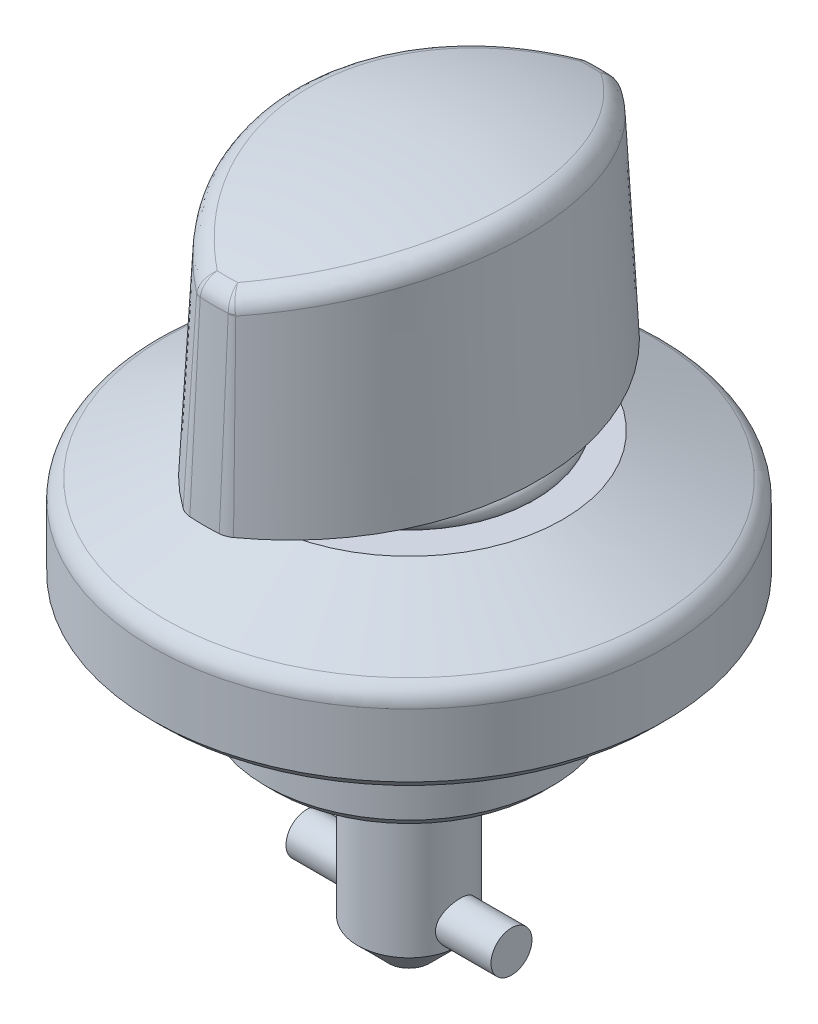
ISO-10303-21;
HEADER;
FILE_DESCRIPTION(('STEP AP214'),'2;1');
FILE_NAME('part.step','',(''),(''),'','','');
FILE_SCHEMA(('AUTOMOTIVE_DESIGN { 1 0 10303 214 1 1 1 1 }'));
ENDSEC;
DATA;
#1=APPLICATION_CONTEXT('core data for automotive mechanical design processes');
#2=APPLICATION_PROTOCOL_DEFINITION('international standard','automotive_design',2000,#1);
#3=PRODUCT_CONTEXT('',#1,'mechanical');
#4=PRODUCT('Part','Part','',(#3));
#5=PRODUCT_RELATED_PRODUCT_CATEGORY('part','',(#4));
#6=PRODUCT_DEFINITION_FORMATION('','',#4);
#7=PRODUCT_DEFINITION_CONTEXT('part definition',#1,'design');
#8=PRODUCT_DEFINITION('design','',#6,#7);
#9=PRODUCT_DEFINITION_SHAPE('','',#8);
#10=(LENGTH_UNIT() NAMED_UNIT(*) SI_UNIT(.MILLI.,.METRE.));
#11=(NAMED_UNIT(*) PLANE_ANGLE_UNIT() SI_UNIT($,.RADIAN.));
#12=(NAMED_UNIT(*) SI_UNIT($,.STERADIAN.) SOLID_ANGLE_UNIT());
#13=UNCERTAINTY_MEASURE_WITH_UNIT(LENGTH_MEASURE(1.E-05),#10,'distance_accuracy_value','');
#14=(GEOMETRIC_REPRESENTATION_CONTEXT(3) GLOBAL_UNCERTAINTY_ASSIGNED_CONTEXT((#13)) GLOBAL_UNIT_ASSIGNED_CONTEXT((#10,
#11,#12)) REPRESENTATION_CONTEXT('',''));
#15=CARTESIAN_POINT('',(0.,0.,0.));
#16=DIRECTION('',(0.,0.,1.));
#17=DIRECTION('',(1.,0.,0.));
#18=AXIS2_PLACEMENT_3D('',#15,#16,#17);
#19=CARTESIAN_POINT('',(0.,-10.,0.));
#20=DIRECTION('',(0.,-1.,0.));
#21=DIRECTION('',(0.,0.,-1.));
#22=AXIS2_PLACEMENT_3D('',#19,#20,#21);
#23=PLANE('',#22);
#24=CARTESIAN_POINT('',(0.,-10.,0.));
#25=DIRECTION('',(0.,-1.,0.));
#26=DIRECTION('',(0.,0.,-1.));
#27=AXIS2_PLACEMENT_3D('',#24,#25,#26);
#28=CIRCLE('',#27,1.);
#29=CARTESIAN_POINT('',(0.,-10.,-1.));
#30=VERTEX_POINT('',#29);
#31=EDGE_CURVE('P0_E41',#30,#30,#28,.T.);
#32=ORIENTED_EDGE('',*,*,#31,.T.);
#33=EDGE_LOOP('',(#32));
#34=FACE_BOUND('',#33,.T.);
#35=ADVANCED_FACE('P0_F16',(#34),#23,.T.);
#36=CARTESIAN_POINT('',(0.,-10.,0.));
#37=DIRECTION('',(0.,1.,0.));
#38=DIRECTION('',(0.,0.,1.));
#39=AXIS2_PLACEMENT_3D('',#36,#37,#38);
#40=CONICAL_SURFACE('',#39,1.,0.78539816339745);
#41=CARTESIAN_POINT('',(0.,-8.50000000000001,0.));
#42=DIRECTION('',(0.,-1.,0.));
#43=DIRECTION('',(0.,0.,-1.));
#44=AXIS2_PLACEMENT_3D('',#41,#42,#43);
#45=CIRCLE('',#44,2.5);
#46=CARTESIAN_POINT('',(2.50000000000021,-8.50000000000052,0.));
#47=VERTEX_POINT('',#46);
#48=CARTESIAN_POINT('',(-2.5,-8.50000000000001,0.));
#49=VERTEX_POINT('',#48);
#50=EDGE_CURVE('P0_E34',#47,#49,#45,.T.);
#51=ORIENTED_EDGE('',*,*,#50,.T.);
#52=EDGE_CURVE('P0_E40',#49,#47,#45,.T.);
#53=ORIENTED_EDGE('',*,*,#52,.T.);
#54=EDGE_LOOP('',(#51,#53));
#55=FACE_BOUND('',#54,.T.);
#56=ORIENTED_EDGE('',*,*,#31,.F.);
#57=EDGE_LOOP('',(#56));
#58=FACE_BOUND('',#57,.T.);
#59=ADVANCED_FACE('P0_F38',(#55,#58),#40,.T.);
#60=CARTESIAN_POINT('',(0.,-10.,0.));
#61=DIRECTION('',(0.,-1.,0.));
#62=DIRECTION('',(0.,0.,-1.));
#63=AXIS2_PLACEMENT_3D('',#60,#61,#62);
#64=CYLINDRICAL_SURFACE('',#63,2.5);
#65=CARTESIAN_POINT('',(0.,0.,0.));
#66=DIRECTION('',(0.,-1.,0.));
#67=DIRECTION('',(0.,0.,-1.));
#68=AXIS2_PLACEMENT_3D('',#65,#66,#67);
#69=CIRCLE('',#68,2.5);
#70=CARTESIAN_POINT('',(0.,0.,-2.5));
#71=VERTEX_POINT('',#70);
#72=EDGE_CURVE('P0_E45',#71,#71,#69,.T.);
#73=ORIENTED_EDGE('',*,*,#72,.T.);
#74=EDGE_LOOP('',(#73));
#75=FACE_BOUND('',#74,.T.);
#76=ORIENTED_EDGE('',*,*,#50,.F.);
#77=CARTESIAN_POINT('',(2.29128784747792,-7.50000000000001,1.));
#78=CARTESIAN_POINT('',(2.29129325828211,-7.55356974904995,0.999994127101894));
#79=CARTESIAN_POINT('',(2.29319301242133,-7.60721526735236,0.995669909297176));
#80=CARTESIAN_POINT('',(2.30055457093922,-7.71296741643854,0.978534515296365));
#81=CARTESIAN_POINT('',(2.30602547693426,-7.76506975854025,0.965701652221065));
#82=CARTESIAN_POINT('',(2.31980227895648,-7.86602647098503,0.932117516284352));
#83=CARTESIAN_POINT('',(2.32809748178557,-7.91489227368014,0.911396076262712));
#84=CARTESIAN_POINT('',(2.3465733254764,-8.00844252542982,0.862710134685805));
#85=CARTESIAN_POINT('',(2.35675355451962,-8.05312788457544,0.83474721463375));
#86=CARTESIAN_POINT('',(2.37850432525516,-8.13963020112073,0.77066098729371));
#87=CARTESIAN_POINT('',(2.39011958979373,-8.18117821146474,0.734189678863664));
#88=CARTESIAN_POINT('',(2.41306228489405,-8.25776449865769,0.654854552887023));
#89=CARTESIAN_POINT('',(2.42438961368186,-8.29280050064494,0.611988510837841));
#90=CARTESIAN_POINT('',(2.44601703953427,-8.35670319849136,0.519003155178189));
#91=CARTESIAN_POINT('',(2.45625901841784,-8.38527215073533,0.468664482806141));
#92=CARTESIAN_POINT('',(2.47401963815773,-8.43342178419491,0.36341266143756));
#93=CARTESIAN_POINT('',(2.48153938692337,-8.45300612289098,0.308501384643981));
#94=CARTESIAN_POINT('',(2.49269162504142,-8.48167074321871,0.198483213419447));
#95=CARTESIAN_POINT('',(2.49649468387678,-8.49121365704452,0.143514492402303));
#96=CARTESIAN_POINT('',(2.50040155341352,-8.50101424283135,0.0326331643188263));
#97=CARTESIAN_POINT('',(2.50050674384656,-8.50127537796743,-0.0232790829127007));
#98=CARTESIAN_POINT('',(2.49710981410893,-8.49275861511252,-0.131116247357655));
#99=CARTESIAN_POINT('',(2.49380998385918,-8.48448761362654,-0.183088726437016));
#100=CARTESIAN_POINT('',(2.48424645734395,-8.46000356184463,-0.284836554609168));
#101=CARTESIAN_POINT('',(2.47798254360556,-8.44378992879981,-0.334611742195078));
#102=CARTESIAN_POINT('',(2.4629841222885,-8.40368175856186,-0.431448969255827));
#103=CARTESIAN_POINT('',(2.454213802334,-8.37967514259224,-0.478458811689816));
#104=CARTESIAN_POINT('',(2.43507292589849,-8.3247674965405,-0.567904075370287));
#105=CARTESIAN_POINT('',(2.42470182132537,-8.2938641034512,-0.610337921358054));
#106=CARTESIAN_POINT('',(2.40260818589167,-8.22367543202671,-0.692384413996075));
#107=CARTESIAN_POINT('',(2.3908416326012,-8.18397305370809,-0.73162892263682));
#108=CARTESIAN_POINT('',(2.36780830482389,-8.09850471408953,-0.803053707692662));
#109=CARTESIAN_POINT('',(2.35654169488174,-8.05273677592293,-0.835231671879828));
#110=CARTESIAN_POINT('',(2.33548448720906,-7.95479048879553,-0.892452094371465));
#111=CARTESIAN_POINT('',(2.3257445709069,-7.9024675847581,-0.917267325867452));
#112=CARTESIAN_POINT('',(2.30943795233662,-7.793892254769,-0.957588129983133));
#113=CARTESIAN_POINT('',(2.3028691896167,-7.73764240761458,-0.973099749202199));
#114=CARTESIAN_POINT('',(2.29414879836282,-7.62648211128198,-0.993477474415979));
#115=CARTESIAN_POINT('',(2.29175183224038,-7.57169977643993,-0.998936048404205));
#116=CARTESIAN_POINT('',(2.29094748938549,-7.46196139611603,-1.00078066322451));
#117=CARTESIAN_POINT('',(2.29253890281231,-7.40700540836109,-0.997169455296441));
#118=CARTESIAN_POINT('',(2.29928022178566,-7.30177053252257,-0.981516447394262));
#119=CARTESIAN_POINT('',(2.30422228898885,-7.25140353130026,-0.969966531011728));
#120=CARTESIAN_POINT('',(2.31685025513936,-7.153355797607,-0.939402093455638));
#121=CARTESIAN_POINT('',(2.32453676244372,-7.10567566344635,-0.920385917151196));
#122=CARTESIAN_POINT('',(2.34216890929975,-7.01219882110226,-0.874567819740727));
#123=CARTESIAN_POINT('',(2.35219352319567,-6.96655690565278,-0.847481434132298));
#124=CARTESIAN_POINT('',(2.37325192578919,-6.88025850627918,-0.786582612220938));
#125=CARTESIAN_POINT('',(2.38428612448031,-6.83960406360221,-0.752767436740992));
#126=CARTESIAN_POINT('',(2.40710457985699,-6.7613132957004,-0.676422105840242));
#127=CARTESIAN_POINT('',(2.41888403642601,-6.72412171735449,-0.63343271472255));
#128=CARTESIAN_POINT('',(2.44109897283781,-6.65741146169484,-0.541541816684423));
#129=CARTESIAN_POINT('',(2.4515343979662,-6.62789309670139,-0.492640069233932));
#130=CARTESIAN_POINT('',(2.46991857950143,-6.57747618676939,-0.390139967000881));
#131=CARTESIAN_POINT('',(2.47786793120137,-6.55657557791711,-0.336542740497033));
#132=CARTESIAN_POINT('',(2.49036356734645,-6.52422557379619,-0.226196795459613));
#133=CARTESIAN_POINT('',(2.49491169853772,-6.51277104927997,-0.169449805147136));
#134=CARTESIAN_POINT('',(2.49989504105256,-6.50024764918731,-0.0584082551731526));
#135=CARTESIAN_POINT('',(2.50057923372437,-6.49854993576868,-0.00419524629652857));
#136=CARTESIAN_POINT('',(2.49843021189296,-6.50392773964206,0.103716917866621));
#137=CARTESIAN_POINT('',(2.49559752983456,-6.51100192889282,0.15741614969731));
#138=CARTESIAN_POINT('',(2.48685756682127,-6.53327339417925,0.261085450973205));
#139=CARTESIAN_POINT('',(2.48104740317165,-6.54821447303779,0.311119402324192));
#140=CARTESIAN_POINT('',(2.46697473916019,-6.58552640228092,0.407961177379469));
#141=CARTESIAN_POINT('',(2.45871178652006,-6.60789862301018,0.454768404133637));
#142=CARTESIAN_POINT('',(2.44009047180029,-6.66055159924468,0.546101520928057));
#143=CARTESIAN_POINT('',(2.42965564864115,-6.69113814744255,0.590435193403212));
#144=CARTESIAN_POINT('',(2.40794701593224,-6.75889425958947,0.673527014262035));
#145=CARTESIAN_POINT('',(2.3966728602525,-6.79606654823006,0.712282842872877));
#146=CARTESIAN_POINT('',(2.37368881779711,-6.87865761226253,0.785600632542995));
#147=CARTESIAN_POINT('',(2.36199516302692,-6.92444443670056,0.819754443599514));
#148=CARTESIAN_POINT('',(2.3402483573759,-7.02147106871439,0.879923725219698));
#149=CARTESIAN_POINT('',(2.33019539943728,-7.07271151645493,0.905938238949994));
#150=CARTESIAN_POINT('',(2.31379432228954,-7.17451860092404,0.946995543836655));
#151=CARTESIAN_POINT('',(2.30719459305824,-7.22473261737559,0.962813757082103));
#152=CARTESIAN_POINT('',(2.29723001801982,-7.32724270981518,0.986358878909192));
#153=CARTESIAN_POINT('',(2.29385616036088,-7.37953255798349,0.994108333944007));
#154=CARTESIAN_POINT('',(2.29162229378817,-7.45468878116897,0.999232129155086));
#155=CARTESIAN_POINT('',(2.29128555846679,-7.47733761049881,1.00000248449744));
#156=CARTESIAN_POINT('',(2.29128784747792,-7.50000000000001,1.));
#157=B_SPLINE_CURVE_WITH_KNOTS('',3,(#77,#78,#79,#80,#81,#82,#83,#84,#85,#86,#87,#88,#89,#90,
#91,#92,#93,#94,#95,#96,#97,#98,#99,#100,#101,#102,#103,#104,#105,#106,#107,#108,#109,#110,#111,
#112,#113,#114,#115,#116,#117,#118,#119,#120,#121,#122,#123,#124,#125,#126,#127,#128,#129,#130,
#131,#132,#133,#134,#135,#136,#137,#138,#139,#140,#141,#142,#143,#144,#145,#146,#147,#148,#149,
#150,#151,#152,#153,#154,#155,#156),.UNSPECIFIED.,.T.,.F.,(4,2,2,2,2,2,2,2,2,2,2,2,2,2,2,2,2,2,
2,2,2,2,2,2,2,2,2,2,2,2,2,2,2,2,2,2,2,2,2,4),(0.,0.160638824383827,0.321688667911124,
0.482135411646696,0.642547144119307,0.811278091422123,0.980067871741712,1.15551334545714,
1.3308873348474,1.49777091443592,1.66459222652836,1.82204322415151,1.9795057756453,
2.13934150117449,2.29923207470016,2.46962022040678,2.64006403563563,2.81532229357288,
2.99046652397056,3.15491073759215,3.31930507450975,3.47433624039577,3.62940179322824,
3.79075577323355,3.95217557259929,4.12551867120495,4.29886882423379,4.47217743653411,
4.64539187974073,4.80730519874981,4.96919400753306,5.12610997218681,5.28305488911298,
5.44693525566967,5.61088358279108,5.78498126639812,5.95909940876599,6.11758330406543,
6.27562315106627,6.34358052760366),.UNSPECIFIED.);
#158=EDGE_CURVE('P0_E11',#47,#47,#157,.T.);
#159=ORIENTED_EDGE('',*,*,#158,.F.);
#160=ORIENTED_EDGE('',*,*,#52,.F.);
#161=CARTESIAN_POINT('',(-2.29128784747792,-7.50000000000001,1.));
#162=CARTESIAN_POINT('',(-2.29129325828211,-7.44643025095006,0.999994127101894));
#163=CARTESIAN_POINT('',(-2.29319301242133,-7.39278473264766,0.995669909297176));
#164=CARTESIAN_POINT('',(-2.30055457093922,-7.28703258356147,0.978534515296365));
#165=CARTESIAN_POINT('',(-2.30602547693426,-7.23493024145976,0.965701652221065));
#166=CARTESIAN_POINT('',(-2.31980227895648,-7.13397352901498,0.932117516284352));
#167=CARTESIAN_POINT('',(-2.32809748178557,-7.08510772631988,0.911396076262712));
#168=CARTESIAN_POINT('',(-2.3465733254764,-6.9915574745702,0.862710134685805));
#169=CARTESIAN_POINT('',(-2.35675355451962,-6.94687211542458,0.83474721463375));
#170=CARTESIAN_POINT('',(-2.37850432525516,-6.86036979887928,0.77066098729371));
#171=CARTESIAN_POINT('',(-2.39011958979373,-6.81882178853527,0.734189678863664));
#172=CARTESIAN_POINT('',(-2.41306228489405,-6.74223550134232,0.654854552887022));
#173=CARTESIAN_POINT('',(-2.42438961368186,-6.70719949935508,0.61198851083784));
#174=CARTESIAN_POINT('',(-2.44601703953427,-6.64329680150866,0.519003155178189));
#175=CARTESIAN_POINT('',(-2.45625901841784,-6.61472784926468,0.468664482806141));
#176=CARTESIAN_POINT('',(-2.47401963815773,-6.5665782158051,0.36341266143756));
#177=CARTESIAN_POINT('',(-2.48153938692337,-6.54699387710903,0.308501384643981));
#178=CARTESIAN_POINT('',(-2.49269162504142,-6.51832925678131,0.198483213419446));
#179=CARTESIAN_POINT('',(-2.49649468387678,-6.5087863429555,0.143514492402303));
#180=CARTESIAN_POINT('',(-2.50040155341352,-6.49898575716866,0.0326331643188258));
#181=CARTESIAN_POINT('',(-2.50050674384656,-6.49872462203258,-0.0232790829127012));
#182=CARTESIAN_POINT('',(-2.49710981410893,-6.5072413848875,-0.131116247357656));
#183=CARTESIAN_POINT('',(-2.49380998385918,-6.51551238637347,-0.183088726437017));
#184=CARTESIAN_POINT('',(-2.48424645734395,-6.53999643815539,-0.284836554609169));
#185=CARTESIAN_POINT('',(-2.47798254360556,-6.5562100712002,-0.334611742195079));
#186=CARTESIAN_POINT('',(-2.4629841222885,-6.59631824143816,-0.431448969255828));
#187=CARTESIAN_POINT('',(-2.454213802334,-6.62032485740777,-0.478458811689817));
#188=CARTESIAN_POINT('',(-2.43507292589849,-6.67523250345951,-0.567904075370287));
#189=CARTESIAN_POINT('',(-2.42470182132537,-6.70613589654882,-0.610337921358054));
#190=CARTESIAN_POINT('',(-2.40260818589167,-6.7763245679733,-0.692384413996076));
#191=CARTESIAN_POINT('',(-2.3908416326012,-6.81602694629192,-0.731628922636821));
#192=CARTESIAN_POINT('',(-2.36780830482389,-6.90149528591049,-0.803053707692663));
#193=CARTESIAN_POINT('',(-2.35654169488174,-6.94726322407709,-0.835231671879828));
#194=CARTESIAN_POINT('',(-2.33548448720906,-7.04520951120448,-0.892452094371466));
#195=CARTESIAN_POINT('',(-2.3257445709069,-7.09753241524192,-0.917267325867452));
#196=CARTESIAN_POINT('',(-2.30943795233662,-7.20610774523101,-0.957588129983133));
#197=CARTESIAN_POINT('',(-2.3028691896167,-7.26235759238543,-0.973099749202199));
#198=CARTESIAN_POINT('',(-2.29414879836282,-7.37351788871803,-0.993477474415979));
#199=CARTESIAN_POINT('',(-2.29175183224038,-7.42830022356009,-0.998936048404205));
#200=CARTESIAN_POINT('',(-2.29094748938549,-7.53803860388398,-1.00078066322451));
#201=CARTESIAN_POINT('',(-2.29253890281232,-7.59299459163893,-0.997169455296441));
#202=CARTESIAN_POINT('',(-2.29928022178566,-7.69822946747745,-0.981516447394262));
#203=CARTESIAN_POINT('',(-2.30422228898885,-7.74859646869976,-0.969966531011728));
#204=CARTESIAN_POINT('',(-2.31685025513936,-7.84664420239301,-0.939402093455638));
#205=CARTESIAN_POINT('',(-2.32453676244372,-7.89432433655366,-0.920385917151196));
#206=CARTESIAN_POINT('',(-2.34216890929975,-7.98780117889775,-0.874567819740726));
#207=CARTESIAN_POINT('',(-2.35219352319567,-8.03344309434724,-0.847481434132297));
#208=CARTESIAN_POINT('',(-2.37325192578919,-8.11974149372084,-0.786582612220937));
#209=CARTESIAN_POINT('',(-2.38428612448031,-8.1603959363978,-0.752767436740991));
#210=CARTESIAN_POINT('',(-2.40710457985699,-8.23868670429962,-0.676422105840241));
#211=CARTESIAN_POINT('',(-2.41888403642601,-8.27587828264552,-0.633432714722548));
#212=CARTESIAN_POINT('',(-2.44109897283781,-8.34258853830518,-0.54154181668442));
#213=CARTESIAN_POINT('',(-2.4515343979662,-8.37210690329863,-0.492640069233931));
#214=CARTESIAN_POINT('',(-2.46991857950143,-8.42252381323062,-0.39013996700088));
#215=CARTESIAN_POINT('',(-2.47786793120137,-8.4434244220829,-0.336542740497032));
#216=CARTESIAN_POINT('',(-2.49036356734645,-8.47577442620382,-0.226196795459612));
#217=CARTESIAN_POINT('',(-2.49491169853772,-8.48722895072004,-0.169449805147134));
#218=CARTESIAN_POINT('',(-2.49989504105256,-8.4997523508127,-0.0584082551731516));
#219=CARTESIAN_POINT('',(-2.50057923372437,-8.50145006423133,-0.00419524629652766));
#220=CARTESIAN_POINT('',(-2.49843021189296,-8.49607226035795,0.103716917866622));
#221=CARTESIAN_POINT('',(-2.49559752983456,-8.4889980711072,0.157416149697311));
#222=CARTESIAN_POINT('',(-2.48685756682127,-8.46672660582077,0.261085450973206));
#223=CARTESIAN_POINT('',(-2.48104740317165,-8.45178552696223,0.311119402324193));
#224=CARTESIAN_POINT('',(-2.46697473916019,-8.41447359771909,0.40796117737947));
#225=CARTESIAN_POINT('',(-2.45871178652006,-8.39210137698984,0.454768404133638));
#226=CARTESIAN_POINT('',(-2.44009047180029,-8.33944840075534,0.546101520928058));
#227=CARTESIAN_POINT('',(-2.42965564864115,-8.30886185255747,0.590435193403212));
#228=CARTESIAN_POINT('',(-2.40794701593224,-8.24110574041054,0.673527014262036));
#229=CARTESIAN_POINT('',(-2.3966728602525,-8.20393345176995,0.712282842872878));
#230=CARTESIAN_POINT('',(-2.37368881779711,-8.12134238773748,0.785600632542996));
#231=CARTESIAN_POINT('',(-2.36199516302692,-8.07555556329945,0.819754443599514));
#232=CARTESIAN_POINT('',(-2.3402483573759,-7.97852893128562,0.879923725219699));
#233=CARTESIAN_POINT('',(-2.33019539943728,-7.92728848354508,0.905938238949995));
#234=CARTESIAN_POINT('',(-2.31379432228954,-7.82548139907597,0.946995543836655));
#235=CARTESIAN_POINT('',(-2.30719459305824,-7.77526738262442,0.962813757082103));
#236=CARTESIAN_POINT('',(-2.29723001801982,-7.67275729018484,0.986358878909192));
#237=CARTESIAN_POINT('',(-2.29385616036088,-7.62046744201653,0.994108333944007));
#238=CARTESIAN_POINT('',(-2.29162229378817,-7.54531121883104,0.999232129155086));
#239=CARTESIAN_POINT('',(-2.29128555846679,-7.52266238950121,1.00000248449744));
#240=CARTESIAN_POINT('',(-2.29128784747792,-7.50000000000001,1.));
#241=B_SPLINE_CURVE_WITH_KNOTS('',3,(#161,#162,#163,#164,#165,#166,#167,#168,#169,#170,#171,
#172,#173,#174,#175,#176,#177,#178,#179,#180,#181,#182,#183,#184,#185,#186,#187,#188,#189,#190,
#191,#192,#193,#194,#195,#196,#197,#198,#199,#200,#201,#202,#203,#204,#205,#206,#207,#208,#209,
#210,#211,#212,#213,#214,#215,#216,#217,#218,#219,#220,#221,#222,#223,#224,#225,#226,#227,#228,
#229,#230,#231,#232,#233,#234,#235,#236,#237,#238,#239,#240),.UNSPECIFIED.,.T.,.F.,(4,2,2,2,2,2,
2,2,2,2,2,2,2,2,2,2,2,2,2,2,2,2,2,2,2,2,2,2,2,2,2,2,2,2,2,2,2,2,2,4),(0.,0.160638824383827,
0.321688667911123,0.482135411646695,0.642547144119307,0.811278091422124,0.980067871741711,
1.15551334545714,1.3308873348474,1.49777091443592,1.66459222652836,1.82204322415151,
1.9795057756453,2.13934150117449,2.29923207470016,2.46962022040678,2.64006403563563,
2.81532229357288,2.99046652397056,3.15491073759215,3.31930507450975,3.47433624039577,
3.62940179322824,3.79075577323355,3.9521755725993,4.12551867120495,4.29886882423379,
4.47217743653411,4.64539187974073,4.80730519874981,4.96919400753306,5.12610997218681,
5.28305488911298,5.44693525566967,5.61088358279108,5.78498126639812,5.95909940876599,
6.11758330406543,6.27562315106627,6.34358052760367),.UNSPECIFIED.);
#242=EDGE_CURVE('P0_E27',#49,#49,#241,.T.);
#243=ORIENTED_EDGE('',*,*,#242,.F.);
#244=EDGE_LOOP('',(#76,#159,#160,#243));
#245=FACE_BOUND('',#244,.T.);
#246=ADVANCED_FACE('P0_F43',(#75,#245),#64,.T.);
#247=CARTESIAN_POINT('',(2.5,0.,0.));
#248=DIRECTION('',(0.,1.,0.));
#249=DIRECTION('',(0.,0.,1.));
#250=AXIS2_PLACEMENT_3D('',#247,#248,#249);
#251=PLANE('',#250);
#252=CARTESIAN_POINT('',(0.,0.,0.));
#253=DIRECTION('',(0.,-1.,0.));
#254=DIRECTION('',(0.,0.,-1.));
#255=AXIS2_PLACEMENT_3D('',#252,#253,#254);
#256=CIRCLE('',#255,2.);
#257=CARTESIAN_POINT('',(0.,0.,-2.));
#258=VERTEX_POINT('',#257);
#259=EDGE_CURVE('P0_E47',#258,#258,#256,.T.);
#260=ORIENTED_EDGE('',*,*,#259,.T.);
#261=EDGE_LOOP('',(#260));
#262=FACE_BOUND('',#261,.T.);
#263=ORIENTED_EDGE('',*,*,#72,.F.);
#264=EDGE_LOOP('',(#263));
#265=FACE_BOUND('',#264,.T.);
#266=ADVANCED_FACE('P0_F79',(#262,#265),#251,.T.);
#267=CARTESIAN_POINT('',(0.,-10.,0.));
#268=DIRECTION('',(0.,-1.,0.));
#269=DIRECTION('',(0.,0.,-1.));
#270=AXIS2_PLACEMENT_3D('',#267,#268,#269);
#271=CYLINDRICAL_SURFACE('',#270,2.);
#272=CARTESIAN_POINT('',(0.,17.5,0.));
#273=DIRECTION('',(0.,-1.,0.));
#274=DIRECTION('',(0.,0.,-1.));
#275=AXIS2_PLACEMENT_3D('',#272,#273,#274);
#276=CIRCLE('',#275,2.);
#277=CARTESIAN_POINT('',(0.,17.5,-2.));
#278=VERTEX_POINT('',#277);
#279=EDGE_CURVE('P0_E155',#278,#278,#276,.T.);
#280=ORIENTED_EDGE('',*,*,#279,.T.);
#281=EDGE_LOOP('',(#280));
#282=FACE_BOUND('',#281,.T.);
#283=ORIENTED_EDGE('',*,*,#259,.F.);
#284=EDGE_LOOP('',(#283));
#285=FACE_BOUND('',#284,.T.);
#286=ADVANCED_FACE('P0_F76',(#282,#285),#271,.T.);
#287=CARTESIAN_POINT('',(0.,17.5,0.));
#288=DIRECTION('',(0.,-1.,0.));
#289=DIRECTION('',(0.,0.,-1.));
#290=AXIS2_PLACEMENT_3D('',#287,#288,#289);
#291=CONICAL_SURFACE('',#290,2.,0.785398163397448);
#292=CARTESIAN_POINT('',(0.,18.,0.));
#293=DIRECTION('',(0.,-1.,0.));
#294=DIRECTION('',(0.,0.,-1.));
#295=AXIS2_PLACEMENT_3D('',#292,#293,#294);
#296=CIRCLE('',#295,1.5);
#297=CARTESIAN_POINT('',(0.,18.,-1.5));
#298=VERTEX_POINT('',#297);
#299=EDGE_CURVE('P0_E150',#298,#298,#296,.T.);
#300=ORIENTED_EDGE('',*,*,#299,.T.);
#301=EDGE_LOOP('',(#300));
#302=FACE_BOUND('',#301,.T.);
#303=ORIENTED_EDGE('',*,*,#279,.F.);
#304=EDGE_LOOP('',(#303));
#305=FACE_BOUND('',#304,.T.);
#306=ADVANCED_FACE('P0_F72',(#302,#305),#291,.T.);
#307=CARTESIAN_POINT('',(1.5,18.,0.));
#308=DIRECTION('',(0.,1.,0.));
#309=DIRECTION('',(0.,0.,1.));
#310=AXIS2_PLACEMENT_3D('',#307,#308,#309);
#311=PLANE('',#310);
#312=ORIENTED_EDGE('',*,*,#299,.F.);
#313=EDGE_LOOP('',(#312));
#314=FACE_BOUND('',#313,.T.);
#315=ADVANCED_FACE('P0_F68',(#314),#311,.T.);
#316=CARTESIAN_POINT('',(-5.,-7.50000000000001,0.));
#317=DIRECTION('',(-1.,0.,0.));
#318=DIRECTION('',(0.,0.,1.));
#319=AXIS2_PLACEMENT_3D('',#316,#317,#318);
#320=PLANE('',#319);
#321=CARTESIAN_POINT('',(-5.,-7.50000000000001,0.));
#322=DIRECTION('',(-1.,0.,0.));
#323=DIRECTION('',(0.,0.,1.));
#324=AXIS2_PLACEMENT_3D('',#321,#322,#323);
#325=CIRCLE('',#324,1.);
#326=CARTESIAN_POINT('',(-5.,-7.50000000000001,1.));
#327=VERTEX_POINT('',#326);
#328=EDGE_CURVE('P0_E147',#327,#327,#325,.T.);
#329=ORIENTED_EDGE('',*,*,#328,.T.);
#330=EDGE_LOOP('',(#329));
#331=FACE_BOUND('',#330,.T.);
#332=ADVANCED_FACE('P0_F62',(#331),#320,.T.);
#333=CARTESIAN_POINT('',(-5.26029262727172,-7.50000000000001,0.));
#334=DIRECTION('',(-1.,0.,0.));
#335=DIRECTION('',(0.,0.,1.));
#336=AXIS2_PLACEMENT_3D('',#333,#334,#335);
#337=CYLINDRICAL_SURFACE('',#336,1.);
#338=ORIENTED_EDGE('',*,*,#242,.T.);
#339=EDGE_LOOP('',(#338));
#340=FACE_BOUND('',#339,.T.);
#341=ORIENTED_EDGE('',*,*,#328,.F.);
#342=EDGE_LOOP('',(#341));
#343=FACE_BOUND('',#342,.T.);
#344=ADVANCED_FACE('P0_F56',(#340,#343),#337,.T.);
#345=ORIENTED_EDGE('',*,*,#158,.T.);
#346=EDGE_LOOP('',(#345));
#347=FACE_BOUND('',#346,.T.);
#348=CARTESIAN_POINT('',(5.,-7.50000000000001,0.));
#349=DIRECTION('',(-1.,0.,0.));
#350=DIRECTION('',(0.,0.,1.));
#351=AXIS2_PLACEMENT_3D('',#348,#349,#350);
#352=CIRCLE('',#351,1.);
#353=CARTESIAN_POINT('',(5.,-7.50000000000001,1.));
#354=VERTEX_POINT('',#353);
#355=EDGE_CURVE('P0_E145',#354,#354,#352,.T.);
#356=ORIENTED_EDGE('',*,*,#355,.T.);
#357=EDGE_LOOP('',(#356));
#358=FACE_BOUND('',#357,.T.);
#359=ADVANCED_FACE('P0_F61',(#347,#358),#337,.T.);
#360=CARTESIAN_POINT('',(5.,-8.50000000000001,0.));
#361=DIRECTION('',(1.,0.,0.));
#362=DIRECTION('',(0.,0.,-1.));
#363=AXIS2_PLACEMENT_3D('',#360,#361,#362);
#364=PLANE('',#363);
#365=ORIENTED_EDGE('',*,*,#355,.F.);
#366=EDGE_LOOP('',(#365));
#367=FACE_BOUND('',#366,.T.);
#368=ADVANCED_FACE('P0_F64',(#367),#364,.T.);
#369=CLOSED_SHELL('',(#35,#59,#246,#266,#286,#306,#315,#332,#344,#359,#368));
#370=MANIFOLD_SOLID_BREP('P0_B1',#369);
#371=CARTESIAN_POINT('',(10.,13.,0.));
#372=DIRECTION('',(0.,-1.,0.));
#373=DIRECTION('',(0.,0.,-1.));
#374=AXIS2_PLACEMENT_3D('',#371,#372,#373);
#375=PLANE('',#374);
#376=CARTESIAN_POINT('',(0.,13.,0.));
#377=DIRECTION('',(0.,-1.,0.));
#378=DIRECTION('',(0.,0.,-1.));
#379=AXIS2_PLACEMENT_3D('',#376,#377,#378);
#380=CIRCLE('',#379,2.);
#381=CARTESIAN_POINT('',(0.,13.,-2.));
#382=VERTEX_POINT('',#381);
#383=EDGE_CURVE('P1_E678',#382,#382,#380,.T.);
#384=ORIENTED_EDGE('',*,*,#383,.F.);
#385=EDGE_LOOP('',(#384));
#386=FACE_BOUND('',#385,.T.);
#387=CARTESIAN_POINT('',(-5.80357142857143,13.,0.));
#388=DIRECTION('',(0.,-1.,0.));
#389=DIRECTION('',(0.,0.,1.));
#390=AXIS2_PLACEMENT_3D('',#387,#388,#389);
#391=CIRCLE('',#390,12.0535714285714);
#392=CARTESIAN_POINT('',(1.22965080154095,13.,-9.78889009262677));
#393=VERTEX_POINT('',#392);
#394=CARTESIAN_POINT('',(1.22965080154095,13.,9.78889009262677));
#395=VERTEX_POINT('',#394);
#396=EDGE_CURVE('P1_E758',#393,#395,#391,.T.);
#397=ORIENTED_EDGE('',*,*,#396,.T.);
#398=CARTESIAN_POINT('',(0.646153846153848,13.,8.97677476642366));
#399=DIRECTION('',(0.,-1.,0.));
#400=DIRECTION('',(0.,0.,-1.));
#401=AXIS2_PLACEMENT_3D('',#398,#399,#400);
#402=CIRCLE('',#401,1.);
#403=CARTESIAN_POINT('',(0.71794871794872,13.,9.97419418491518));
#404=VERTEX_POINT('',#403);
#405=EDGE_CURVE('P1_E76',#395,#404,#402,.T.);
#406=ORIENTED_EDGE('',*,*,#405,.T.);
#407=CARTESIAN_POINT('',(0.,13.,0.));
#408=DIRECTION('',(0.,-1.,0.));
#409=DIRECTION('',(0.,0.,-1.));
#410=AXIS2_PLACEMENT_3D('',#407,#408,#409);
#411=CIRCLE('',#410,10.);
#412=CARTESIAN_POINT('',(-0.71794871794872,13.,9.97419418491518));
#413=VERTEX_POINT('',#412);
#414=EDGE_CURVE('P1_E691',#404,#413,#411,.T.);
#415=ORIENTED_EDGE('',*,*,#414,.T.);
#416=CARTESIAN_POINT('',(-0.646153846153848,13.,8.97677476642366));
#417=DIRECTION('',(0.,-1.,0.));
#418=DIRECTION('',(0.,0.,-1.));
#419=AXIS2_PLACEMENT_3D('',#416,#417,#418);
#420=CIRCLE('',#419,1.);
#421=CARTESIAN_POINT('',(-1.22965080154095,13.,9.78889009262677));
#422=VERTEX_POINT('',#421);
#423=EDGE_CURVE('P1_E686',#413,#422,#420,.T.);
#424=ORIENTED_EDGE('',*,*,#423,.T.);
#425=CARTESIAN_POINT('',(5.80357142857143,13.,0.));
#426=DIRECTION('',(0.,-1.,0.));
#427=DIRECTION('',(0.,0.,-1.));
#428=AXIS2_PLACEMENT_3D('',#425,#426,#427);
#429=CIRCLE('',#428,12.0535714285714);
#430=CARTESIAN_POINT('',(-1.22965080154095,13.,-9.78889009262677));
#431=VERTEX_POINT('',#430);
#432=EDGE_CURVE('P1_E697',#422,#431,#429,.T.);
#433=ORIENTED_EDGE('',*,*,#432,.T.);
#434=CARTESIAN_POINT('',(-0.646153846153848,13.,-8.97677476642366));
#435=DIRECTION('',(0.,-1.,0.));
#436=DIRECTION('',(0.,0.,-1.));
#437=AXIS2_PLACEMENT_3D('',#434,#435,#436);
#438=CIRCLE('',#437,1.);
#439=CARTESIAN_POINT('',(-0.71794871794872,13.,-9.97419418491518));
#440=VERTEX_POINT('',#439);
#441=EDGE_CURVE('P1_E705',#431,#440,#438,.T.);
#442=ORIENTED_EDGE('',*,*,#441,.T.);
#443=CARTESIAN_POINT('',(0.71794871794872,13.,-9.97419418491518));
#444=VERTEX_POINT('',#443);
#445=EDGE_CURVE('P1_E603',#440,#444,#411,.T.);
#446=ORIENTED_EDGE('',*,*,#445,.T.);
#447=CARTESIAN_POINT('',(0.646153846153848,13.,-8.97677476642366));
#448=DIRECTION('',(0.,-1.,0.));
#449=DIRECTION('',(0.,0.,-1.));
#450=AXIS2_PLACEMENT_3D('',#447,#448,#449);
#451=CIRCLE('',#450,1.);
#452=EDGE_CURVE('P1_E689',#444,#393,#451,.T.);
#453=ORIENTED_EDGE('',*,*,#452,.T.);
#454=EDGE_LOOP('',(#397,#406,#415,#424,#433,#442,#446,#453));
#455=FACE_BOUND('',#454,.T.);
#456=ADVANCED_FACE('P1_F16',(#386,#455),#375,.T.);
#457=CARTESIAN_POINT('',(0.,-1.49999999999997,0.));
#458=DIRECTION('',(0.,-1.,0.));
#459=DIRECTION('',(1.,0.,0.));
#460=AXIS2_PLACEMENT_3D('',#457,#458,#459);
#461=SPHERICAL_SURFACE('',#460,26.);
#462=CARTESIAN_POINT('',(-2.63853182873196,21.1793535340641,11.1857520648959));
#463=CARTESIAN_POINT('',(-2.80005711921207,21.8066536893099,11.1972899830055));
#464=CARTESIAN_POINT('',(-3.02683917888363,22.032098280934,10.6338419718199));
#465=CARTESIAN_POINT('',(-2.31827094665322,21.2563128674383,11.0909770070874));
#466=CARTESIAN_POINT('',(-2.47824417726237,21.8890817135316,11.1065173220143));
#467=CARTESIAN_POINT('',(-2.72247797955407,22.1121359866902,10.5433962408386));
#468=CARTESIAN_POINT('',(-2.00171769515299,21.3319649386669,10.982296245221));
#469=CARTESIAN_POINT('',(-2.16055987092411,21.9700008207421,11.001899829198));
#470=CARTESIAN_POINT('',(-2.42167016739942,22.1908141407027,10.439745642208));
#471=CARTESIAN_POINT('',(-1.37828463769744,21.4802150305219,10.73782658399));
#472=CARTESIAN_POINT('',(-1.5340786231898,22.1287720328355,10.7653199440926));
#473=CARTESIAN_POINT('',(-1.82930082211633,22.3449942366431,10.2067108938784));
#474=CARTESIAN_POINT('',(-1.07140624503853,21.5528126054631,10.6020337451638));
#475=CARTESIAN_POINT('',(-1.22535539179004,22.2066016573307,10.6332421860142));
#476=CARTESIAN_POINT('',(-1.53774063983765,22.4204957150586,10.0773230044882));
#477=CARTESIAN_POINT('',(-0.469623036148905,21.694503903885,10.304045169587));
#478=CARTESIAN_POINT('',(-0.619155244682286,22.3586972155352,10.3423199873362));
#479=CARTESIAN_POINT('',(-0.966045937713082,22.5678546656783,9.79349178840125));
#480=CARTESIAN_POINT('',(-0.174720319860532,21.7635970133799,10.1418448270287));
#481=CARTESIAN_POINT('',(-0.321772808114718,22.4329360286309,10.1833728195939));
#482=CARTESIAN_POINT('',(-0.685913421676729,22.6397114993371,9.63904409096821));
#483=CARTESIAN_POINT('',(0.400757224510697,21.8978328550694,9.79204482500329));
#484=CARTESIAN_POINT('',(0.259331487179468,22.5773570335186,9.83957694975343));
#485=CARTESIAN_POINT('',(-0.139303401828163,22.7793167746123,9.30605338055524));
#486=CARTESIAN_POINT('',(0.681333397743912,21.9629759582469,9.60444755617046));
#487=CARTESIAN_POINT('',(0.542944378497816,22.6475093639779,9.65464992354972));
#488=CARTESIAN_POINT('',(0.127175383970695,22.8470656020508,9.12751263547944));
#489=CARTESIAN_POINT('',(1.21459777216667,22.0862828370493,9.21334616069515));
#490=CARTESIAN_POINT('',(1.08267282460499,22.7804612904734,9.26819901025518));
#491=CARTESIAN_POINT('',(0.633607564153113,22.9753047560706,8.75537156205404));
#492=CARTESIAN_POINT('',(1.46796088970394,22.144624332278,9.01083071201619));
#493=CARTESIAN_POINT('',(1.3393727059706,22.8434263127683,9.06760273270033));
#494=CARTESIAN_POINT('',(0.874203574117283,23.035979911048,8.56270887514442));
#495=CARTESIAN_POINT('',(1.95769251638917,22.2569890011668,8.58468443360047));
#496=CARTESIAN_POINT('',(1.83620195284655,22.9648477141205,8.64462535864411));
#497=CARTESIAN_POINT('',(1.33922588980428,23.1528391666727,8.15736312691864));
#498=CARTESIAN_POINT('',(2.19405537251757,22.3110107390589,8.36104663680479));
#499=CARTESIAN_POINT('',(2.07620442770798,23.0232712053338,8.42220551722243));
#500=CARTESIAN_POINT('',(1.5636468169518,23.2090217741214,7.94467345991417));
#501=CARTESIAN_POINT('',(2.64766029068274,22.414346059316,7.89432622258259));
#502=CARTESIAN_POINT('',(2.53738665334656,23.1351643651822,7.95717701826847));
#503=CARTESIAN_POINT('',(1.99430732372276,23.3164905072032,7.50086297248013));
#504=CARTESIAN_POINT('',(2.8649195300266,22.4636638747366,7.65126145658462));
#505=CARTESIAN_POINT('',(2.75845641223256,23.1886063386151,7.71457718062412));
#506=CARTESIAN_POINT('',(2.20056323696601,23.3677810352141,7.26975907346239));
#507=CARTESIAN_POINT('',(3.27891496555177,22.5573670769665,7.14699652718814));
#508=CARTESIAN_POINT('',(3.18024100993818,23.2902676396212,7.21044887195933));
#509=CARTESIAN_POINT('',(2.59356962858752,23.465232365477,6.79036416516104));
#510=CARTESIAN_POINT('',(3.4756438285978,22.6017507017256,6.88578993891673));
#511=CARTESIAN_POINT('',(3.38081783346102,23.3384525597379,6.94892929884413));
#512=CARTESIAN_POINT('',(2.78031313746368,23.5113913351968,6.54206706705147));
#513=CARTESIAN_POINT('',(3.84706540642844,22.6853322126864,6.34682386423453));
#514=CARTESIAN_POINT('',(3.75996017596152,23.4292975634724,6.40851919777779));
#515=CARTESIAN_POINT('',(3.13286524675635,23.5983161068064,6.02978806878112));
#516=CARTESIAN_POINT('',(4.0217375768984,22.7245252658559,6.06904929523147));
#517=CARTESIAN_POINT('',(3.93837538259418,23.4719206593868,6.12965401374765));
#518=CARTESIAN_POINT('',(3.29865432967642,23.639076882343,5.76579187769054));
#519=CARTESIAN_POINT('',(4.3474407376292,22.7974466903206,5.49898768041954));
#520=CARTESIAN_POINT('',(4.27143579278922,23.5513106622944,5.55659895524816));
#521=CARTESIAN_POINT('',(3.60778059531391,23.7149151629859,5.22405078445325));
#522=CARTESIAN_POINT('',(4.49846288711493,22.8311730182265,5.20669526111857));
#523=CARTESIAN_POINT('',(4.42594869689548,23.5880454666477,5.26246913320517));
#524=CARTESIAN_POINT('',(3.75110938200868,23.7499905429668,4.94630079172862));
#525=CARTESIAN_POINT('',(4.77547824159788,22.8929240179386,4.6098354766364));
#526=CARTESIAN_POINT('',(4.70966436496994,23.6553729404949,4.66116141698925));
#527=CARTESIAN_POINT('',(4.01400384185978,23.8142115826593,4.37917399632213));
#528=CARTESIAN_POINT('',(4.90147605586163,22.9209497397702,4.30527038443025));
#529=CARTESIAN_POINT('',(4.83875953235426,23.6859397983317,4.35407496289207));
#530=CARTESIAN_POINT('',(4.13357389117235,23.8433583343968,4.08979934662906));
#531=CARTESIAN_POINT('',(5.12742898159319,22.9711367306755,3.68592339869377));
#532=CARTESIAN_POINT('',(5.07048610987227,23.7407275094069,3.72898039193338));
#533=CARTESIAN_POINT('',(4.34799393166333,23.8955528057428,3.50137339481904));
#534=CARTESIAN_POINT('',(5.22737462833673,22.9932958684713,3.37113783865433));
#535=CARTESIAN_POINT('',(5.17301082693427,23.7649229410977,3.41107920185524));
#536=CARTESIAN_POINT('',(4.44283493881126,23.9185983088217,3.20231862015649));
#537=CARTESIAN_POINT('',(5.39847717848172,23.0311919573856,2.74046634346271));
#538=CARTESIAN_POINT('',(5.3486712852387,23.8063341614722,2.77365238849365));
#539=CARTESIAN_POINT('',(4.60519530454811,23.9580102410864,2.60318687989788));
#540=CARTESIAN_POINT('',(5.47019191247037,23.0470534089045,2.42474079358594));
#541=CARTESIAN_POINT('',(5.42230516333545,23.8236683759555,2.45441243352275));
#542=CARTESIAN_POINT('',(4.67324407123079,23.9745061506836,2.30326180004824));
#543=CARTESIAN_POINT('',(5.58716814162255,23.0729089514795,1.78801357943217));
#544=CARTESIAN_POINT('',(5.54249310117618,23.8519433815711,1.81019508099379));
#545=CARTESIAN_POINT('',(4.78423924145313,24.0013959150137,1.6984150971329));
#546=CARTESIAN_POINT('',(5.63241993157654,23.0829008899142,1.46701002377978));
#547=CARTESIAN_POINT('',(5.58898528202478,23.8628695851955,1.48534950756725));
#548=CARTESIAN_POINT('',(4.82717643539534,24.0117875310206,1.39349168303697));
#549=CARTESIAN_POINT('',(5.69602134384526,23.0969409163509,0.822377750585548));
#550=CARTESIAN_POINT('',(5.65436538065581,23.8782305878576,0.832712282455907));
#551=CARTESIAN_POINT('',(4.88752437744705,24.0263891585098,0.781159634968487));
#552=CARTESIAN_POINT('',(5.71438641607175,23.1009924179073,0.498750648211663));
#553=CARTESIAN_POINT('',(5.6732404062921,23.8826623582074,0.505064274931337));
#554=CARTESIAN_POINT('',(4.90494978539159,24.0306027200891,0.473752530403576));
#555=CARTESIAN_POINT('',(5.72410700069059,23.1031371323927,-0.149053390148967));
#556=CARTESIAN_POINT('',(5.683234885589,23.8850093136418,-0.150956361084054));
#557=CARTESIAN_POINT('',(4.91417303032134,24.032833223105,-0.141582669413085));
#558=CARTESIAN_POINT('',(5.71545261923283,23.1012281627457,-0.473230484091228));
#559=CARTESIAN_POINT('',(5.6743397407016,23.8829210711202,-0.479183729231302));
#560=CARTESIAN_POINT('',(4.90596147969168,24.0308478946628,-0.449510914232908));
#561=CARTESIAN_POINT('',(5.6715106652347,23.0915306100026,-1.11491762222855));
#562=CARTESIAN_POINT('',(5.62916386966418,23.8723099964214,-1.12893120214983));
#563=CARTESIAN_POINT('',(4.86426755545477,24.0207624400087,-1.05904031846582));
#564=CARTESIAN_POINT('',(5.63661267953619,23.0838280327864,-1.43245601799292));
#565=CARTESIAN_POINT('',(5.59330319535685,23.8638858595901,-1.45033900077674));
#566=CARTESIAN_POINT('',(4.83115484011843,24.0127517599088,-1.36066832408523));
#567=CARTESIAN_POINT('',(5.54091487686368,23.0626877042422,-2.06348838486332));
#568=CARTESIAN_POINT('',(5.49495634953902,23.8407625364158,-2.08897746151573));
#569=CARTESIAN_POINT('',(4.74035111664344,23.9907658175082,-1.96009491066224));
#570=CARTESIAN_POINT('',(5.48010555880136,23.0492478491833,-2.37698082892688));
#571=CARTESIAN_POINT('',(5.43250201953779,23.8260708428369,-2.40607504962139));
#572=CARTESIAN_POINT('',(4.68265109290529,23.976788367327,-2.25789204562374));
#573=CARTESIAN_POINT('',(5.33310033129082,23.0167174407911,-2.99753624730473));
#574=CARTESIAN_POINT('',(5.28152778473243,23.7905112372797,-3.03356457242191));
#575=CARTESIAN_POINT('',(4.54315920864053,23.9429567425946,-2.84739758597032));
#576=CARTESIAN_POINT('',(5.24690833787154,22.9976277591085,-3.30460020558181));
#577=CARTESIAN_POINT('',(5.19307417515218,23.7696589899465,-3.34383645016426));
#578=CARTESIAN_POINT('',(4.46137106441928,23.9231034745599,-3.13910692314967));
#579=CARTESIAN_POINT('',(5.04980836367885,22.953905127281,-3.91031344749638));
#580=CARTESIAN_POINT('',(4.99084125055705,23.721906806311,-3.95556239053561));
#581=CARTESIAN_POINT('',(4.2743358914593,23.8776319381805,-3.71455673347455));
#582=CARTESIAN_POINT('',(4.93889154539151,22.9292701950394,-4.20895967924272));
#583=CARTESIAN_POINT('',(4.87713327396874,23.6950237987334,-4.25690666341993));
#584=CARTESIAN_POINT('',(4.16908047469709,23.8520116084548,-3.99829431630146));
#585=CARTESIAN_POINT('',(4.6928899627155,22.8745266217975,-4.79655551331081));
#586=CARTESIAN_POINT('',(4.62502386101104,23.6353014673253,-4.84938963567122));
#587=CARTESIAN_POINT('',(3.93562656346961,23.79507829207,-4.55658787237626));
#588=CARTESIAN_POINT('',(4.55773340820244,22.8444017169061,-5.08547319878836));
#589=CARTESIAN_POINT('',(4.48664449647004,23.6024672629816,-5.14040665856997));
#590=CARTESIAN_POINT('',(3.8073599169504,23.7637483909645,-4.83111361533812));
#591=CARTESIAN_POINT('',(4.26456475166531,22.7789078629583,-5.65071149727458));
#592=CARTESIAN_POINT('',(4.18662030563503,23.5311115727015,-5.70923711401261));
#593=CARTESIAN_POINT('',(3.52912396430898,23.6956347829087,-5.36823214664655));
#594=CARTESIAN_POINT('',(4.10655215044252,22.7435387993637,-5.92703183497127));
#595=CARTESIAN_POINT('',(4.02508275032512,23.4926159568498,-5.98698022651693));
#596=CARTESIAN_POINT('',(3.37915418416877,23.6588509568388,-5.6308246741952));
#597=CARTESIAN_POINT('',(3.76905160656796,22.6677949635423,-6.46503020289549));
#598=CARTESIAN_POINT('',(3.68024731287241,23.4102180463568,-6.52715354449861));
#599=CARTESIAN_POINT('',(3.05881629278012,23.5800773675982,-6.14213659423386));
#600=CARTESIAN_POINT('',(3.58958116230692,22.6274242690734,-6.7267199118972));
#601=CARTESIAN_POINT('',(3.49708265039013,23.3663483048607,-6.78954694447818));
#602=CARTESIAN_POINT('',(2.8884648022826,23.5380918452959,-6.39086705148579));
#603=CARTESIAN_POINT('',(3.21051059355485,22.5419029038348,-7.23394590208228));
#604=CARTESIAN_POINT('',(3.1104671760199,23.2734704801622,-7.29747171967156));
#605=CARTESIAN_POINT('',(2.52863474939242,23.4491496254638,-6.87302086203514));
#606=CARTESIAN_POINT('',(3.01091467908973,22.4967532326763,-7.47948554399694));
#607=CARTESIAN_POINT('',(2.90713909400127,23.2244927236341,-7.54298029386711));
#608=CARTESIAN_POINT('',(2.33916018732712,23.4021939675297,-7.10644739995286));
#609=CARTESIAN_POINT('',(2.52436847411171,22.3863339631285,-8.03076159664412));
#610=CARTESIAN_POINT('',(2.41213199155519,23.1048570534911,-8.09305701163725));
#611=CARTESIAN_POINT('',(1.8772578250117,23.2873579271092,-7.63058680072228));
#612=CARTESIAN_POINT('',(2.23025377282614,22.3193255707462,-8.32979287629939));
#613=CARTESIAN_POINT('',(2.11325647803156,23.0323370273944,-8.39093129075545));
#614=CARTESIAN_POINT('',(1.59801954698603,23.2176691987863,-7.91494475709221));
#615=CARTESIAN_POINT('',(1.61281607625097,22.1779590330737,-8.89362134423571));
#616=CARTESIAN_POINT('',(1.48647092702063,22.8794845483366,-8.95121360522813));
#617=CARTESIAN_POINT('',(1.01175782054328,23.0706479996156,-8.45120475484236));
#618=CARTESIAN_POINT('',(1.28949026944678,22.1036001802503,-9.15841523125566));
#619=CARTESIAN_POINT('',(1.15882098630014,22.7992189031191,-9.21367268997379));
#620=CARTESIAN_POINT('',(0.704731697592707,22.9933147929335,-8.70310366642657));
#621=CARTESIAN_POINT('',(0.681811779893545,21.9630866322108,-9.6040999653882));
#622=CARTESIAN_POINT('',(0.543427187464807,22.6476283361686,-9.65430703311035));
#623=CARTESIAN_POINT('',(0.12762970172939,22.8471807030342,-9.12718187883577));
#624=CARTESIAN_POINT('',(0.401779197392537,21.8980701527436,-9.79136270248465));
#625=CARTESIAN_POINT('',(0.260362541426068,22.5776120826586,-9.83890570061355));
#626=CARTESIAN_POINT('',(-0.138332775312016,22.779563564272,-9.30540418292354));
#627=CARTESIAN_POINT('',(-0.172537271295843,21.7641073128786,-10.1405784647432));
#628=CARTESIAN_POINT('',(-0.319572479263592,22.4334840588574,-10.182131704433));
#629=CARTESIAN_POINT('',(-0.683839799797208,22.640242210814,-9.63783843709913));
#630=CARTESIAN_POINT('',(-0.466820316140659,21.6951611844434,-10.3025329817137));
#631=CARTESIAN_POINT('',(-0.616332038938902,22.3594026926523,-10.3408406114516));
#632=CARTESIAN_POINT('',(-0.963383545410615,22.5685382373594,-9.79205180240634));
#633=CARTESIAN_POINT('',(-1.0684394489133,21.5535137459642,-10.6006879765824));
#634=CARTESIAN_POINT('',(-1.22236742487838,22.2073541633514,-10.6319311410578));
#635=CARTESIAN_POINT('',(-1.53492198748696,22.4212249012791,-10.0760408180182));
#636=CARTESIAN_POINT('',(-1.37581814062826,21.4807999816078,-10.7367950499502));
#637=CARTESIAN_POINT('',(-1.53159607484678,22.1293994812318,-10.7643180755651));
#638=CARTESIAN_POINT('',(-1.82695733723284,22.3456025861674,-10.2057278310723));
#639=CARTESIAN_POINT('',(-2.00039885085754,21.3322801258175,-10.9818431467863));
#640=CARTESIAN_POINT('',(-2.15923327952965,21.9703387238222,-11.0014626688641));
#641=CARTESIAN_POINT('',(-2.42041692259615,22.19114193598,-10.4393135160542));
#642=CARTESIAN_POINT('',(-2.3176028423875,21.2564734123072,-11.0907786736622));
#643=CARTESIAN_POINT('',(-2.47757129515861,21.8892540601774,-11.106326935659));
#644=CARTESIAN_POINT('',(-2.7218430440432,22.1123029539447,-10.5432069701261));
#645=CARTESIAN_POINT('',(-2.63853182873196,21.1793535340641,-11.1857520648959));
#646=CARTESIAN_POINT('',(-2.80005711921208,21.8066536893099,-11.1972899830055));
#647=CARTESIAN_POINT('',(-3.02683917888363,22.032098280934,-10.6338419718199));
#648=(BOUNDED_SURFACE() B_SPLINE_SURFACE(3,2,((#462,#463,#464),(#465,#466,#467),(#468,#469,
#470),(#471,#472,#473),(#474,#475,#476),(#477,#478,#479),(#480,#481,#482),(#483,#484,#485),
(#486,#487,#488),(#489,#490,#491),(#492,#493,#494),(#495,#496,#497),(#498,#499,#500),(#501,#502,
#503),(#504,#505,#506),(#507,#508,#509),(#510,#511,#512),(#513,#514,#515),(#516,#517,#518),
(#519,#520,#521),(#522,#523,#524),(#525,#526,#527),(#528,#529,#530),(#531,#532,#533),(#534,#535,
#536),(#537,#538,#539),(#540,#541,#542),(#543,#544,#545),(#546,#547,#548),(#549,#550,#551),
(#552,#553,#554),(#555,#556,#557),(#558,#559,#560),(#561,#562,#563),(#564,#565,#566),(#567,#568,
#569),(#570,#571,#572),(#573,#574,#575),(#576,#577,#578),(#579,#580,#581),(#582,#583,#584),
(#585,#586,#587),(#588,#589,#590),(#591,#592,#593),(#594,#595,#596),(#597,#598,#599),(#600,#601,
#602),(#603,#604,#605),(#606,#607,#608),(#609,#610,#611),(#612,#613,#614),(#615,#616,#617),
(#618,#619,#620),(#621,#622,#623),(#624,#625,#626),(#627,#628,#629),(#630,#631,#632),(#633,#634,
#635),(#636,#637,#638),(#639,#640,#641),(#642,#643,#644),(#645,#646,#647)),.UNSPECIFIED.,.F.,
.F.,.F.) B_SPLINE_SURFACE_WITH_KNOTS((4,2,2,2,2,2,2,2,2,2,2,2,2,2,2,2,2,2,2,2,2,2,2,2,2,2,2,2,2,
2,4),(3,3),(0.,0.944305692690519,1.88874869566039,2.83335659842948,3.77787564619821,
4.68303366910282,5.58849130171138,6.49312627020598,7.39808326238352,8.30387703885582,
9.21000861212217,10.1159731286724,11.0222663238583,11.9096252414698,12.7973093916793,
13.6844832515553,14.5719820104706,15.4465596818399,16.3214583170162,17.1962220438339,
18.0712989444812,18.9490116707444,19.8267435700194,20.7037645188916,21.5806023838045,
22.7453343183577,23.9101784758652,24.8529690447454,25.7957040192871,26.7417834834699,
27.688054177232),(0.,1.),
.UNSPECIFIED.) GEOMETRIC_REPRESENTATION_ITEM() RATIONAL_B_SPLINE_SURFACE(((1.,0.839261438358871,
1.),(1.,0.837352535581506,1.),(1.,0.835457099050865,1.),(1.,0.831708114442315,1.),(1.,
0.829854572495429,1.),(1.,0.8262045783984,1.),(1.,0.824408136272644,1.),(1.,0.820888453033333,
1.),(1.,0.819165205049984,1.),(1.,0.815877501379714,1.),(1.,0.814309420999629,1.),(1.,
0.811268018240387,1.),(1.,0.809794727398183,1.),(1.,0.806958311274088,1.),(1.,0.805595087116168,
1.),(1.,0.802989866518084,1.),(1.,0.801747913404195,1.),(1.,0.799397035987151,1.),(1.,
0.798288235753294,1.),(1.,0.796216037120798,1.),(1.,0.795252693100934,1.),(1.,0.793482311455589,
1.),(1.,0.792675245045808,1.),(1.,0.791225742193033,1.),(1.,0.790583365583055,1.),(1.,
0.78948242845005,1.),(1.,0.789020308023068,1.),(1.,0.788266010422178,1.),(1.,0.787973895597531,
1.),(1.,0.787563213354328,1.),(1.,0.78744454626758,1.),(1.,0.787381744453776,1.),(1.,
0.787437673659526,1.),(1.,0.787721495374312,1.),(1.,0.787946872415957,1.),(1.,0.788564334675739,
1.),(1.,0.788956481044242,1.),(1.,0.789903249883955,1.),(1.,0.790457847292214,1.),(1.,
0.791723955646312,1.),(1.,0.792435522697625,1.),(1.,0.794010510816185,1.),(1.,0.794874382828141,
1.),(1.,0.796743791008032,1.),(1.,0.797749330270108,1.),(1.,0.799891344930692,1.),(1.,
0.801027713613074,1.),(1.,0.80342084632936,1.),(1.,0.804677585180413,1.),(1.,0.807731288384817,
1.),(1.,0.809570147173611,1.),(1.,0.813412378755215,1.),(1.,0.815415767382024,1.),(1.,
0.819162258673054,1.),(1.,0.820882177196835,1.),(1.,0.824394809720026,1.),(1.,0.826187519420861,
1.),(1.,0.829836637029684,1.),(1.,0.831693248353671,1.),(1.,0.83544920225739,1.),(1.,
0.837348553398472,1.),(1.,0.839261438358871,1.))) REPRESENTATION_ITEM('') SURFACE());
#649=CARTESIAN_POINT('',(-3.02683917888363,22.032098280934,10.6338419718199));
#650=CARTESIAN_POINT('',(-2.72247797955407,22.1121359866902,10.5433962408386));
#651=CARTESIAN_POINT('',(-2.42167016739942,22.1908141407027,10.439745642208));
#652=CARTESIAN_POINT('',(-1.82930082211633,22.3449942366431,10.2067108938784));
#653=CARTESIAN_POINT('',(-1.53774063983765,22.4204957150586,10.0773230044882));
#654=CARTESIAN_POINT('',(-0.966045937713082,22.5678546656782,9.79349178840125));
#655=CARTESIAN_POINT('',(-0.685913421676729,22.6397114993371,9.63904409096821));
#656=CARTESIAN_POINT('',(-0.139303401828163,22.7793167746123,9.30605338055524));
#657=CARTESIAN_POINT('',(0.127175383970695,22.8470656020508,9.12751263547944));
#658=CARTESIAN_POINT('',(0.633607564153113,22.9753047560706,8.75537156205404));
#659=CARTESIAN_POINT('',(0.874203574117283,23.035979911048,8.56270887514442));
#660=CARTESIAN_POINT('',(1.33922588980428,23.1528391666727,8.15736312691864));
#661=CARTESIAN_POINT('',(1.5636468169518,23.2090217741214,7.94467345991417));
#662=CARTESIAN_POINT('',(1.99430732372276,23.3164905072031,7.50086297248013));
#663=CARTESIAN_POINT('',(2.20056323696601,23.3677810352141,7.26975907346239));
#664=CARTESIAN_POINT('',(2.59356962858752,23.465232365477,6.79036416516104));
#665=CARTESIAN_POINT('',(2.78031313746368,23.5113913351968,6.54206706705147));
#666=CARTESIAN_POINT('',(3.13286524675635,23.5983161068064,6.02978806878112));
#667=CARTESIAN_POINT('',(3.29865432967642,23.639076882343,5.76579187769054));
#668=CARTESIAN_POINT('',(3.60778059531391,23.7149151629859,5.22405078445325));
#669=CARTESIAN_POINT('',(3.75110938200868,23.7499905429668,4.94630079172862));
#670=CARTESIAN_POINT('',(4.01400384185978,23.8142115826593,4.37917399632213));
#671=CARTESIAN_POINT('',(4.13357389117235,23.8433583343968,4.08979934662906));
#672=CARTESIAN_POINT('',(4.34799393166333,23.8955528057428,3.50137339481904));
#673=CARTESIAN_POINT('',(4.44283493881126,23.9185983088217,3.20231862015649));
#674=CARTESIAN_POINT('',(4.60519530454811,23.9580102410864,2.60318687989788));
#675=CARTESIAN_POINT('',(4.67324407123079,23.9745061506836,2.30326180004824));
#676=CARTESIAN_POINT('',(4.78423924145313,24.0013959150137,1.6984150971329));
#677=CARTESIAN_POINT('',(4.82717643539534,24.0117875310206,1.39349168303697));
#678=CARTESIAN_POINT('',(4.88752437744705,24.0263891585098,0.781159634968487));
#679=CARTESIAN_POINT('',(4.90494978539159,24.0306027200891,0.473752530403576));
#680=CARTESIAN_POINT('',(4.91417303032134,24.032833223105,-0.141582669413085));
#681=CARTESIAN_POINT('',(4.90596147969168,24.0308478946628,-0.449510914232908));
#682=CARTESIAN_POINT('',(4.86426755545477,24.0207624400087,-1.05904031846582));
#683=CARTESIAN_POINT('',(4.83115484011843,24.0127517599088,-1.36066832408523));
#684=CARTESIAN_POINT('',(4.74035111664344,23.9907658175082,-1.96009491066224));
#685=CARTESIAN_POINT('',(4.68265109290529,23.976788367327,-2.25789204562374));
#686=CARTESIAN_POINT('',(4.54315920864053,23.9429567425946,-2.84739758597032));
#687=CARTESIAN_POINT('',(4.46137106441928,23.9231034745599,-3.13910692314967));
#688=CARTESIAN_POINT('',(4.2743358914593,23.8776319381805,-3.71455673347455));
#689=CARTESIAN_POINT('',(4.16908047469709,23.8520116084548,-3.99829431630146));
#690=CARTESIAN_POINT('',(3.93562656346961,23.79507829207,-4.55658787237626));
#691=CARTESIAN_POINT('',(3.8073599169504,23.7637483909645,-4.83111361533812));
#692=CARTESIAN_POINT('',(3.52912396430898,23.6956347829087,-5.36823214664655));
#693=CARTESIAN_POINT('',(3.37915418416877,23.6588509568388,-5.6308246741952));
#694=CARTESIAN_POINT('',(3.05881629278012,23.5800773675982,-6.14213659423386));
#695=CARTESIAN_POINT('',(2.8884648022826,23.5380918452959,-6.39086705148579));
#696=CARTESIAN_POINT('',(2.52863474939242,23.4491496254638,-6.87302086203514));
#697=CARTESIAN_POINT('',(2.33916018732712,23.4021939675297,-7.10644739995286));
#698=CARTESIAN_POINT('',(1.8772578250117,23.2873579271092,-7.63058680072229));
#699=CARTESIAN_POINT('',(1.59801954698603,23.2176691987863,-7.91494475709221));
#700=CARTESIAN_POINT('',(1.01175782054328,23.0706479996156,-8.45120475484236));
#701=CARTESIAN_POINT('',(0.704731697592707,22.9933147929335,-8.70310366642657));
#702=CARTESIAN_POINT('',(0.12762970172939,22.8471807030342,-9.12718187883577));
#703=CARTESIAN_POINT('',(-0.138332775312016,22.779563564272,-9.30540418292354));
#704=CARTESIAN_POINT('',(-0.683839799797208,22.640242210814,-9.63783843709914));
#705=CARTESIAN_POINT('',(-0.963383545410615,22.5685382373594,-9.79205180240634));
#706=CARTESIAN_POINT('',(-1.53492198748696,22.4212249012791,-10.0760408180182));
#707=CARTESIAN_POINT('',(-1.82695733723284,22.3456025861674,-10.2057278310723));
#708=CARTESIAN_POINT('',(-2.42041692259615,22.19114193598,-10.4393135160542));
#709=CARTESIAN_POINT('',(-2.7218430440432,22.1123029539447,-10.5432069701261));
#710=CARTESIAN_POINT('',(-3.02683917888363,22.032098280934,-10.6338419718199));
#711=B_SPLINE_CURVE_WITH_KNOTS('',3,(#649,#650,#651,#652,#653,#654,#655,#656,#657,#658,#659,
#660,#661,#662,#663,#664,#665,#666,#667,#668,#669,#670,#671,#672,#673,#674,#675,#676,#677,#678,
#679,#680,#681,#682,#683,#684,#685,#686,#687,#688,#689,#690,#691,#692,#693,#694,#695,#696,#697,
#698,#699,#700,#701,#702,#703,#704,#705,#706,#707,#708,#709,#710),.UNSPECIFIED.,.F.,.F.,(4,2,2,
2,2,2,2,2,2,2,2,2,2,2,2,2,2,2,2,2,2,2,2,2,2,2,2,2,2,2,4),(0.,0.944305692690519,1.88874869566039,
2.83335659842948,3.77787564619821,4.68303366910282,5.58849130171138,6.49312627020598,
7.39808326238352,8.30387703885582,9.21000861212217,10.1159731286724,11.0222663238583,
11.9096252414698,12.7973093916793,13.6844832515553,14.5719820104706,15.4465596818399,
16.3214583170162,17.1962220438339,18.0712989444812,18.9490116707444,19.8267435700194,
20.7037645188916,21.5806023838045,22.7453343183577,23.9101784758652,24.8529690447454,
25.7957040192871,26.7417834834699,27.688054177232),.UNSPECIFIED.);
#712=CARTESIAN_POINT('',(0.497903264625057,22.9409246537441,8.8539987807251));
#713=VERTEX_POINT('',#712);
#714=CARTESIAN_POINT('',(0.497903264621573,22.9409246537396,-8.85399878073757));
#715=VERTEX_POINT('',#714);
#716=EDGE_CURVE('P1_E283',#713,#715,#711,.T.);
#717=ORIENTED_EDGE('',*,*,#716,.T.);
#718=CARTESIAN_POINT('',(0.,22.9409246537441,0.));
#719=DIRECTION('',(0.,-1.,0.));
#720=DIRECTION('',(0.,0.,-1.));
#721=AXIS2_PLACEMENT_3D('',#718,#719,#720);
#722=CIRCLE('',#721,8.86798748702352);
#723=CARTESIAN_POINT('',(-0.497903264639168,22.9409246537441,-8.85399878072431));
#724=VERTEX_POINT('',#723);
#725=EDGE_CURVE('P1_E274',#715,#724,#722,.F.);
#726=ORIENTED_EDGE('',*,*,#725,.T.);
#727=CARTESIAN_POINT('',(2.63853182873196,21.1793535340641,-11.1857520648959));
#728=CARTESIAN_POINT('',(2.80005711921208,21.8066536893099,-11.1972899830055));
#729=CARTESIAN_POINT('',(3.02683917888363,22.032098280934,-10.6338419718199));
#730=CARTESIAN_POINT('',(2.31827094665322,21.2563128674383,-11.0909770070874));
#731=CARTESIAN_POINT('',(2.47824417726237,21.8890817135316,-11.1065173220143));
#732=CARTESIAN_POINT('',(2.72247797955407,22.1121359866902,-10.5433962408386));
#733=CARTESIAN_POINT('',(2.001717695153,21.3319649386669,-10.982296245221));
#734=CARTESIAN_POINT('',(2.16055987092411,21.9700008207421,-11.001899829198));
#735=CARTESIAN_POINT('',(2.42167016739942,22.1908141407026,-10.439745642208));
#736=CARTESIAN_POINT('',(1.37828463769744,21.4802150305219,-10.73782658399));
#737=CARTESIAN_POINT('',(1.5340786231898,22.1287720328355,-10.7653199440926));
#738=CARTESIAN_POINT('',(1.82930082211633,22.3449942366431,-10.2067108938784));
#739=CARTESIAN_POINT('',(1.07140624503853,21.5528126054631,-10.6020337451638));
#740=CARTESIAN_POINT('',(1.22535539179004,22.2066016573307,-10.6332421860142));
#741=CARTESIAN_POINT('',(1.53774063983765,22.4204957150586,-10.0773230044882));
#742=CARTESIAN_POINT('',(0.469623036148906,21.694503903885,-10.304045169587));
#743=CARTESIAN_POINT('',(0.619155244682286,22.3586972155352,-10.3423199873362));
#744=CARTESIAN_POINT('',(0.966045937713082,22.5678546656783,-9.79349178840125));
#745=CARTESIAN_POINT('',(0.174720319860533,21.7635970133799,-10.1418448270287));
#746=CARTESIAN_POINT('',(0.321772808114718,22.4329360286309,-10.1833728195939));
#747=CARTESIAN_POINT('',(0.68591342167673,22.6397114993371,-9.63904409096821));
#748=CARTESIAN_POINT('',(-0.400757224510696,21.8978328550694,-9.79204482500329));
#749=CARTESIAN_POINT('',(-0.259331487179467,22.5773570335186,-9.83957694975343));
#750=CARTESIAN_POINT('',(0.139303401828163,22.7793167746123,-9.30605338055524));
#751=CARTESIAN_POINT('',(-0.681333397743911,21.9629759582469,-9.60444755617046));
#752=CARTESIAN_POINT('',(-0.542944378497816,22.6475093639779,-9.65464992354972));
#753=CARTESIAN_POINT('',(-0.127175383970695,22.8470656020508,-9.12751263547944));
#754=CARTESIAN_POINT('',(-1.21459777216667,22.0862828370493,-9.21334616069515));
#755=CARTESIAN_POINT('',(-1.08267282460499,22.7804612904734,-9.26819901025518));
#756=CARTESIAN_POINT('',(-0.633607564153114,22.9753047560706,-8.75537156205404));
#757=CARTESIAN_POINT('',(-1.46796088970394,22.144624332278,-9.01083071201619));
#758=CARTESIAN_POINT('',(-1.3393727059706,22.8434263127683,-9.06760273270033));
#759=CARTESIAN_POINT('',(-0.874203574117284,23.035979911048,-8.56270887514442));
#760=CARTESIAN_POINT('',(-1.95769251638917,22.2569890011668,-8.58468443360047));
#761=CARTESIAN_POINT('',(-1.83620195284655,22.9648477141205,-8.64462535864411));
#762=CARTESIAN_POINT('',(-1.33922588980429,23.1528391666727,-8.15736312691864));
#763=CARTESIAN_POINT('',(-2.19405537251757,22.3110107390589,-8.36104663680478));
#764=CARTESIAN_POINT('',(-2.07620442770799,23.0232712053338,-8.42220551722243));
#765=CARTESIAN_POINT('',(-1.56364681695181,23.2090217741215,-7.94467345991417));
#766=CARTESIAN_POINT('',(-2.64766029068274,22.414346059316,-7.89432622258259));
#767=CARTESIAN_POINT('',(-2.53738665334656,23.1351643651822,-7.95717701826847));
#768=CARTESIAN_POINT('',(-1.99430732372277,23.3164905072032,-7.50086297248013));
#769=CARTESIAN_POINT('',(-2.86491953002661,22.4636638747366,-7.65126145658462));
#770=CARTESIAN_POINT('',(-2.75845641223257,23.1886063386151,-7.71457718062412));
#771=CARTESIAN_POINT('',(-2.20056323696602,23.3677810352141,-7.26975907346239));
#772=CARTESIAN_POINT('',(-3.27891496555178,22.5573670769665,-7.14699652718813));
#773=CARTESIAN_POINT('',(-3.18024100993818,23.2902676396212,-7.21044887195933));
#774=CARTESIAN_POINT('',(-2.59356962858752,23.465232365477,-6.79036416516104));
#775=CARTESIAN_POINT('',(-3.47564382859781,22.6017507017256,-6.88578993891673));
#776=CARTESIAN_POINT('',(-3.38081783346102,23.3384525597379,-6.94892929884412));
#777=CARTESIAN_POINT('',(-2.78031313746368,23.5113913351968,-6.54206706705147));
#778=CARTESIAN_POINT('',(-3.84706540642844,22.6853322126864,-6.34682386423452));
#779=CARTESIAN_POINT('',(-3.75996017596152,23.4292975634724,-6.40851919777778));
#780=CARTESIAN_POINT('',(-3.13286524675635,23.5983161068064,-6.02978806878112));
#781=CARTESIAN_POINT('',(-4.0217375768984,22.7245252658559,-6.06904929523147));
#782=CARTESIAN_POINT('',(-3.93837538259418,23.4719206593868,-6.12965401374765));
#783=CARTESIAN_POINT('',(-3.29865432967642,23.639076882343,-5.76579187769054));
#784=CARTESIAN_POINT('',(-4.3474407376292,22.7974466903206,-5.49898768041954));
#785=CARTESIAN_POINT('',(-4.27143579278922,23.5513106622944,-5.55659895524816));
#786=CARTESIAN_POINT('',(-3.60778059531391,23.7149151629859,-5.22405078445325));
#787=CARTESIAN_POINT('',(-4.49846288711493,22.8311730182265,-5.20669526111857));
#788=CARTESIAN_POINT('',(-4.42594869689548,23.5880454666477,-5.26246913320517));
#789=CARTESIAN_POINT('',(-3.75110938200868,23.7499905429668,-4.94630079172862));
#790=CARTESIAN_POINT('',(-4.77547824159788,22.8929240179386,-4.60983547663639));
#791=CARTESIAN_POINT('',(-4.70966436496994,23.6553729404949,-4.66116141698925));
#792=CARTESIAN_POINT('',(-4.01400384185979,23.8142115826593,-4.37917399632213));
#793=CARTESIAN_POINT('',(-4.90147605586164,22.9209497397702,-4.30527038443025));
#794=CARTESIAN_POINT('',(-4.83875953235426,23.6859397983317,-4.35407496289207));
#795=CARTESIAN_POINT('',(-4.13357389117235,23.8433583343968,-4.08979934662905));
#796=CARTESIAN_POINT('',(-5.12742898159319,22.9711367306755,-3.68592339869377));
#797=CARTESIAN_POINT('',(-5.07048610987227,23.7407275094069,-3.72898039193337));
#798=CARTESIAN_POINT('',(-4.34799393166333,23.8955528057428,-3.50137339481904));
#799=CARTESIAN_POINT('',(-5.22737462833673,22.9932958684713,-3.37113783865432));
#800=CARTESIAN_POINT('',(-5.17301082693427,23.7649229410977,-3.41107920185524));
#801=CARTESIAN_POINT('',(-4.44283493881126,23.9185983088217,-3.20231862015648));
#802=CARTESIAN_POINT('',(-5.39847717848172,23.0311919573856,-2.74046634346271));
#803=CARTESIAN_POINT('',(-5.34867128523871,23.8063341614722,-2.77365238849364));
#804=CARTESIAN_POINT('',(-4.60519530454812,23.9580102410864,-2.60318687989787));
#805=CARTESIAN_POINT('',(-5.47019191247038,23.0470534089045,-2.42474079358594));
#806=CARTESIAN_POINT('',(-5.42230516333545,23.8236683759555,-2.45441243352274));
#807=CARTESIAN_POINT('',(-4.67324407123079,23.9745061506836,-2.30326180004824));
#808=CARTESIAN_POINT('',(-5.58716814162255,23.0729089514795,-1.78801357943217));
#809=CARTESIAN_POINT('',(-5.54249310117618,23.8519433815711,-1.81019508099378));
#810=CARTESIAN_POINT('',(-4.78423924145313,24.0013959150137,-1.69841509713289));
#811=CARTESIAN_POINT('',(-5.63241993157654,23.0829008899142,-1.46701002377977));
#812=CARTESIAN_POINT('',(-5.58898528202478,23.8628695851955,-1.48534950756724));
#813=CARTESIAN_POINT('',(-4.82717643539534,24.0117875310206,-1.39349168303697));
#814=CARTESIAN_POINT('',(-5.69602134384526,23.0969409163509,-0.822377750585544));
#815=CARTESIAN_POINT('',(-5.65436538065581,23.8782305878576,-0.832712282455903));
#816=CARTESIAN_POINT('',(-4.88752437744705,24.0263891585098,-0.781159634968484));
#817=CARTESIAN_POINT('',(-5.71438641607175,23.1009924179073,-0.498750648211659));
#818=CARTESIAN_POINT('',(-5.6732404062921,23.8826623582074,-0.505064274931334));
#819=CARTESIAN_POINT('',(-4.90494978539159,24.0306027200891,-0.473752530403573));
#820=CARTESIAN_POINT('',(-5.72410700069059,23.1031371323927,0.14905339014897));
#821=CARTESIAN_POINT('',(-5.683234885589,23.8850093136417,0.150956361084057));
#822=CARTESIAN_POINT('',(-4.91417303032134,24.032833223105,0.141582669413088));
#823=CARTESIAN_POINT('',(-5.71545261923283,23.1012281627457,0.473230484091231));
#824=CARTESIAN_POINT('',(-5.6743397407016,23.8829210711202,0.479183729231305));
#825=CARTESIAN_POINT('',(-4.90596147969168,24.0308478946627,0.44951091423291));
#826=CARTESIAN_POINT('',(-5.6715106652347,23.0915306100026,1.11491762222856));
#827=CARTESIAN_POINT('',(-5.62916386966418,23.8723099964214,1.12893120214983));
#828=CARTESIAN_POINT('',(-4.86426755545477,24.0207624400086,1.05904031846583));
#829=CARTESIAN_POINT('',(-5.63661267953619,23.0838280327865,1.43245601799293));
#830=CARTESIAN_POINT('',(-5.59330319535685,23.8638858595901,1.45033900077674));
#831=CARTESIAN_POINT('',(-4.83115484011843,24.0127517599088,1.36066832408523));
#832=CARTESIAN_POINT('',(-5.54091487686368,23.0626877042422,2.06348838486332));
#833=CARTESIAN_POINT('',(-5.49495634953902,23.8407625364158,2.08897746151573));
#834=CARTESIAN_POINT('',(-4.74035111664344,23.9907658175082,1.96009491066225));
#835=CARTESIAN_POINT('',(-5.48010555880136,23.0492478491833,2.37698082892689));
#836=CARTESIAN_POINT('',(-5.43250201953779,23.8260708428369,2.4060750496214));
#837=CARTESIAN_POINT('',(-4.68265109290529,23.976788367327,2.25789204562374));
#838=CARTESIAN_POINT('',(-5.33310033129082,23.0167174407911,2.99753624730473));
#839=CARTESIAN_POINT('',(-5.28152778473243,23.7905112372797,3.03356457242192));
#840=CARTESIAN_POINT('',(-4.54315920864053,23.9429567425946,2.84739758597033));
#841=CARTESIAN_POINT('',(-5.24690833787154,22.9976277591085,3.30460020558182));
#842=CARTESIAN_POINT('',(-5.19307417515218,23.7696589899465,3.34383645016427));
#843=CARTESIAN_POINT('',(-4.46137106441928,23.9231034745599,3.13910692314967));
#844=CARTESIAN_POINT('',(-5.04980836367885,22.953905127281,3.91031344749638));
#845=CARTESIAN_POINT('',(-4.99084125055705,23.721906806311,3.95556239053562));
#846=CARTESIAN_POINT('',(-4.2743358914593,23.8776319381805,3.71455673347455));
#847=CARTESIAN_POINT('',(-4.93889154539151,22.9292701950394,4.20895967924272));
#848=CARTESIAN_POINT('',(-4.87713327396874,23.6950237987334,4.25690666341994));
#849=CARTESIAN_POINT('',(-4.16908047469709,23.8520116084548,3.99829431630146));
#850=CARTESIAN_POINT('',(-4.6928899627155,22.8745266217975,4.79655551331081));
#851=CARTESIAN_POINT('',(-4.62502386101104,23.6353014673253,4.84938963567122));
#852=CARTESIAN_POINT('',(-3.93562656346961,23.79507829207,4.55658787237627));
#853=CARTESIAN_POINT('',(-4.55773340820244,22.8444017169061,5.08547319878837));
#854=CARTESIAN_POINT('',(-4.48664449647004,23.6024672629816,5.14040665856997));
#855=CARTESIAN_POINT('',(-3.8073599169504,23.7637483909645,4.83111361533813));
#856=CARTESIAN_POINT('',(-4.26456475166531,22.7789078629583,5.65071149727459));
#857=CARTESIAN_POINT('',(-4.18662030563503,23.5311115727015,5.70923711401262));
#858=CARTESIAN_POINT('',(-3.52912396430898,23.6956347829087,5.36823214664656));
#859=CARTESIAN_POINT('',(-4.10655215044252,22.7435387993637,5.92703183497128));
#860=CARTESIAN_POINT('',(-4.02508275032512,23.4926159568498,5.98698022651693));
#861=CARTESIAN_POINT('',(-3.37915418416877,23.6588509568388,5.6308246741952));
#862=CARTESIAN_POINT('',(-3.76905160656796,22.6677949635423,6.4650302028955));
#863=CARTESIAN_POINT('',(-3.68024731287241,23.4102180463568,6.52715354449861));
#864=CARTESIAN_POINT('',(-3.05881629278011,23.5800773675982,6.14213659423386));
#865=CARTESIAN_POINT('',(-3.58958116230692,22.6274242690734,6.7267199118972));
#866=CARTESIAN_POINT('',(-3.49708265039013,23.3663483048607,6.78954694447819));
#867=CARTESIAN_POINT('',(-2.88846480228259,23.5380918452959,6.39086705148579));
#868=CARTESIAN_POINT('',(-3.21051059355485,22.5419029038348,7.23394590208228));
#869=CARTESIAN_POINT('',(-3.1104671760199,23.2734704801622,7.29747171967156));
#870=CARTESIAN_POINT('',(-2.52863474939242,23.4491496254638,6.87302086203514));
#871=CARTESIAN_POINT('',(-3.01091467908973,22.4967532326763,7.47948554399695));
#872=CARTESIAN_POINT('',(-2.90713909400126,23.2244927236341,7.54298029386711));
#873=CARTESIAN_POINT('',(-2.33916018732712,23.4021939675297,7.10644739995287));
#874=CARTESIAN_POINT('',(-2.52436847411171,22.3863339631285,8.03076159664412));
#875=CARTESIAN_POINT('',(-2.41213199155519,23.1048570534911,8.09305701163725));
#876=CARTESIAN_POINT('',(-1.8772578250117,23.2873579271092,7.63058680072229));
#877=CARTESIAN_POINT('',(-2.23025377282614,22.3193255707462,8.32979287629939));
#878=CARTESIAN_POINT('',(-2.11325647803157,23.0323370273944,8.39093129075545));
#879=CARTESIAN_POINT('',(-1.59801954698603,23.2176691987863,7.91494475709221));
#880=CARTESIAN_POINT('',(-1.61281607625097,22.1779590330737,8.89362134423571));
#881=CARTESIAN_POINT('',(-1.48647092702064,22.8794845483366,8.95121360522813));
#882=CARTESIAN_POINT('',(-1.01175782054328,23.0706479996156,8.45120475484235));
#883=CARTESIAN_POINT('',(-1.28949026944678,22.1036001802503,9.15841523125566));
#884=CARTESIAN_POINT('',(-1.15882098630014,22.7992189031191,9.21367268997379));
#885=CARTESIAN_POINT('',(-0.704731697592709,22.9933147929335,8.70310366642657));
#886=CARTESIAN_POINT('',(-0.681811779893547,21.9630866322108,9.6040999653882));
#887=CARTESIAN_POINT('',(-0.54342718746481,22.6476283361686,9.65430703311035));
#888=CARTESIAN_POINT('',(-0.127629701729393,22.8471807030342,9.12718187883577));
#889=CARTESIAN_POINT('',(-0.40177919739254,21.8980701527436,9.79136270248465));
#890=CARTESIAN_POINT('',(-0.260362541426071,22.5776120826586,9.83890570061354));
#891=CARTESIAN_POINT('',(0.138332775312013,22.779563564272,9.30540418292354));
#892=CARTESIAN_POINT('',(0.17253727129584,21.7641073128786,10.1405784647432));
#893=CARTESIAN_POINT('',(0.319572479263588,22.4334840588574,10.182131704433));
#894=CARTESIAN_POINT('',(0.683839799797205,22.640242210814,9.63783843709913));
#895=CARTESIAN_POINT('',(0.466820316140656,21.6951611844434,10.3025329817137));
#896=CARTESIAN_POINT('',(0.616332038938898,22.3594026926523,10.3408406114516));
#897=CARTESIAN_POINT('',(0.963383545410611,22.5685382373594,9.79205180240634));
#898=CARTESIAN_POINT('',(1.0684394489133,21.5535137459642,10.6006879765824));
#899=CARTESIAN_POINT('',(1.22236742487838,22.2073541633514,10.6319311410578));
#900=CARTESIAN_POINT('',(1.53492198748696,22.4212249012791,10.0760408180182));
#901=CARTESIAN_POINT('',(1.37581814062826,21.4807999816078,10.7367950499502));
#902=CARTESIAN_POINT('',(1.53159607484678,22.1293994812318,10.7643180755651));
#903=CARTESIAN_POINT('',(1.82695733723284,22.3456025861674,10.2057278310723));
#904=CARTESIAN_POINT('',(2.00039885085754,21.3322801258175,10.9818431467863));
#905=CARTESIAN_POINT('',(2.15923327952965,21.9703387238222,11.0014626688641));
#906=CARTESIAN_POINT('',(2.42041692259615,22.19114193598,10.4393135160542));
#907=CARTESIAN_POINT('',(2.3176028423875,21.2564734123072,11.0907786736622));
#908=CARTESIAN_POINT('',(2.47757129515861,21.8892540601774,11.106326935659));
#909=CARTESIAN_POINT('',(2.7218430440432,22.1123029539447,10.5432069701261));
#910=CARTESIAN_POINT('',(2.63853182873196,21.1793535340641,11.1857520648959));
#911=CARTESIAN_POINT('',(2.80005711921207,21.80665368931,11.1972899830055));
#912=CARTESIAN_POINT('',(3.02683917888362,22.032098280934,10.6338419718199));
#913=(BOUNDED_SURFACE() B_SPLINE_SURFACE(3,2,((#727,#728,#729),(#730,#731,#732),(#733,#734,
#735),(#736,#737,#738),(#739,#740,#741),(#742,#743,#744),(#745,#746,#747),(#748,#749,#750),
(#751,#752,#753),(#754,#755,#756),(#757,#758,#759),(#760,#761,#762),(#763,#764,#765),(#766,#767,
#768),(#769,#770,#771),(#772,#773,#774),(#775,#776,#777),(#778,#779,#780),(#781,#782,#783),
(#784,#785,#786),(#787,#788,#789),(#790,#791,#792),(#793,#794,#795),(#796,#797,#798),(#799,#800,
#801),(#802,#803,#804),(#805,#806,#807),(#808,#809,#810),(#811,#812,#813),(#814,#815,#816),
(#817,#818,#819),(#820,#821,#822),(#823,#824,#825),(#826,#827,#828),(#829,#830,#831),(#832,#833,
#834),(#835,#836,#837),(#838,#839,#840),(#841,#842,#843),(#844,#845,#846),(#847,#848,#849),
(#850,#851,#852),(#853,#854,#855),(#856,#857,#858),(#859,#860,#861),(#862,#863,#864),(#865,#866,
#867),(#868,#869,#870),(#871,#872,#873),(#874,#875,#876),(#877,#878,#879),(#880,#881,#882),
(#883,#884,#885),(#886,#887,#888),(#889,#890,#891),(#892,#893,#894),(#895,#896,#897),(#898,#899,
#900),(#901,#902,#903),(#904,#905,#906),(#907,#908,#909),(#910,#911,#912)),.UNSPECIFIED.,.F.,
.F.,.F.) B_SPLINE_SURFACE_WITH_KNOTS((4,2,2,2,2,2,2,2,2,2,2,2,2,2,2,2,2,2,2,2,2,2,2,2,2,2,2,2,2,
2,4),(3,3),(0.,0.944305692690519,1.88874869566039,2.83335659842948,3.77787564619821,
4.68303366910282,5.58849130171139,6.49312627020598,7.39808326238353,8.30387703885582,
9.21000861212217,10.1159731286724,11.0222663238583,11.9096252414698,12.7973093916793,
13.6844832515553,14.5719820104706,15.4465596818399,16.3214583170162,17.1962220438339,
18.0712989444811,18.9490116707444,19.8267435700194,20.7037645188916,21.5806023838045,
22.7453343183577,23.9101784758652,24.8529690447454,25.7957040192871,26.7417834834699,
27.688054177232),(0.,1.),
.UNSPECIFIED.) GEOMETRIC_REPRESENTATION_ITEM() RATIONAL_B_SPLINE_SURFACE(((1.,0.839261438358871,
1.),(1.,0.837352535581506,1.),(1.,0.835457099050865,1.),(1.,0.831708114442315,1.),(1.,
0.829854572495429,1.),(1.,0.8262045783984,1.),(1.,0.824408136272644,1.),(1.,0.820888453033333,
1.),(1.,0.819165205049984,1.),(1.,0.815877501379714,1.),(1.,0.814309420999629,1.),(1.,
0.811268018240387,1.),(1.,0.809794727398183,1.),(1.,0.806958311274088,1.),(1.,0.805595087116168,
1.),(1.,0.802989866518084,1.),(1.,0.801747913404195,1.),(1.,0.799397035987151,1.),(1.,
0.798288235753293,1.),(1.,0.796216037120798,1.),(1.,0.795252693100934,1.),(1.,0.793482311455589,
1.),(1.,0.792675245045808,1.),(1.,0.791225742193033,1.),(1.,0.790583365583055,1.),(1.,
0.78948242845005,1.),(1.,0.789020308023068,1.),(1.,0.788266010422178,1.),(1.,0.787973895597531,
1.),(1.,0.787563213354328,1.),(1.,0.78744454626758,1.),(1.,0.787381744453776,1.),(1.,
0.787437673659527,1.),(1.,0.787721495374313,1.),(1.,0.787946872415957,1.),(1.,0.788564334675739,
1.),(1.,0.788956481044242,1.),(1.,0.789903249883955,1.),(1.,0.790457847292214,1.),(1.,
0.791723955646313,1.),(1.,0.792435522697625,1.),(1.,0.794010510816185,1.),(1.,0.794874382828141,
1.),(1.,0.796743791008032,1.),(1.,0.797749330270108,1.),(1.,0.799891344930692,1.),(1.,
0.801027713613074,1.),(1.,0.803420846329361,1.),(1.,0.804677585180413,1.),(1.,0.807731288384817,
1.),(1.,0.809570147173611,1.),(1.,0.813412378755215,1.),(1.,0.815415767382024,1.),(1.,
0.819162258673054,1.),(1.,0.820882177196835,1.),(1.,0.824394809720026,1.),(1.,0.826187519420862,
1.),(1.,0.829836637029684,1.),(1.,0.831693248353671,1.),(1.,0.83544920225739,1.),(1.,
0.837348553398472,1.),(1.,0.839261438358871,1.))) REPRESENTATION_ITEM('') SURFACE());
#914=CARTESIAN_POINT('',(3.02683917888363,22.032098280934,-10.6338419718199));
#915=CARTESIAN_POINT('',(2.72247797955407,22.1121359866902,-10.5433962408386));
#916=CARTESIAN_POINT('',(2.42167016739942,22.1908141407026,-10.439745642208));
#917=CARTESIAN_POINT('',(1.82930082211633,22.3449942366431,-10.2067108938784));
#918=CARTESIAN_POINT('',(1.53774063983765,22.4204957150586,-10.0773230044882));
#919=CARTESIAN_POINT('',(0.966045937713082,22.5678546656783,-9.79349178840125));
#920=CARTESIAN_POINT('',(0.68591342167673,22.6397114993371,-9.63904409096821));
#921=CARTESIAN_POINT('',(0.139303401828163,22.7793167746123,-9.30605338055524));
#922=CARTESIAN_POINT('',(-0.127175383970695,22.8470656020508,-9.12751263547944));
#923=CARTESIAN_POINT('',(-0.633607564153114,22.9753047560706,-8.75537156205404));
#924=CARTESIAN_POINT('',(-0.874203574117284,23.035979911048,-8.56270887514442));
#925=CARTESIAN_POINT('',(-1.33922588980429,23.1528391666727,-8.15736312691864));
#926=CARTESIAN_POINT('',(-1.56364681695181,23.2090217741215,-7.94467345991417));
#927=CARTESIAN_POINT('',(-1.99430732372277,23.3164905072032,-7.50086297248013));
#928=CARTESIAN_POINT('',(-2.20056323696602,23.3677810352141,-7.26975907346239));
#929=CARTESIAN_POINT('',(-2.59356962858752,23.465232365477,-6.79036416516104));
#930=CARTESIAN_POINT('',(-2.78031313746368,23.5113913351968,-6.54206706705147));
#931=CARTESIAN_POINT('',(-3.13286524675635,23.5983161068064,-6.02978806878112));
#932=CARTESIAN_POINT('',(-3.29865432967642,23.639076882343,-5.76579187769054));
#933=CARTESIAN_POINT('',(-3.60778059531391,23.7149151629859,-5.22405078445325));
#934=CARTESIAN_POINT('',(-3.75110938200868,23.7499905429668,-4.94630079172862));
#935=CARTESIAN_POINT('',(-4.01400384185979,23.8142115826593,-4.37917399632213));
#936=CARTESIAN_POINT('',(-4.13357389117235,23.8433583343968,-4.08979934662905));
#937=CARTESIAN_POINT('',(-4.34799393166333,23.8955528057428,-3.50137339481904));
#938=CARTESIAN_POINT('',(-4.44283493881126,23.9185983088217,-3.20231862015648));
#939=CARTESIAN_POINT('',(-4.60519530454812,23.9580102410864,-2.60318687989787));
#940=CARTESIAN_POINT('',(-4.67324407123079,23.9745061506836,-2.30326180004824));
#941=CARTESIAN_POINT('',(-4.78423924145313,24.0013959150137,-1.69841509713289));
#942=CARTESIAN_POINT('',(-4.82717643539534,24.0117875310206,-1.39349168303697));
#943=CARTESIAN_POINT('',(-4.88752437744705,24.0263891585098,-0.781159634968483));
#944=CARTESIAN_POINT('',(-4.90494978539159,24.0306027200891,-0.473752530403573));
#945=CARTESIAN_POINT('',(-4.91417303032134,24.032833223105,0.141582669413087));
#946=CARTESIAN_POINT('',(-4.90596147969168,24.0308478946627,0.44951091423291));
#947=CARTESIAN_POINT('',(-4.86426755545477,24.0207624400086,1.05904031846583));
#948=CARTESIAN_POINT('',(-4.83115484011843,24.0127517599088,1.36066832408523));
#949=CARTESIAN_POINT('',(-4.74035111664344,23.9907658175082,1.96009491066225));
#950=CARTESIAN_POINT('',(-4.68265109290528,23.976788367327,2.25789204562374));
#951=CARTESIAN_POINT('',(-4.54315920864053,23.9429567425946,2.84739758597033));
#952=CARTESIAN_POINT('',(-4.46137106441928,23.9231034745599,3.13910692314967));
#953=CARTESIAN_POINT('',(-4.2743358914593,23.8776319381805,3.71455673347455));
#954=CARTESIAN_POINT('',(-4.16908047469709,23.8520116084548,3.99829431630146));
#955=CARTESIAN_POINT('',(-3.93562656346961,23.79507829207,4.55658787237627));
#956=CARTESIAN_POINT('',(-3.8073599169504,23.7637483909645,4.83111361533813));
#957=CARTESIAN_POINT('',(-3.52912396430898,23.6956347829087,5.36823214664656));
#958=CARTESIAN_POINT('',(-3.37915418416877,23.6588509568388,5.6308246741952));
#959=CARTESIAN_POINT('',(-3.05881629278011,23.5800773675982,6.14213659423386));
#960=CARTESIAN_POINT('',(-2.88846480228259,23.5380918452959,6.39086705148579));
#961=CARTESIAN_POINT('',(-2.52863474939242,23.4491496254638,6.87302086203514));
#962=CARTESIAN_POINT('',(-2.33916018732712,23.4021939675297,7.10644739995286));
#963=CARTESIAN_POINT('',(-1.8772578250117,23.2873579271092,7.63058680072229));
#964=CARTESIAN_POINT('',(-1.59801954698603,23.2176691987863,7.91494475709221));
#965=CARTESIAN_POINT('',(-1.01175782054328,23.0706479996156,8.45120475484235));
#966=CARTESIAN_POINT('',(-0.704731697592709,22.9933147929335,8.70310366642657));
#967=CARTESIAN_POINT('',(-0.127629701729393,22.8471807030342,9.12718187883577));
#968=CARTESIAN_POINT('',(0.138332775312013,22.779563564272,9.30540418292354));
#969=CARTESIAN_POINT('',(0.683839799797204,22.640242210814,9.63783843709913));
#970=CARTESIAN_POINT('',(0.963383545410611,22.5685382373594,9.79205180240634));
#971=CARTESIAN_POINT('',(1.53492198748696,22.4212249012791,10.0760408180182));
#972=CARTESIAN_POINT('',(1.82695733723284,22.3456025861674,10.2057278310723));
#973=CARTESIAN_POINT('',(2.42041692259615,22.19114193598,10.4393135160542));
#974=CARTESIAN_POINT('',(2.7218430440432,22.1123029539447,10.5432069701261));
#975=CARTESIAN_POINT('',(3.02683917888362,22.032098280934,10.6338419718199));
#976=B_SPLINE_CURVE_WITH_KNOTS('',3,(#914,#915,#916,#917,#918,#919,#920,#921,#922,#923,#924,
#925,#926,#927,#928,#929,#930,#931,#932,#933,#934,#935,#936,#937,#938,#939,#940,#941,#942,#943,
#944,#945,#946,#947,#948,#949,#950,#951,#952,#953,#954,#955,#956,#957,#958,#959,#960,#961,#962,
#963,#964,#965,#966,#967,#968,#969,#970,#971,#972,#973,#974,#975),.UNSPECIFIED.,.F.,.F.,(4,2,2,
2,2,2,2,2,2,2,2,2,2,2,2,2,2,2,2,2,2,2,2,2,2,2,2,2,2,2,4),(0.,0.944305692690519,1.88874869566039,
2.83335659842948,3.77787564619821,4.68303366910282,5.58849130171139,6.49312627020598,
7.39808326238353,8.30387703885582,9.21000861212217,10.1159731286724,11.0222663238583,
11.9096252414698,12.7973093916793,13.6844832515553,14.5719820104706,15.4465596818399,
16.3214583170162,17.1962220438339,18.0712989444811,18.9490116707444,19.8267435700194,
20.7037645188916,21.5806023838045,22.7453343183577,23.9101784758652,24.8529690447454,
25.7957040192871,26.7417834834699,27.688054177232),.UNSPECIFIED.);
#977=CARTESIAN_POINT('',(-0.497903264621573,22.9409246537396,8.85399878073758));
#978=VERTEX_POINT('',#977);
#979=EDGE_CURVE('P1_E286',#724,#978,#976,.T.);
#980=ORIENTED_EDGE('',*,*,#979,.T.);
#981=CARTESIAN_POINT('',(0.,22.9409246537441,0.));
#982=DIRECTION('',(0.,-1.,0.));
#983=DIRECTION('',(0.,0.,-1.));
#984=AXIS2_PLACEMENT_3D('',#981,#982,#983);
#985=CIRCLE('',#984,8.86798748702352);
#986=EDGE_CURVE('P1_E288',#978,#713,#985,.F.);
#987=ORIENTED_EDGE('',*,*,#986,.T.);
#988=EDGE_LOOP('',(#717,#726,#980,#987));
#989=FACE_BOUND('',#988,.T.);
#990=ADVANCED_FACE('P1_F297',(#989),#461,.T.);
#991=CARTESIAN_POINT('',(0.,13.,0.));
#992=DIRECTION('',(0.,-1.,0.));
#993=DIRECTION('',(0.,0.,-1.));
#994=AXIS2_PLACEMENT_3D('',#991,#992,#993);
#995=CONICAL_SURFACE('',#994,10.,0.0523598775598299);
#996=DIRECTION('',(0.00375745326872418,-0.998629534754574,0.0522008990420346));
#997=VECTOR('',#996,1.);
#998=CARTESIAN_POINT('',(0.717948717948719,13.,9.97419418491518));
#999=LINE('',#998,#997);
#1000=CARTESIAN_POINT('',(0.683987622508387,22.0259413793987,9.50238533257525));
#1001=VERTEX_POINT('',#1000);
#1002=EDGE_CURVE('P1_E146',#404,#1001,#999,.F.);
#1003=ORIENTED_EDGE('',*,*,#1002,.T.);
#1004=CARTESIAN_POINT('',(0.682314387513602,22.0532250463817,9.50107206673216));
#1005=CARTESIAN_POINT('',(0.68339870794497,22.0441911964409,9.50146886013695));
#1006=CARTESIAN_POINT('',(0.683953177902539,22.0350973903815,9.50190672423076));
#1007=CARTESIAN_POINT('',(0.683987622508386,22.0259413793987,9.50238533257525));
#1008=B_SPLINE_CURVE_WITH_KNOTS('',3,(#1004,#1005,#1006,#1007),.UNSPECIFIED.,.F.,.F.,(4,4),(0.,
1.),.UNSPECIFIED.);
#1009=CARTESIAN_POINT('',(0.682314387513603,22.0532250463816,9.50107206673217));
#1010=VERTEX_POINT('',#1009);
#1011=EDGE_CURVE('P1_E139',#1001,#1010,#1008,.F.);
#1012=ORIENTED_EDGE('',*,*,#1011,.T.);
#1013=CARTESIAN_POINT('',(0.,22.0532250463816,0.));
#1014=DIRECTION('',(0.,1.,0.));
#1015=DIRECTION('',(0.,0.,1.));
#1016=AXIS2_PLACEMENT_3D('',#1013,#1014,#1015);
#1017=CIRCLE('',#1016,9.52554057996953);
#1018=CARTESIAN_POINT('',(-0.68231438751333,22.0532250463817,9.50107206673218));
#1019=VERTEX_POINT('',#1018);
#1020=EDGE_CURVE('P1_E143',#1010,#1019,#1017,.F.);
#1021=ORIENTED_EDGE('',*,*,#1020,.T.);
#1022=CARTESIAN_POINT('',(-0.683987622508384,22.0259413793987,9.50238533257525));
#1023=CARTESIAN_POINT('',(-0.683953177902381,22.0350973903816,9.50190672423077));
#1024=CARTESIAN_POINT('',(-0.683398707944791,22.0441911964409,9.50146886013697));
#1025=CARTESIAN_POINT('',(-0.682314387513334,22.0532250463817,9.50107206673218));
#1026=B_SPLINE_CURVE_WITH_KNOTS('',3,(#1022,#1023,#1024,#1025),.UNSPECIFIED.,.F.,.F.,(4,4),(0.,
1.),.UNSPECIFIED.);
#1027=CARTESIAN_POINT('',(-0.683987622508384,22.0259413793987,9.50238533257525));
#1028=VERTEX_POINT('',#1027);
#1029=EDGE_CURVE('P1_E161',#1019,#1028,#1026,.F.);
#1030=ORIENTED_EDGE('',*,*,#1029,.T.);
#1031=DIRECTION('',(-0.00375745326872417,-0.998629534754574,0.0522008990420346));
#1032=VECTOR('',#1031,1.);
#1033=CARTESIAN_POINT('',(-0.717948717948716,13.,9.97419418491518));
#1034=LINE('',#1033,#1032);
#1035=EDGE_CURVE('P1_E676',#1028,#413,#1034,.T.);
#1036=ORIENTED_EDGE('',*,*,#1035,.T.);
#1037=ORIENTED_EDGE('',*,*,#414,.F.);
#1038=EDGE_LOOP('',(#1003,#1012,#1021,#1030,#1036,#1037));
#1039=FACE_BOUND('',#1038,.T.);
#1040=ADVANCED_FACE('P1_F142',(#1039),#995,.T.);
#1041=CARTESIAN_POINT('',(0.,13.,0.));
#1042=DIRECTION('',(0.,-1.,0.));
#1043=DIRECTION('',(0.,0.,-1.));
#1044=AXIS2_PLACEMENT_3D('',#1041,#1042,#1043);
#1045=CONICAL_SURFACE('',#1044,10.,0.0523598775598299);
#1046=CARTESIAN_POINT('',(0.,22.0532250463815,0.));
#1047=DIRECTION('',(0.,1.,0.));
#1048=DIRECTION('',(0.,0.,1.));
#1049=AXIS2_PLACEMENT_3D('',#1046,#1047,#1048);
#1050=CIRCLE('',#1049,9.52554057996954);
#1051=CARTESIAN_POINT('',(-0.682314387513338,22.0532250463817,-9.50107206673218));
#1052=VERTEX_POINT('',#1051);
#1053=CARTESIAN_POINT('',(0.682314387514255,22.0532250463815,-9.50107206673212));
#1054=VERTEX_POINT('',#1053);
#1055=EDGE_CURVE('P1_E410',#1052,#1054,#1050,.F.);
#1056=ORIENTED_EDGE('',*,*,#1055,.T.);
#1057=CARTESIAN_POINT('',(0.683987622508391,22.0259413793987,-9.50238533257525));
#1058=CARTESIAN_POINT('',(0.683953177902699,22.0350973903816,-9.50190672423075));
#1059=CARTESIAN_POINT('',(0.68339870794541,22.0441911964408,-9.50146886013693));
#1060=CARTESIAN_POINT('',(0.682314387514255,22.0532250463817,-9.50107206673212));
#1061=B_SPLINE_CURVE_WITH_KNOTS('',3,(#1057,#1058,#1059,#1060),.UNSPECIFIED.,.F.,.F.,(4,4),(0.,
1.),.UNSPECIFIED.);
#1062=CARTESIAN_POINT('',(0.683987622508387,22.0259413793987,-9.50238533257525));
#1063=VERTEX_POINT('',#1062);
#1064=EDGE_CURVE('P1_E564',#1054,#1063,#1061,.F.);
#1065=ORIENTED_EDGE('',*,*,#1064,.T.);
#1066=DIRECTION('',(0.00375745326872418,-0.998629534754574,-0.0522008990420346));
#1067=VECTOR('',#1066,1.);
#1068=CARTESIAN_POINT('',(0.71794871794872,13.,-9.97419418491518));
#1069=LINE('',#1068,#1067);
#1070=EDGE_CURVE('P1_E604',#1063,#444,#1069,.T.);
#1071=ORIENTED_EDGE('',*,*,#1070,.T.);
#1072=ORIENTED_EDGE('',*,*,#445,.F.);
#1073=DIRECTION('',(-0.00375745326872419,-0.998629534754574,-0.0522008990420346));
#1074=VECTOR('',#1073,1.);
#1075=CARTESIAN_POINT('',(-0.71794871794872,13.,-9.97419418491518));
#1076=LINE('',#1075,#1074);
#1077=CARTESIAN_POINT('',(-0.683987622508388,22.0259413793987,-9.50238533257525));
#1078=VERTEX_POINT('',#1077);
#1079=EDGE_CURVE('P1_E596',#440,#1078,#1076,.F.);
#1080=ORIENTED_EDGE('',*,*,#1079,.T.);
#1081=CARTESIAN_POINT('',(-0.682314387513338,22.0532250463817,-9.50107206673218));
#1082=CARTESIAN_POINT('',(-0.683398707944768,22.0441911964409,-9.50146886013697));
#1083=CARTESIAN_POINT('',(-0.683953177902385,22.0350973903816,-9.50190672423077));
#1084=CARTESIAN_POINT('',(-0.683987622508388,22.0259413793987,-9.50238533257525));
#1085=B_SPLINE_CURVE_WITH_KNOTS('',3,(#1081,#1082,#1083,#1084),.UNSPECIFIED.,.F.,.F.,(4,4),(0.,
1.),.UNSPECIFIED.);
#1086=EDGE_CURVE('P1_E575',#1078,#1052,#1085,.F.);
#1087=ORIENTED_EDGE('',*,*,#1086,.T.);
#1088=EDGE_LOOP('',(#1056,#1065,#1071,#1072,#1080,#1087));
#1089=FACE_BOUND('',#1088,.T.);
#1090=ADVANCED_FACE('P1_F303',(#1089),#1045,.T.);
#1091=CARTESIAN_POINT('',(0.,13.,0.));
#1092=DIRECTION('',(0.,-1.,0.));
#1093=DIRECTION('',(0.,0.,-1.));
#1094=AXIS2_PLACEMENT_3D('',#1091,#1092,#1093);
#1095=CYLINDRICAL_SURFACE('',#1094,2.);
#1096=ORIENTED_EDGE('',*,*,#383,.T.);
#1097=EDGE_LOOP('',(#1096));
#1098=FACE_BOUND('',#1097,.T.);
#1099=CARTESIAN_POINT('',(0.,17.5,0.));
#1100=DIRECTION('',(0.,-1.,0.));
#1101=DIRECTION('',(0.,0.,-1.));
#1102=AXIS2_PLACEMENT_3D('',#1099,#1100,#1101);
#1103=CIRCLE('',#1102,2.);
#1104=CARTESIAN_POINT('',(0.,17.5,-2.));
#1105=VERTEX_POINT('',#1104);
#1106=EDGE_CURVE('P1_E695',#1105,#1105,#1103,.T.);
#1107=ORIENTED_EDGE('',*,*,#1106,.F.);
#1108=EDGE_LOOP('',(#1107));
#1109=FACE_BOUND('',#1108,.T.);
#1110=ADVANCED_FACE('P1_F739',(#1098,#1109),#1095,.F.);
#1111=CARTESIAN_POINT('',(0.,18.,0.));
#1112=DIRECTION('',(0.,-1.,0.));
#1113=DIRECTION('',(0.,0.,-1.));
#1114=AXIS2_PLACEMENT_3D('',#1111,#1112,#1113);
#1115=CONICAL_SURFACE('',#1114,1.5,0.78539816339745);
#1116=ORIENTED_EDGE('',*,*,#1106,.T.);
#1117=EDGE_LOOP('',(#1116));
#1118=FACE_BOUND('',#1117,.T.);
#1119=CARTESIAN_POINT('',(0.,18.,0.));
#1120=DIRECTION('',(0.,-1.,0.));
#1121=DIRECTION('',(0.,0.,-1.));
#1122=AXIS2_PLACEMENT_3D('',#1119,#1120,#1121);
#1123=CIRCLE('',#1122,1.5);
#1124=CARTESIAN_POINT('',(0.,18.,-1.5));
#1125=VERTEX_POINT('',#1124);
#1126=EDGE_CURVE('P1_E692',#1125,#1125,#1123,.T.);
#1127=ORIENTED_EDGE('',*,*,#1126,.F.);
#1128=EDGE_LOOP('',(#1127));
#1129=FACE_BOUND('',#1128,.T.);
#1130=ADVANCED_FACE('P1_F742',(#1118,#1129),#1115,.F.);
#1131=CARTESIAN_POINT('',(1.5,18.,0.));
#1132=DIRECTION('',(0.,-1.,0.));
#1133=DIRECTION('',(0.,0.,-1.));
#1134=AXIS2_PLACEMENT_3D('',#1131,#1132,#1133);
#1135=PLANE('',#1134);
#1136=ORIENTED_EDGE('',*,*,#1126,.T.);
#1137=EDGE_LOOP('',(#1136));
#1138=FACE_BOUND('',#1137,.T.);
#1139=ADVANCED_FACE('P1_F745',(#1138),#1135,.T.);
#1140=CARTESIAN_POINT('',(-5.80357142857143,13.,0.));
#1141=DIRECTION('',(0.,-1.,0.));
#1142=DIRECTION('',(0.,0.,1.));
#1143=AXIS2_PLACEMENT_3D('',#1140,#1141,#1142);
#1144=CONICAL_SURFACE('',#1143,12.0535714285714,0.0523598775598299);
#1145=DIRECTION('',(0.0305378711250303,-0.998629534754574,-0.0425028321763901));
#1146=VECTOR('',#1145,1.);
#1147=CARTESIAN_POINT('',(1.22965080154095,13.,-9.78889009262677));
#1148=LINE('',#1147,#1146);
#1149=CARTESIAN_POINT('',(0.953639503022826,22.0259413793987,-9.40473555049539));
#1150=VERTEX_POINT('',#1149);
#1151=EDGE_CURVE('P1_E619',#393,#1150,#1148,.F.);
#1152=ORIENTED_EDGE('',*,*,#1151,.T.);
#1153=CARTESIAN_POINT('',(-2.63853182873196,21.1793535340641,-11.1857520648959));
#1154=CARTESIAN_POINT('',(-2.3176028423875,21.2564734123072,-11.0907786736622));
#1155=CARTESIAN_POINT('',(-2.00039885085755,21.3322801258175,-10.9818431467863));
#1156=CARTESIAN_POINT('',(-1.37581814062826,21.4807999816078,-10.7367950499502));
#1157=CARTESIAN_POINT('',(-1.0684394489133,21.5535137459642,-10.6006879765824));
#1158=CARTESIAN_POINT('',(-0.466820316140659,21.6951611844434,-10.3025329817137));
#1159=CARTESIAN_POINT('',(-0.172537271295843,21.7641073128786,-10.1405784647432));
#1160=CARTESIAN_POINT('',(0.401779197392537,21.8980701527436,-9.79136270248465));
#1161=CARTESIAN_POINT('',(0.681811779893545,21.9630866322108,-9.6040999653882));
#1162=CARTESIAN_POINT('',(1.28949026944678,22.1036001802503,-9.15841523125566));
#1163=CARTESIAN_POINT('',(1.61281607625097,22.1779590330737,-8.89362134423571));
#1164=CARTESIAN_POINT('',(2.23025377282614,22.3193255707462,-8.32979287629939));
#1165=CARTESIAN_POINT('',(2.52436847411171,22.3863339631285,-8.03076159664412));
#1166=CARTESIAN_POINT('',(3.01091467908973,22.4967532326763,-7.47948554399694));
#1167=CARTESIAN_POINT('',(3.21051059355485,22.5419029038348,-7.23394590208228));
#1168=CARTESIAN_POINT('',(3.58958116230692,22.6274242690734,-6.7267199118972));
#1169=CARTESIAN_POINT('',(3.76905160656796,22.6677949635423,-6.46503020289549));
#1170=CARTESIAN_POINT('',(4.10655215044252,22.7435387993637,-5.92703183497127));
#1171=CARTESIAN_POINT('',(4.26456475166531,22.7789078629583,-5.65071149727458));
#1172=CARTESIAN_POINT('',(4.55773340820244,22.8444017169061,-5.08547319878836));
#1173=CARTESIAN_POINT('',(4.6928899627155,22.8745266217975,-4.79655551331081));
#1174=CARTESIAN_POINT('',(4.93889154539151,22.9292701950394,-4.20895967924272));
#1175=CARTESIAN_POINT('',(5.04980836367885,22.953905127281,-3.91031344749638));
#1176=CARTESIAN_POINT('',(5.24690833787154,22.9976277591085,-3.30460020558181));
#1177=CARTESIAN_POINT('',(5.33310033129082,23.0167174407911,-2.99753624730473));
#1178=CARTESIAN_POINT('',(5.48010555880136,23.0492478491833,-2.37698082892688));
#1179=CARTESIAN_POINT('',(5.54091487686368,23.0626877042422,-2.06348838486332));
#1180=CARTESIAN_POINT('',(5.63661267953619,23.0838280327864,-1.43245601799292));
#1181=CARTESIAN_POINT('',(5.6715106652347,23.0915306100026,-1.11491762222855));
#1182=CARTESIAN_POINT('',(5.71545261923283,23.1012281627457,-0.473230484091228));
#1183=CARTESIAN_POINT('',(5.72410700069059,23.1031371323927,-0.149053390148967));
#1184=CARTESIAN_POINT('',(5.71438641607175,23.1009924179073,0.498750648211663));
#1185=CARTESIAN_POINT('',(5.69602134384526,23.0969409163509,0.822377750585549));
#1186=CARTESIAN_POINT('',(5.63241993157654,23.0829008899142,1.46701002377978));
#1187=CARTESIAN_POINT('',(5.58716814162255,23.0729089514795,1.78801357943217));
#1188=CARTESIAN_POINT('',(5.47019191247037,23.0470534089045,2.42474079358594));
#1189=CARTESIAN_POINT('',(5.39847717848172,23.0311919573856,2.74046634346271));
#1190=CARTESIAN_POINT('',(5.22737462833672,22.9932958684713,3.37113783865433));
#1191=CARTESIAN_POINT('',(5.12742898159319,22.9711367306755,3.68592339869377));
#1192=CARTESIAN_POINT('',(4.90147605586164,22.9209497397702,4.30527038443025));
#1193=CARTESIAN_POINT('',(4.77547824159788,22.8929240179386,4.6098354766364));
#1194=CARTESIAN_POINT('',(4.49846288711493,22.8311730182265,5.20669526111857));
#1195=CARTESIAN_POINT('',(4.3474407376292,22.7974466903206,5.49898768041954));
#1196=CARTESIAN_POINT('',(4.0217375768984,22.7245252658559,6.06904929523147));
#1197=CARTESIAN_POINT('',(3.84706540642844,22.6853322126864,6.34682386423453));
#1198=CARTESIAN_POINT('',(3.4756438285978,22.6017507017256,6.88578993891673));
#1199=CARTESIAN_POINT('',(3.27891496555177,22.5573670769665,7.14699652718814));
#1200=CARTESIAN_POINT('',(2.8649195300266,22.4636638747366,7.65126145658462));
#1201=CARTESIAN_POINT('',(2.64766029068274,22.414346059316,7.89432622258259));
#1202=CARTESIAN_POINT('',(2.19405537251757,22.3110107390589,8.36104663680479));
#1203=CARTESIAN_POINT('',(1.95769251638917,22.2569890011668,8.58468443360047));
#1204=CARTESIAN_POINT('',(1.46796088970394,22.144624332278,9.01083071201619));
#1205=CARTESIAN_POINT('',(1.21459777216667,22.0862828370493,9.21334616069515));
#1206=CARTESIAN_POINT('',(0.681333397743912,21.9629759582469,9.60444755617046));
#1207=CARTESIAN_POINT('',(0.400757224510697,21.8978328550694,9.79204482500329));
#1208=CARTESIAN_POINT('',(-0.174720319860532,21.7635970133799,10.1418448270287));
#1209=CARTESIAN_POINT('',(-0.469623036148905,21.694503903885,10.304045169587));
#1210=CARTESIAN_POINT('',(-1.07140624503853,21.5528126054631,10.6020337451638));
#1211=CARTESIAN_POINT('',(-1.37828463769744,21.4802150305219,10.73782658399));
#1212=CARTESIAN_POINT('',(-2.00171769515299,21.3319649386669,10.982296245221));
#1213=CARTESIAN_POINT('',(-2.31827094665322,21.2563128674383,11.0909770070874));
#1214=CARTESIAN_POINT('',(-2.63853182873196,21.1793535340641,11.1857520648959));
#1215=B_SPLINE_CURVE_WITH_KNOTS('',3,(#1153,#1154,#1155,#1156,#1157,#1158,#1159,#1160,#1161,
#1162,#1163,#1164,#1165,#1166,#1167,#1168,#1169,#1170,#1171,#1172,#1173,#1174,#1175,#1176,#1177,
#1178,#1179,#1180,#1181,#1182,#1183,#1184,#1185,#1186,#1187,#1188,#1189,#1190,#1191,#1192,#1193,
#1194,#1195,#1196,#1197,#1198,#1199,#1200,#1201,#1202,#1203,#1204,#1205,#1206,#1207,#1208,#1209,
#1210,#1211,#1212,#1213,#1214),.UNSPECIFIED.,.F.,.F.,(4,2,2,2,2,2,2,2,2,2,2,2,2,2,2,2,2,2,2,2,2,
2,2,2,2,2,2,2,2,2,4),(0.,0.946270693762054,1.8923501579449,2.83508513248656,3.77787570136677,
4.94271985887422,6.10745179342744,6.9842896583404,7.8613106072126,8.7390425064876,
9.61675523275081,10.4918321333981,11.3665958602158,12.241494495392,13.1160721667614,
14.0035709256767,14.8907447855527,15.7784289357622,16.6657878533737,17.5720810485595,
18.4780455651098,19.3841771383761,20.2899709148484,21.194927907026,22.0995628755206,
23.0050205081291,23.9101785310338,24.8546975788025,25.7993054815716,26.7437484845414,
27.688054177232),.UNSPECIFIED.);
#1216=CARTESIAN_POINT('',(0.953639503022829,22.0259413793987,9.40473555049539));
#1217=VERTEX_POINT('',#1216);
#1218=EDGE_CURVE('P1_E282',#1150,#1217,#1215,.T.);
#1219=ORIENTED_EDGE('',*,*,#1218,.T.);
#1220=DIRECTION('',(0.0305378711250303,-0.998629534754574,0.0425028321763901));
#1221=VECTOR('',#1220,1.);
#1222=CARTESIAN_POINT('',(1.22965080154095,13.,9.78889009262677));
#1223=LINE('',#1222,#1221);
#1224=EDGE_CURVE('P1_E623',#1217,#395,#1223,.T.);
#1225=ORIENTED_EDGE('',*,*,#1224,.T.);
#1226=ORIENTED_EDGE('',*,*,#396,.F.);
#1227=EDGE_LOOP('',(#1152,#1219,#1225,#1226));
#1228=FACE_BOUND('',#1227,.T.);
#1229=ADVANCED_FACE('P1_F646',(#1228),#1144,.T.);
#1230=CARTESIAN_POINT('',(5.80357142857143,13.,0.));
#1231=DIRECTION('',(0.,-1.,0.));
#1232=DIRECTION('',(0.,0.,-1.));
#1233=AXIS2_PLACEMENT_3D('',#1230,#1231,#1232);
#1234=CONICAL_SURFACE('',#1233,12.0535714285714,0.0523598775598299);
#1235=DIRECTION('',(-0.0305378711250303,-0.998629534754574,0.0425028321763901));
#1236=VECTOR('',#1235,1.);
#1237=CARTESIAN_POINT('',(-1.22965080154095,13.,9.78889009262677));
#1238=LINE('',#1237,#1236);
#1239=CARTESIAN_POINT('',(-0.953639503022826,22.0259413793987,9.40473555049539));
#1240=VERTEX_POINT('',#1239);
#1241=EDGE_CURVE('P1_E605',#422,#1240,#1238,.F.);
#1242=ORIENTED_EDGE('',*,*,#1241,.T.);
#1243=CARTESIAN_POINT('',(2.63853182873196,21.1793535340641,11.1857520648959));
#1244=CARTESIAN_POINT('',(2.3176028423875,21.2564734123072,11.0907786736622));
#1245=CARTESIAN_POINT('',(2.00039885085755,21.3322801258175,10.9818431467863));
#1246=CARTESIAN_POINT('',(1.37581814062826,21.4807999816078,10.7367950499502));
#1247=CARTESIAN_POINT('',(1.0684394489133,21.5535137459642,10.6006879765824));
#1248=CARTESIAN_POINT('',(0.466820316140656,21.6951611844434,10.3025329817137));
#1249=CARTESIAN_POINT('',(0.172537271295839,21.7641073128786,10.1405784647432));
#1250=CARTESIAN_POINT('',(-0.40177919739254,21.8980701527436,9.79136270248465));
#1251=CARTESIAN_POINT('',(-0.681811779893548,21.9630866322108,9.6040999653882));
#1252=CARTESIAN_POINT('',(-1.28949026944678,22.1036001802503,9.15841523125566));
#1253=CARTESIAN_POINT('',(-1.61281607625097,22.1779590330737,8.8936213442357));
#1254=CARTESIAN_POINT('',(-2.23025377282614,22.3193255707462,8.32979287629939));
#1255=CARTESIAN_POINT('',(-2.52436847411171,22.3863339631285,8.03076159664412));
#1256=CARTESIAN_POINT('',(-3.01091467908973,22.4967532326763,7.47948554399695));
#1257=CARTESIAN_POINT('',(-3.21051059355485,22.5419029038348,7.23394590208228));
#1258=CARTESIAN_POINT('',(-3.58958116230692,22.6274242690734,6.7267199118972));
#1259=CARTESIAN_POINT('',(-3.76905160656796,22.6677949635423,6.4650302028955));
#1260=CARTESIAN_POINT('',(-4.10655215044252,22.7435387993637,5.92703183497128));
#1261=CARTESIAN_POINT('',(-4.26456475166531,22.7789078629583,5.65071149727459));
#1262=CARTESIAN_POINT('',(-4.55773340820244,22.8444017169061,5.08547319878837));
#1263=CARTESIAN_POINT('',(-4.6928899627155,22.8745266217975,4.79655551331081));
#1264=CARTESIAN_POINT('',(-4.9388915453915,22.9292701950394,4.20895967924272));
#1265=CARTESIAN_POINT('',(-5.04980836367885,22.953905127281,3.91031344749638));
#1266=CARTESIAN_POINT('',(-5.24690833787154,22.9976277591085,3.30460020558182));
#1267=CARTESIAN_POINT('',(-5.33310033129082,23.0167174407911,2.99753624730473));
#1268=CARTESIAN_POINT('',(-5.48010555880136,23.0492478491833,2.37698082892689));
#1269=CARTESIAN_POINT('',(-5.54091487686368,23.0626877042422,2.06348838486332));
#1270=CARTESIAN_POINT('',(-5.6366126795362,23.0838280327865,1.43245601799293));
#1271=CARTESIAN_POINT('',(-5.6715106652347,23.0915306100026,1.11491762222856));
#1272=CARTESIAN_POINT('',(-5.71545261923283,23.1012281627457,0.473230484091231));
#1273=CARTESIAN_POINT('',(-5.72410700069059,23.1031371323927,0.149053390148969));
#1274=CARTESIAN_POINT('',(-5.71438641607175,23.1009924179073,-0.49875064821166));
#1275=CARTESIAN_POINT('',(-5.69602134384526,23.0969409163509,-0.822377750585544));
#1276=CARTESIAN_POINT('',(-5.63241993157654,23.0829008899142,-1.46701002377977));
#1277=CARTESIAN_POINT('',(-5.58716814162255,23.0729089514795,-1.78801357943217));
#1278=CARTESIAN_POINT('',(-5.47019191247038,23.0470534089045,-2.42474079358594));
#1279=CARTESIAN_POINT('',(-5.39847717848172,23.0311919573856,-2.74046634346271));
#1280=CARTESIAN_POINT('',(-5.22737462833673,22.9932958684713,-3.37113783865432));
#1281=CARTESIAN_POINT('',(-5.12742898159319,22.9711367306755,-3.68592339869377));
#1282=CARTESIAN_POINT('',(-4.90147605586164,22.9209497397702,-4.30527038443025));
#1283=CARTESIAN_POINT('',(-4.77547824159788,22.8929240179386,-4.60983547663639));
#1284=CARTESIAN_POINT('',(-4.49846288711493,22.8311730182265,-5.20669526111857));
#1285=CARTESIAN_POINT('',(-4.3474407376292,22.7974466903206,-5.49898768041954));
#1286=CARTESIAN_POINT('',(-4.0217375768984,22.7245252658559,-6.06904929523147));
#1287=CARTESIAN_POINT('',(-3.84706540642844,22.6853322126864,-6.34682386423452));
#1288=CARTESIAN_POINT('',(-3.47564382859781,22.6017507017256,-6.88578993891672));
#1289=CARTESIAN_POINT('',(-3.27891496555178,22.5573670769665,-7.14699652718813));
#1290=CARTESIAN_POINT('',(-2.86491953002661,22.4636638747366,-7.65126145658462));
#1291=CARTESIAN_POINT('',(-2.64766029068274,22.414346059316,-7.89432622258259));
#1292=CARTESIAN_POINT('',(-2.19405537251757,22.3110107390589,-8.36104663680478));
#1293=CARTESIAN_POINT('',(-1.95769251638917,22.2569890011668,-8.58468443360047));
#1294=CARTESIAN_POINT('',(-1.46796088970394,22.144624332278,-9.01083071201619));
#1295=CARTESIAN_POINT('',(-1.21459777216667,22.0862828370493,-9.21334616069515));
#1296=CARTESIAN_POINT('',(-0.681333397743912,21.9629759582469,-9.60444755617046));
#1297=CARTESIAN_POINT('',(-0.400757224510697,21.8978328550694,-9.79204482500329));
#1298=CARTESIAN_POINT('',(0.174720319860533,21.7635970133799,-10.1418448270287));
#1299=CARTESIAN_POINT('',(0.469623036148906,21.694503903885,-10.304045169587));
#1300=CARTESIAN_POINT('',(1.07140624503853,21.5528126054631,-10.6020337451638));
#1301=CARTESIAN_POINT('',(1.37828463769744,21.4802150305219,-10.73782658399));
#1302=CARTESIAN_POINT('',(2.001717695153,21.3319649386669,-10.982296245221));
#1303=CARTESIAN_POINT('',(2.31827094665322,21.2563128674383,-11.0909770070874));
#1304=CARTESIAN_POINT('',(2.63853182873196,21.1793535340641,-11.1857520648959));
#1305=B_SPLINE_CURVE_WITH_KNOTS('',3,(#1243,#1244,#1245,#1246,#1247,#1248,#1249,#1250,#1251,
#1252,#1253,#1254,#1255,#1256,#1257,#1258,#1259,#1260,#1261,#1262,#1263,#1264,#1265,#1266,#1267,
#1268,#1269,#1270,#1271,#1272,#1273,#1274,#1275,#1276,#1277,#1278,#1279,#1280,#1281,#1282,#1283,
#1284,#1285,#1286,#1287,#1288,#1289,#1290,#1291,#1292,#1293,#1294,#1295,#1296,#1297,#1298,#1299,
#1300,#1301,#1302,#1303,#1304),.UNSPECIFIED.,.F.,.F.,(4,2,2,2,2,2,2,2,2,2,2,2,2,2,2,2,2,2,2,2,2,
2,2,2,2,2,2,2,2,2,4),(0.,0.946270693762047,1.8923501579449,2.83508513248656,3.77787570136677,
4.94271985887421,6.10745179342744,6.98428965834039,7.86131060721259,8.7390425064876,
9.61675523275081,10.4918321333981,11.3665958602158,12.241494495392,13.1160721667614,
14.0035709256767,14.8907447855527,15.7784289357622,16.6657878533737,17.5720810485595,
18.4780455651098,19.3841771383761,20.2899709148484,21.194927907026,22.0995628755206,
23.0050205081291,23.9101785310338,24.8546975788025,25.7993054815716,26.7437484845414,
27.688054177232),.UNSPECIFIED.);
#1306=CARTESIAN_POINT('',(-0.953639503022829,22.0259413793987,-9.40473555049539));
#1307=VERTEX_POINT('',#1306);
#1308=EDGE_CURVE('P1_E32',#1240,#1307,#1305,.T.);
#1309=ORIENTED_EDGE('',*,*,#1308,.T.);
#1310=DIRECTION('',(-0.0305378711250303,-0.998629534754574,-0.0425028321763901));
#1311=VECTOR('',#1310,1.);
#1312=CARTESIAN_POINT('',(-1.22965080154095,13.,-9.78889009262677));
#1313=LINE('',#1312,#1311);
#1314=EDGE_CURVE('P1_E597',#1307,#431,#1313,.T.);
#1315=ORIENTED_EDGE('',*,*,#1314,.T.);
#1316=ORIENTED_EDGE('',*,*,#432,.F.);
#1317=EDGE_LOOP('',(#1242,#1309,#1315,#1316));
#1318=FACE_BOUND('',#1317,.T.);
#1319=ADVANCED_FACE('P1_F324',(#1318),#1234,.T.);
#1320=CARTESIAN_POINT('',(0.646153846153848,13.,8.97677476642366));
#1321=DIRECTION('',(0.,-1.,0.));
#1322=DIRECTION('',(0.,0.,-1.));
#1323=AXIS2_PLACEMENT_3D('',#1320,#1321,#1322);
#1324=CONICAL_SURFACE('',#1323,1.,0.0523598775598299);
#1325=ORIENTED_EDGE('',*,*,#1224,.F.);
#1326=CARTESIAN_POINT('',(0.683987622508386,22.0259413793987,9.50238533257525));
#1327=CARTESIAN_POINT('',(0.780722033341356,22.0273748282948,9.49534701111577));
#1328=CARTESIAN_POINT('',(0.874828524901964,22.027374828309,9.46126796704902));
#1329=CARTESIAN_POINT('',(0.953639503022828,22.0259413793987,9.40473555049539));
#1330=B_SPLINE_CURVE_WITH_KNOTS('',3,(#1326,#1327,#1328,#1329),.UNSPECIFIED.,.F.,.F.,(4,4),(0.,
1.),.UNSPECIFIED.);
#1331=EDGE_CURVE('P1_E251',#1217,#1001,#1330,.F.);
#1332=ORIENTED_EDGE('',*,*,#1331,.T.);
#1333=ORIENTED_EDGE('',*,*,#1002,.F.);
#1334=ORIENTED_EDGE('',*,*,#405,.F.);
#1335=EDGE_LOOP('',(#1325,#1332,#1333,#1334));
#1336=FACE_BOUND('',#1335,.T.);
#1337=ADVANCED_FACE('P1_F722',(#1336),#1324,.T.);
#1338=CARTESIAN_POINT('',(-0.646153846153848,13.,8.97677476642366));
#1339=DIRECTION('',(0.,-1.,0.));
#1340=DIRECTION('',(0.,0.,-1.));
#1341=AXIS2_PLACEMENT_3D('',#1338,#1339,#1340);
#1342=CONICAL_SURFACE('',#1341,1.,0.0523598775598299);
#1343=ORIENTED_EDGE('',*,*,#1035,.F.);
#1344=CARTESIAN_POINT('',(-0.953639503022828,22.0259413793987,9.40473555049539));
#1345=CARTESIAN_POINT('',(-0.874828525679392,22.0273748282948,9.46126796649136));
#1346=CARTESIAN_POINT('',(-0.780722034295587,22.027374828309,9.49534701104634));
#1347=CARTESIAN_POINT('',(-0.683987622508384,22.0259413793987,9.50238533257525));
#1348=B_SPLINE_CURVE_WITH_KNOTS('',3,(#1344,#1345,#1346,#1347),.UNSPECIFIED.,.F.,.F.,(4,4),(0.,
1.),.UNSPECIFIED.);
#1349=EDGE_CURVE('P1_E150',#1028,#1240,#1348,.F.);
#1350=ORIENTED_EDGE('',*,*,#1349,.T.);
#1351=ORIENTED_EDGE('',*,*,#1241,.F.);
#1352=ORIENTED_EDGE('',*,*,#423,.F.);
#1353=EDGE_LOOP('',(#1343,#1350,#1351,#1352));
#1354=FACE_BOUND('',#1353,.T.);
#1355=ADVANCED_FACE('P1_F645',(#1354),#1342,.T.);
#1356=CARTESIAN_POINT('',(0.646153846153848,13.,-8.97677476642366));
#1357=DIRECTION('',(0.,-1.,0.));
#1358=DIRECTION('',(0.,0.,-1.));
#1359=AXIS2_PLACEMENT_3D('',#1356,#1357,#1358);
#1360=CONICAL_SURFACE('',#1359,1.,0.0523598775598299);
#1361=ORIENTED_EDGE('',*,*,#1070,.F.);
#1362=CARTESIAN_POINT('',(0.953639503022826,22.0259413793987,-9.40473555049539));
#1363=CARTESIAN_POINT('',(0.874828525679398,22.0273748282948,-9.46126796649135));
#1364=CARTESIAN_POINT('',(0.780722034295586,22.027374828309,-9.49534701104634));
#1365=CARTESIAN_POINT('',(0.683987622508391,22.0259413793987,-9.50238533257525));
#1366=B_SPLINE_CURVE_WITH_KNOTS('',3,(#1362,#1363,#1364,#1365),.UNSPECIFIED.,.F.,.F.,(4,4),(0.,
1.),.UNSPECIFIED.);
#1367=EDGE_CURVE('P1_E289',#1063,#1150,#1366,.F.);
#1368=ORIENTED_EDGE('',*,*,#1367,.T.);
#1369=ORIENTED_EDGE('',*,*,#1151,.F.);
#1370=ORIENTED_EDGE('',*,*,#452,.F.);
#1371=EDGE_LOOP('',(#1361,#1368,#1369,#1370));
#1372=FACE_BOUND('',#1371,.T.);
#1373=ADVANCED_FACE('P1_F637',(#1372),#1360,.T.);
#1374=CARTESIAN_POINT('',(-0.646153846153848,13.,-8.97677476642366));
#1375=DIRECTION('',(0.,-1.,0.));
#1376=DIRECTION('',(0.,0.,-1.));
#1377=AXIS2_PLACEMENT_3D('',#1374,#1375,#1376);
#1378=CONICAL_SURFACE('',#1377,1.,0.0523598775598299);
#1379=ORIENTED_EDGE('',*,*,#1314,.F.);
#1380=CARTESIAN_POINT('',(-0.683987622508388,22.0259413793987,-9.50238533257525));
#1381=CARTESIAN_POINT('',(-0.780722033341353,22.0273748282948,-9.49534701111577));
#1382=CARTESIAN_POINT('',(-0.874828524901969,22.027374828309,-9.46126796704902));
#1383=CARTESIAN_POINT('',(-0.953639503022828,22.0259413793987,-9.40473555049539));
#1384=B_SPLINE_CURVE_WITH_KNOTS('',3,(#1380,#1381,#1382,#1383),.UNSPECIFIED.,.F.,.F.,(4,4),(0.,
1.),.UNSPECIFIED.);
#1385=EDGE_CURVE('P1_E11',#1307,#1078,#1384,.F.);
#1386=ORIENTED_EDGE('',*,*,#1385,.T.);
#1387=ORIENTED_EDGE('',*,*,#1079,.F.);
#1388=ORIENTED_EDGE('',*,*,#441,.F.);
#1389=EDGE_LOOP('',(#1379,#1386,#1387,#1388));
#1390=FACE_BOUND('',#1389,.T.);
#1391=ADVANCED_FACE('P1_F594',(#1390),#1378,.T.);
#1392=CARTESIAN_POINT('',(0.,22.0008890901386,0.));
#1393=DIRECTION('',(0.,-1.,0.));
#1394=DIRECTION('',(0.,0.,-1.));
#1395=AXIS2_PLACEMENT_3D('',#1392,#1393,#1394);
#1396=TOROIDAL_SURFACE('',#1395,8.52691104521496,1.);
#1397=CARTESIAN_POINT('',(-0.682314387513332,22.0532250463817,9.50107206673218));
#1398=CARTESIAN_POINT('',(-0.676366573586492,22.1542874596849,9.49618910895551));
#1399=CARTESIAN_POINT('',(-0.66709958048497,22.2521966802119,9.47624771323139));
#1400=CARTESIAN_POINT('',(-0.643080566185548,22.4377328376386,9.40954095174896));
#1401=CARTESIAN_POINT('',(-0.628414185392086,22.5249720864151,9.36307616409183));
#1402=CARTESIAN_POINT('',(-0.595399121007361,22.6797724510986,9.24832396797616));
#1403=CARTESIAN_POINT('',(-0.576958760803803,22.7482854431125,9.17969066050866));
#1404=CARTESIAN_POINT('',(-0.538316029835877,22.8624201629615,9.02694616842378));
#1405=CARTESIAN_POINT('',(-0.51803027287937,22.9084372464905,8.94254645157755));
#1406=CARTESIAN_POINT('',(-0.497903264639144,22.9409246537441,8.85399878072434));
#1407=B_SPLINE_CURVE_WITH_KNOTS('',3,(#1397,#1398,#1399,#1400,#1401,#1402,#1403,#1404,#1405,
#1406),.UNSPECIFIED.,.F.,.F.,(4,2,2,2,4),(0.,0.25495209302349,0.505538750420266,
0.753552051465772,1.),.UNSPECIFIED.);
#1408=EDGE_CURVE('P1_E159',#1019,#978,#1407,.T.);
#1409=ORIENTED_EDGE('',*,*,#1408,.F.);
#1410=ORIENTED_EDGE('',*,*,#1020,.F.);
#1411=CARTESIAN_POINT('',(0.497903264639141,22.9409246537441,8.85399878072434));
#1412=CARTESIAN_POINT('',(0.518030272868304,22.90843724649,8.94254645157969));
#1413=CARTESIAN_POINT('',(0.538316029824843,22.8624201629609,9.02694616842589));
#1414=CARTESIAN_POINT('',(0.57695876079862,22.7482854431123,9.17969066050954));
#1415=CARTESIAN_POINT('',(0.595399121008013,22.6797724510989,9.24832396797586));
#1416=CARTESIAN_POINT('',(0.628414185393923,22.5249720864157,9.36307616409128));
#1417=CARTESIAN_POINT('',(0.643080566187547,22.4377328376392,9.40954095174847));
#1418=CARTESIAN_POINT('',(0.667099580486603,22.2521966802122,9.47624771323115));
#1419=CARTESIAN_POINT('',(0.676366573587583,22.154287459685,9.49618910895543));
#1420=CARTESIAN_POINT('',(0.682314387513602,22.0532250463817,9.50107206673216));
#1421=B_SPLINE_CURVE_WITH_KNOTS('',3,(#1411,#1412,#1413,#1414,#1415,#1416,#1417,#1418,#1419,
#1420),.UNSPECIFIED.,.F.,.F.,(4,2,2,2,4),(0.,0.246447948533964,0.494461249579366,
0.745047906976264,1.),.UNSPECIFIED.);
#1422=EDGE_CURVE('P1_E156',#713,#1010,#1421,.T.);
#1423=ORIENTED_EDGE('',*,*,#1422,.F.);
#1424=ORIENTED_EDGE('',*,*,#986,.F.);
#1425=EDGE_LOOP('',(#1409,#1410,#1423,#1424));
#1426=FACE_BOUND('',#1425,.T.);
#1427=ADVANCED_FACE('P1_F18',(#1426),#1396,.T.);
#1428=CARTESIAN_POINT('',(-0.682314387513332,22.0532250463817,9.50107206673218));
#1429=CARTESIAN_POINT('',(-0.776475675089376,22.0649287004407,9.49369498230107));
#1430=CARTESIAN_POINT('',(-0.868005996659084,22.0751674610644,9.46028902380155));
#1431=CARTESIAN_POINT('',(-0.945200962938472,22.0826320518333,9.40512594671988));
#1432=CARTESIAN_POINT('',(-0.676366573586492,22.1542874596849,9.49618910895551));
#1433=CARTESIAN_POINT('',(-0.765478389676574,22.1677499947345,9.48799619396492));
#1434=CARTESIAN_POINT('',(-0.852440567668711,22.1774709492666,9.45626414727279));
#1435=CARTESIAN_POINT('',(-0.926738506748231,22.1822872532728,9.404829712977));
#1436=CARTESIAN_POINT('',(-0.66709958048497,22.2521966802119,9.47624771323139));
#1437=CARTESIAN_POINT('',(-0.749978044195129,22.2669394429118,9.46661419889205));
#1438=CARTESIAN_POINT('',(-0.830932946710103,22.2759883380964,9.43708358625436));
#1439=CARTESIAN_POINT('',(-0.901762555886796,22.2784299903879,9.39064603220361));
#1440=CARTESIAN_POINT('',(-0.643080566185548,22.4377328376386,9.40954095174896));
#1441=CARTESIAN_POINT('',(-0.71229055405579,22.4522092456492,9.39788684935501));
#1442=CARTESIAN_POINT('',(-0.778975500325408,22.4596585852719,9.37357792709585));
#1443=CARTESIAN_POINT('',(-0.840860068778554,22.4598235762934,9.33744483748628));
#1444=CARTESIAN_POINT('',(-0.628414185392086,22.5249720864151,9.36307616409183));
#1445=CARTESIAN_POINT('',(-0.689299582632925,22.5379952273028,9.35086210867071));
#1446=CARTESIAN_POINT('',(-0.749381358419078,22.5447028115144,9.32896982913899));
#1447=CARTESIAN_POINT('',(-0.805136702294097,22.5446999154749,9.29868495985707));
#1448=CARTESIAN_POINT('',(-0.595399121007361,22.6797724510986,9.24832396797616));
#1449=CARTESIAN_POINT('',(-0.64036239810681,22.6892330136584,9.23661300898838));
#1450=CARTESIAN_POINT('',(-0.683612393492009,22.694054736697,9.2208704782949));
#1451=CARTESIAN_POINT('',(-0.726481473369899,22.6943881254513,9.20060855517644));
#1452=CARTESIAN_POINT('',(-0.576958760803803,22.7482854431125,9.17969066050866));
#1453=CARTESIAN_POINT('',(-0.612750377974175,22.7553648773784,9.16918122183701));
#1454=CARTESIAN_POINT('',(-0.648421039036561,22.7593392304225,9.15620371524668));
#1455=CARTESIAN_POINT('',(-0.683217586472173,22.7601253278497,9.14103285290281));
#1456=CARTESIAN_POINT('',(-0.538316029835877,22.8624201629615,9.02694616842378));
#1457=CARTESIAN_POINT('',(-0.556629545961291,22.8653479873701,9.02055065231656));
#1458=CARTESIAN_POINT('',(-0.574427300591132,22.8673281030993,9.01408372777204));
#1459=CARTESIAN_POINT('',(-0.59275010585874,22.8684766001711,9.00716674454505));
#1460=CARTESIAN_POINT('',(-0.51803027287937,22.9084372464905,8.94254645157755));
#1461=CARTESIAN_POINT('',(-0.527081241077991,22.9094520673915,8.9392361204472));
#1462=CARTESIAN_POINT('',(-0.536279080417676,22.9104753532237,8.93589416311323));
#1463=CARTESIAN_POINT('',(-0.545347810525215,22.9114731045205,8.93262995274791));
#1464=CARTESIAN_POINT('',(-0.497903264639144,22.9409246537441,8.85399878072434));
#1465=CARTESIAN_POINT('',(-0.497903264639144,22.9409246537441,8.85399878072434));
#1466=CARTESIAN_POINT('',(-0.497903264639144,22.9409246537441,8.85399878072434));
#1467=CARTESIAN_POINT('',(-0.497903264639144,22.9409246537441,8.85399878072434));
#1468=B_SPLINE_SURFACE_WITH_KNOTS('',3,3,((#1428,#1429,#1430,#1431),(#1432,#1433,#1434,#1435),
(#1436,#1437,#1438,#1439),(#1440,#1441,#1442,#1443),(#1444,#1445,#1446,#1447),(#1448,#1449,
#1450,#1451),(#1452,#1453,#1454,#1455),(#1456,#1457,#1458,#1459),(#1460,#1461,#1462,#1463),
(#1464,#1465,#1466,#1467)),.UNSPECIFIED.,.F.,.F.,.F.,(4,2,2,2,4),(4,4),(0.,0.25495209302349,
0.505538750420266,0.753552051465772,1.),(0.,1.),.UNSPECIFIED.);
#1469=CARTESIAN_POINT('',(-0.682314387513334,22.0532250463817,9.50107206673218));
#1470=CARTESIAN_POINT('',(-0.77647567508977,22.0649287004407,9.49369498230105));
#1471=CARTESIAN_POINT('',(-0.868005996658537,22.0751674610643,9.46028902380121));
#1472=CARTESIAN_POINT('',(-0.945200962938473,22.0826320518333,9.40512594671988));
#1473=B_SPLINE_CURVE_WITH_KNOTS('',3,(#1469,#1470,#1471,#1472),.UNSPECIFIED.,.F.,.F.,(4,4),(0.,
1.),.UNSPECIFIED.);
#1474=CARTESIAN_POINT('',(-0.945200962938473,22.0826320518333,9.40512594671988));
#1475=VERTEX_POINT('',#1474);
#1476=EDGE_CURVE('P1_E66',#1019,#1475,#1473,.T.);
#1477=CARTESIAN_POINT('',(-0.497903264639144,22.9409246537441,8.85399878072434));
#1478=CARTESIAN_POINT('',(-0.545347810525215,22.9114731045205,8.93262995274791));
#1479=CARTESIAN_POINT('',(-0.59275010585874,22.8684766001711,9.00716674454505));
#1480=CARTESIAN_POINT('',(-0.683217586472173,22.7601253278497,9.14103285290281));
#1481=CARTESIAN_POINT('',(-0.726481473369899,22.6943881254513,9.20060855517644));
#1482=CARTESIAN_POINT('',(-0.805136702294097,22.5446999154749,9.29868495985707));
#1483=CARTESIAN_POINT('',(-0.840860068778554,22.4598235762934,9.33744483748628));
#1484=CARTESIAN_POINT('',(-0.901762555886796,22.2784299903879,9.39064603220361));
#1485=CARTESIAN_POINT('',(-0.926738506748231,22.1822872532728,9.404829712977));
#1486=CARTESIAN_POINT('',(-0.945200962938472,22.0826320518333,9.40512594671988));
#1487=B_SPLINE_CURVE_WITH_KNOTS('',3,(#1477,#1478,#1479,#1480,#1481,#1482,#1483,#1484,#1485,
#1486),.UNSPECIFIED.,.F.,.F.,(4,2,2,2,4),(0.,0.246447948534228,0.494461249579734,
0.74504790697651,1.),.UNSPECIFIED.);
#1488=EDGE_CURVE('P1_E176',#1475,#978,#1487,.F.);
#1489=ORIENTED_EDGE('',*,*,#1476,.F.);
#1490=ORIENTED_EDGE('',*,*,#1408,.T.);
#1491=ORIENTED_EDGE('',*,*,#1488,.F.);
#1492=EDGE_LOOP('',(#1489,#1490,#1491));
#1493=FACE_BOUND('',#1492,.T.);
#1494=ADVANCED_FACE('P1_F768',(#1493),#1468,.T.);
#1495=CARTESIAN_POINT('',(-0.683987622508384,22.0259413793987,9.50238533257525));
#1496=CARTESIAN_POINT('',(-0.780722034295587,22.027374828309,9.49534701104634));
#1497=CARTESIAN_POINT('',(-0.874828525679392,22.0273748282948,9.46126796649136));
#1498=CARTESIAN_POINT('',(-0.953639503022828,22.0259413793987,9.40473555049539));
#1499=CARTESIAN_POINT('',(-0.683953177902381,22.0350973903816,9.50190672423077));
#1500=CARTESIAN_POINT('',(-0.779936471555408,22.0399620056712,9.49474218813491));
#1501=CARTESIAN_POINT('',(-0.873100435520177,22.0433929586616,9.46100612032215));
#1502=CARTESIAN_POINT('',(-0.951493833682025,22.0449340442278,9.40505155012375));
#1503=CARTESIAN_POINT('',(-0.683398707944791,22.0441911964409,9.50146886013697));
#1504=CARTESIAN_POINT('',(-0.778486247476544,22.0525165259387,9.4941923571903));
#1505=CARTESIAN_POINT('',(-0.870827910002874,22.0593088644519,9.4606819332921));
#1506=CARTESIAN_POINT('',(-0.94868504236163,22.0638272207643,9.40518168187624));
#1507=CARTESIAN_POINT('',(-0.682314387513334,22.0532250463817,9.50107206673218));
#1508=CARTESIAN_POINT('',(-0.77647567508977,22.0649287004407,9.49369498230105));
#1509=CARTESIAN_POINT('',(-0.868005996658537,22.0751674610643,9.46028902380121));
#1510=CARTESIAN_POINT('',(-0.945200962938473,22.0826320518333,9.40512594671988));
#1511=B_SPLINE_SURFACE_WITH_KNOTS('',3,3,((#1495,#1496,#1497,#1498),(#1499,#1500,#1501,#1502),
(#1503,#1504,#1505,#1506),(#1507,#1508,#1509,#1510)),.UNSPECIFIED.,.F.,.F.,.F.,(4,4),(4,4),(0.,
1.),(0.,1.),.UNSPECIFIED.);
#1512=CARTESIAN_POINT('',(-0.945200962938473,22.0826320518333,9.40512594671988));
#1513=CARTESIAN_POINT('',(-0.94868504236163,22.0638272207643,9.40518168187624));
#1514=CARTESIAN_POINT('',(-0.951493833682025,22.0449340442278,9.40505155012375));
#1515=CARTESIAN_POINT('',(-0.953639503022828,22.0259413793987,9.40473555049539));
#1516=B_SPLINE_CURVE_WITH_KNOTS('',3,(#1512,#1513,#1514,#1515),.UNSPECIFIED.,.F.,.F.,(4,4),(0.,
1.),.UNSPECIFIED.);
#1517=EDGE_CURVE('P1_E352',#1240,#1475,#1516,.F.);
#1518=ORIENTED_EDGE('',*,*,#1029,.F.);
#1519=ORIENTED_EDGE('',*,*,#1476,.T.);
#1520=ORIENTED_EDGE('',*,*,#1517,.F.);
#1521=ORIENTED_EDGE('',*,*,#1349,.F.);
#1522=EDGE_LOOP('',(#1518,#1519,#1520,#1521));
#1523=FACE_BOUND('',#1522,.T.);
#1524=ADVANCED_FACE('P1_F225',(#1523),#1511,.T.);
#1525=CARTESIAN_POINT('',(0.953639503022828,22.0259413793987,9.40473555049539));
#1526=CARTESIAN_POINT('',(0.874828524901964,22.027374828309,9.46126796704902));
#1527=CARTESIAN_POINT('',(0.780722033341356,22.0273748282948,9.49534701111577));
#1528=CARTESIAN_POINT('',(0.683987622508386,22.0259413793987,9.50238533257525));
#1529=CARTESIAN_POINT('',(0.951493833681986,22.0449340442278,9.40505155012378));
#1530=CARTESIAN_POINT('',(0.873100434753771,22.0433929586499,9.46100612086));
#1531=CARTESIAN_POINT('',(0.779936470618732,22.0399620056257,9.49474218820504));
#1532=CARTESIAN_POINT('',(0.683953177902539,22.0350973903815,9.50190672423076));
#1533=CARTESIAN_POINT('',(0.948685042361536,22.0638272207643,9.4051816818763));
#1534=CARTESIAN_POINT('',(0.870827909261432,22.0593088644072,9.46068193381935));
#1535=CARTESIAN_POINT('',(0.778486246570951,22.0525165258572,9.49419235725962));
#1536=CARTESIAN_POINT('',(0.68339870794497,22.0441911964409,9.50146886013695));
#1537=CARTESIAN_POINT('',(0.945200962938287,22.0826320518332,9.40512594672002));
#1538=CARTESIAN_POINT('',(0.868005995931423,22.075167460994,9.46028902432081));
#1539=CARTESIAN_POINT('',(0.776475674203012,22.0649287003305,9.49369498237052));
#1540=CARTESIAN_POINT('',(0.682314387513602,22.0532250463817,9.50107206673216));
#1541=B_SPLINE_SURFACE_WITH_KNOTS('',3,3,((#1525,#1526,#1527,#1528),(#1529,#1530,#1531,#1532),
(#1533,#1534,#1535,#1536),(#1537,#1538,#1539,#1540)),.UNSPECIFIED.,.F.,.F.,.F.,(4,4),(4,4),(0.,
1.),(0.,1.),.UNSPECIFIED.);
#1542=CARTESIAN_POINT('',(0.682314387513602,22.0532250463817,9.50107206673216));
#1543=CARTESIAN_POINT('',(0.776475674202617,22.0649287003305,9.49369498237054));
#1544=CARTESIAN_POINT('',(0.868005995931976,22.0751674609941,9.46028902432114));
#1545=CARTESIAN_POINT('',(0.945200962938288,22.0826320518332,9.40512594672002));
#1546=B_SPLINE_CURVE_WITH_KNOTS('',3,(#1542,#1543,#1544,#1545),.UNSPECIFIED.,.F.,.F.,(4,4),(0.,
1.),.UNSPECIFIED.);
#1547=CARTESIAN_POINT('',(0.945200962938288,22.0826320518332,9.40512594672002));
#1548=VERTEX_POINT('',#1547);
#1549=EDGE_CURVE('P1_E57',#1010,#1548,#1546,.T.);
#1550=CARTESIAN_POINT('',(0.953639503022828,22.0259413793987,9.40473555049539));
#1551=CARTESIAN_POINT('',(0.951493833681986,22.0449340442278,9.40505155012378));
#1552=CARTESIAN_POINT('',(0.948685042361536,22.0638272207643,9.4051816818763));
#1553=CARTESIAN_POINT('',(0.945200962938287,22.0826320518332,9.40512594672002));
#1554=B_SPLINE_CURVE_WITH_KNOTS('',3,(#1550,#1551,#1552,#1553),.UNSPECIFIED.,.F.,.F.,(4,4),(0.,
1.),.UNSPECIFIED.);
#1555=EDGE_CURVE('P1_E166',#1548,#1217,#1554,.F.);
#1556=ORIENTED_EDGE('',*,*,#1549,.F.);
#1557=ORIENTED_EDGE('',*,*,#1011,.F.);
#1558=ORIENTED_EDGE('',*,*,#1331,.F.);
#1559=ORIENTED_EDGE('',*,*,#1555,.F.);
#1560=EDGE_LOOP('',(#1556,#1557,#1558,#1559));
#1561=FACE_BOUND('',#1560,.T.);
#1562=ADVANCED_FACE('P1_F164',(#1561),#1541,.T.);
#1563=CARTESIAN_POINT('',(0.945200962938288,22.0826320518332,9.40512594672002));
#1564=CARTESIAN_POINT('',(0.868005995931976,22.0751674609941,9.46028902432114));
#1565=CARTESIAN_POINT('',(0.776475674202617,22.0649287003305,9.49369498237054));
#1566=CARTESIAN_POINT('',(0.682314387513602,22.0532250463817,9.50107206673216));
#1567=CARTESIAN_POINT('',(0.926738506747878,22.182287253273,9.40482971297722));
#1568=CARTESIAN_POINT('',(0.852440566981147,22.1774709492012,9.45626414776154));
#1569=CARTESIAN_POINT('',(0.765478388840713,22.1677499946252,9.4879961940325));
#1570=CARTESIAN_POINT('',(0.676366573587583,22.154287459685,9.49618910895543));
#1571=CARTESIAN_POINT('',(0.901762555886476,22.2784299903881,9.39064603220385));
#1572=CARTESIAN_POINT('',(0.830932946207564,22.2759883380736,9.4370835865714));
#1573=CARTESIAN_POINT('',(0.749978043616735,22.2669394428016,9.46661419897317));
#1574=CARTESIAN_POINT('',(0.667099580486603,22.2521966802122,9.47624771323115));
#1575=CARTESIAN_POINT('',(0.840860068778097,22.4598235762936,9.33744483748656));
#1576=CARTESIAN_POINT('',(0.778975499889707,22.4596585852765,9.37357792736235));
#1577=CARTESIAN_POINT('',(0.712290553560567,22.4522092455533,9.39788684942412));
#1578=CARTESIAN_POINT('',(0.643080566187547,22.4377328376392,9.40954095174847));
#1579=CARTESIAN_POINT('',(0.805136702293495,22.544699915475,9.29868495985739));
#1580=CARTESIAN_POINT('',(0.749381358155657,22.5447028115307,9.32896982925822));
#1581=CARTESIAN_POINT('',(0.689299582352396,22.5379952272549,9.35086210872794));
#1582=CARTESIAN_POINT('',(0.628414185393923,22.5249720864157,9.36307616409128));
#1583=CARTESIAN_POINT('',(0.726481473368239,22.6943881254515,9.20060855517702));
#1584=CARTESIAN_POINT('',(0.683612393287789,22.6940547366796,9.2208704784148));
#1585=CARTESIAN_POINT('',(0.640362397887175,22.6892330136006,9.23661300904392));
#1586=CARTESIAN_POINT('',(0.595399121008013,22.6797724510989,9.24832396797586));
#1587=CARTESIAN_POINT('',(0.683217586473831,22.7601253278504,9.14103285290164));
#1588=CARTESIAN_POINT('',(0.648421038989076,22.7593392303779,9.15620371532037));
#1589=CARTESIAN_POINT('',(0.612750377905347,22.7553648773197,9.16918122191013));
#1590=CARTESIAN_POINT('',(0.57695876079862,22.7482854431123,9.17969066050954));
#1591=CARTESIAN_POINT('',(0.592750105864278,22.8684766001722,9.00716674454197));
#1592=CARTESIAN_POINT('',(0.574427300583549,22.8673281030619,9.01408372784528));
#1593=CARTESIAN_POINT('',(0.556629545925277,22.8653479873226,9.02055065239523));
#1594=CARTESIAN_POINT('',(0.538316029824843,22.8624201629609,9.02694616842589));
#1595=CARTESIAN_POINT('',(0.545347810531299,22.9114731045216,8.93262995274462));
#1596=CARTESIAN_POINT('',(0.536279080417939,22.9104753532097,8.93589416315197));
#1597=CARTESIAN_POINT('',(0.527081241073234,22.9094520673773,8.93923612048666));
#1598=CARTESIAN_POINT('',(0.518030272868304,22.90843724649,8.94254645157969));
#1599=CARTESIAN_POINT('',(0.497903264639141,22.9409246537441,8.85399878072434));
#1600=CARTESIAN_POINT('',(0.497903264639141,22.9409246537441,8.85399878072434));
#1601=CARTESIAN_POINT('',(0.497903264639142,22.9409246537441,8.85399878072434));
#1602=CARTESIAN_POINT('',(0.497903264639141,22.9409246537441,8.85399878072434));
#1603=B_SPLINE_SURFACE_WITH_KNOTS('',3,3,((#1563,#1564,#1565,#1566),(#1567,#1568,#1569,#1570),
(#1571,#1572,#1573,#1574),(#1575,#1576,#1577,#1578),(#1579,#1580,#1581,#1582),(#1583,#1584,
#1585,#1586),(#1587,#1588,#1589,#1590),(#1591,#1592,#1593,#1594),(#1595,#1596,#1597,#1598),
(#1599,#1600,#1601,#1602)),.UNSPECIFIED.,.F.,.F.,.F.,(4,2,2,2,4),(4,4),(0.,0.254952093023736,
0.505538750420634,0.753552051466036,1.),(0.,1.),.UNSPECIFIED.);
#1604=CARTESIAN_POINT('',(0.945200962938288,22.0826320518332,9.40512594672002));
#1605=CARTESIAN_POINT('',(0.926738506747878,22.182287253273,9.40482971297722));
#1606=CARTESIAN_POINT('',(0.901762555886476,22.2784299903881,9.39064603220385));
#1607=CARTESIAN_POINT('',(0.840860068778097,22.4598235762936,9.33744483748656));
#1608=CARTESIAN_POINT('',(0.805136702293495,22.544699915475,9.29868495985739));
#1609=CARTESIAN_POINT('',(0.726481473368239,22.6943881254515,9.20060855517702));
#1610=CARTESIAN_POINT('',(0.683217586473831,22.7601253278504,9.14103285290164));
#1611=CARTESIAN_POINT('',(0.592750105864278,22.8684766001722,9.00716674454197));
#1612=CARTESIAN_POINT('',(0.545347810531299,22.9114731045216,8.93262995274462));
#1613=CARTESIAN_POINT('',(0.497903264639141,22.9409246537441,8.85399878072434));
#1614=B_SPLINE_CURVE_WITH_KNOTS('',3,(#1604,#1605,#1606,#1607,#1608,#1609,#1610,#1611,#1612,
#1613),.UNSPECIFIED.,.F.,.F.,(4,2,2,2,4),(0.,0.254952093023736,0.505538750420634,
0.753552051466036,1.),.UNSPECIFIED.);
#1615=EDGE_CURVE('P1_E173',#713,#1548,#1614,.F.);
#1616=ORIENTED_EDGE('',*,*,#1422,.T.);
#1617=ORIENTED_EDGE('',*,*,#1549,.T.);
#1618=ORIENTED_EDGE('',*,*,#1615,.F.);
#1619=EDGE_LOOP('',(#1616,#1617,#1618));
#1620=FACE_BOUND('',#1619,.T.);
#1621=ADVANCED_FACE('P1_F172',(#1620),#1603,.T.);
#1622=CARTESIAN_POINT('',(-0.953639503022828,22.0259413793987,-9.40473555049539));
#1623=CARTESIAN_POINT('',(-0.951493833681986,22.0449340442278,-9.40505155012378));
#1624=CARTESIAN_POINT('',(-0.948685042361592,22.0638272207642,-9.40518168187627));
#1625=CARTESIAN_POINT('',(-0.945200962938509,22.0826320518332,-9.40512594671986));
#1626=B_SPLINE_CURVE_WITH_KNOTS('',3,(#1622,#1623,#1624,#1625),.UNSPECIFIED.,.F.,.F.,(4,4),(0.,
1.),.UNSPECIFIED.);
#1627=CARTESIAN_POINT('',(-0.945200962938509,22.0826320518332,-9.40512594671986));
#1628=VERTEX_POINT('',#1627);
#1629=EDGE_CURVE('P1_E339',#1307,#1628,#1626,.T.);
#1630=ORIENTED_EDGE('',*,*,#1629,.F.);
#1631=ORIENTED_EDGE('',*,*,#1308,.F.);
#1632=ORIENTED_EDGE('',*,*,#1517,.T.);
#1633=ORIENTED_EDGE('',*,*,#1488,.T.);
#1634=ORIENTED_EDGE('',*,*,#979,.F.);
#1635=CARTESIAN_POINT('',(-0.945200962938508,22.0826320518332,-9.40512594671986));
#1636=CARTESIAN_POINT('',(-0.926738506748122,22.1822872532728,-9.40482971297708));
#1637=CARTESIAN_POINT('',(-0.901762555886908,22.2784299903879,-9.39064603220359));
#1638=CARTESIAN_POINT('',(-0.840860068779,22.4598235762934,-9.33744483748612));
#1639=CARTESIAN_POINT('',(-0.805136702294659,22.5446999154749,-9.29868495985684));
#1640=CARTESIAN_POINT('',(-0.726481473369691,22.6943881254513,-9.20060855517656));
#1641=CARTESIAN_POINT('',(-0.683217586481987,22.7601253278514,-9.14103285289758));
#1642=CARTESIAN_POINT('',(-0.592750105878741,22.8684766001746,-9.0071667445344));
#1643=CARTESIAN_POINT('',(-0.545347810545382,22.911473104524,-8.93262995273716));
#1644=CARTESIAN_POINT('',(-0.497903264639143,22.9409246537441,-8.85399878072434));
#1645=B_SPLINE_CURVE_WITH_KNOTS('',3,(#1635,#1636,#1637,#1638,#1639,#1640,#1641,#1642,#1643,
#1644),.UNSPECIFIED.,.F.,.F.,(4,2,2,2,4),(0.,0.254952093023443,0.505538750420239,
0.753552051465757,1.),.UNSPECIFIED.);
#1646=EDGE_CURVE('P1_E383',#1628,#724,#1645,.T.);
#1647=ORIENTED_EDGE('',*,*,#1646,.F.);
#1648=EDGE_LOOP('',(#1630,#1631,#1632,#1633,#1634,#1647));
#1649=FACE_BOUND('',#1648,.T.);
#1650=ADVANCED_FACE('P1_F196',(#1649),#913,.T.);
#1651=CARTESIAN_POINT('',(-0.953639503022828,22.0259413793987,-9.40473555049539));
#1652=CARTESIAN_POINT('',(-0.874828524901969,22.027374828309,-9.46126796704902));
#1653=CARTESIAN_POINT('',(-0.780722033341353,22.0273748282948,-9.49534701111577));
#1654=CARTESIAN_POINT('',(-0.683987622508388,22.0259413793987,-9.50238533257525));
#1655=CARTESIAN_POINT('',(-0.951493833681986,22.0449340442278,-9.40505155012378));
#1656=CARTESIAN_POINT('',(-0.873100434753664,22.0433929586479,-9.46100612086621));
#1657=CARTESIAN_POINT('',(-0.77993647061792,22.0399620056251,-9.494742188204));
#1658=CARTESIAN_POINT('',(-0.683953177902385,22.0350973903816,-9.50190672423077));
#1659=CARTESIAN_POINT('',(-0.948685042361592,22.0638272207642,-9.40518168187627));
#1660=CARTESIAN_POINT('',(-0.870827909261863,22.0593088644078,-9.46068193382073));
#1661=CARTESIAN_POINT('',(-0.778486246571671,22.0525165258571,-9.49419235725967));
#1662=CARTESIAN_POINT('',(-0.683398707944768,22.0441911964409,-9.50146886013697));
#1663=CARTESIAN_POINT('',(-0.945200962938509,22.0826320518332,-9.40512594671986));
#1664=CARTESIAN_POINT('',(-0.868005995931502,22.075167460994,-9.46028902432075));
#1665=CARTESIAN_POINT('',(-0.77647567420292,22.0649287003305,-9.49369498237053));
#1666=CARTESIAN_POINT('',(-0.682314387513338,22.0532250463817,-9.50107206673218));
#1667=B_SPLINE_SURFACE_WITH_KNOTS('',3,3,((#1651,#1652,#1653,#1654),(#1655,#1656,#1657,#1658),
(#1659,#1660,#1661,#1662),(#1663,#1664,#1665,#1666)),.UNSPECIFIED.,.F.,.F.,.F.,(4,4),(4,4),(0.,
1.),(0.,1.),.UNSPECIFIED.);
#1668=CARTESIAN_POINT('',(-0.682314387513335,22.0532250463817,-9.50107206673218));
#1669=CARTESIAN_POINT('',(-0.776475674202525,22.0649287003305,-9.49369498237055));
#1670=CARTESIAN_POINT('',(-0.868005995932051,22.0751674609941,-9.46028902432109));
#1671=CARTESIAN_POINT('',(-0.945200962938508,22.0826320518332,-9.40512594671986));
#1672=B_SPLINE_CURVE_WITH_KNOTS('',3,(#1668,#1669,#1670,#1671),.UNSPECIFIED.,.F.,.F.,(4,4),(0.,
1.),.UNSPECIFIED.);
#1673=EDGE_CURVE('P1_E386',#1052,#1628,#1672,.T.);
#1674=ORIENTED_EDGE('',*,*,#1385,.F.);
#1675=ORIENTED_EDGE('',*,*,#1629,.T.);
#1676=ORIENTED_EDGE('',*,*,#1673,.F.);
#1677=ORIENTED_EDGE('',*,*,#1086,.F.);
#1678=EDGE_LOOP('',(#1674,#1675,#1676,#1677));
#1679=FACE_BOUND('',#1678,.T.);
#1680=ADVANCED_FACE('P1_F314',(#1679),#1667,.T.);
#1681=CARTESIAN_POINT('',(0.683987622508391,22.0259413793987,-9.50238533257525));
#1682=CARTESIAN_POINT('',(0.780722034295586,22.027374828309,-9.49534701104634));
#1683=CARTESIAN_POINT('',(0.874828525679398,22.0273748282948,-9.46126796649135));
#1684=CARTESIAN_POINT('',(0.953639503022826,22.0259413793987,-9.40473555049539));
#1685=CARTESIAN_POINT('',(0.683953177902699,22.0350973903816,-9.50190672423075));
#1686=CARTESIAN_POINT('',(0.779936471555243,22.0399620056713,-9.49474218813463));
#1687=CARTESIAN_POINT('',(0.873100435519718,22.0433929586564,-9.4610061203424));
#1688=CARTESIAN_POINT('',(0.95149383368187,22.0449340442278,-9.40505155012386));
#1689=CARTESIAN_POINT('',(0.68339870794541,22.0441911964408,-9.50146886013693));
#1690=CARTESIAN_POINT('',(0.778486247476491,22.0525165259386,-9.49419235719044));
#1691=CARTESIAN_POINT('',(0.870827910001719,22.0593088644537,-9.4606819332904));
#1692=CARTESIAN_POINT('',(0.948685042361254,22.0638272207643,-9.4051816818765));
#1693=CARTESIAN_POINT('',(0.682314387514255,22.0532250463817,-9.50107206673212));
#1694=CARTESIAN_POINT('',(0.776475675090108,22.0649287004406,-9.49369498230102));
#1695=CARTESIAN_POINT('',(0.868005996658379,22.0751674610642,-9.46028902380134));
#1696=CARTESIAN_POINT('',(0.945200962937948,22.082632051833,-9.40512594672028));
#1697=B_SPLINE_SURFACE_WITH_KNOTS('',3,3,((#1681,#1682,#1683,#1684),(#1685,#1686,#1687,#1688),
(#1689,#1690,#1691,#1692),(#1693,#1694,#1695,#1696)),.UNSPECIFIED.,.F.,.F.,.F.,(4,4),(4,4),(0.,
1.),(0.,1.),.UNSPECIFIED.);
#1698=CARTESIAN_POINT('',(0.945200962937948,22.082632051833,-9.40512594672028));
#1699=CARTESIAN_POINT('',(0.948685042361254,22.0638272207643,-9.4051816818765));
#1700=CARTESIAN_POINT('',(0.95149383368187,22.0449340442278,-9.40505155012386));
#1701=CARTESIAN_POINT('',(0.953639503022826,22.0259413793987,-9.40473555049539));
#1702=B_SPLINE_CURVE_WITH_KNOTS('',3,(#1698,#1699,#1700,#1701),.UNSPECIFIED.,.F.,.F.,(4,4),(0.,
1.),.UNSPECIFIED.);
#1703=CARTESIAN_POINT('',(0.945200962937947,22.082632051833,-9.40512594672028));
#1704=VERTEX_POINT('',#1703);
#1705=EDGE_CURVE('P1_E372',#1150,#1704,#1702,.F.);
#1706=CARTESIAN_POINT('',(0.945200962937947,22.082632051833,-9.40512594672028));
#1707=CARTESIAN_POINT('',(0.868005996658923,22.0751674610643,-9.46028902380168));
#1708=CARTESIAN_POINT('',(0.776475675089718,22.0649287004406,-9.49369498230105));
#1709=CARTESIAN_POINT('',(0.682314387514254,22.0532250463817,-9.50107206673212));
#1710=B_SPLINE_CURVE_WITH_KNOTS('',3,(#1706,#1707,#1708,#1709),.UNSPECIFIED.,.F.,.F.,(4,4),(0.,
1.),.UNSPECIFIED.);
#1711=EDGE_CURVE('P1_E391',#1704,#1054,#1710,.T.);
#1712=ORIENTED_EDGE('',*,*,#1705,.F.);
#1713=ORIENTED_EDGE('',*,*,#1367,.F.);
#1714=ORIENTED_EDGE('',*,*,#1064,.F.);
#1715=ORIENTED_EDGE('',*,*,#1711,.F.);
#1716=EDGE_LOOP('',(#1712,#1713,#1714,#1715));
#1717=FACE_BOUND('',#1716,.T.);
#1718=ADVANCED_FACE('P1_F528',(#1717),#1697,.T.);
#1719=ORIENTED_EDGE('',*,*,#1218,.F.);
#1720=ORIENTED_EDGE('',*,*,#1705,.T.);
#1721=CARTESIAN_POINT('',(0.497903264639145,22.9409246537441,-8.85399878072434));
#1722=CARTESIAN_POINT('',(0.545347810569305,22.9114731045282,-8.93262995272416));
#1723=CARTESIAN_POINT('',(0.59275010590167,22.868476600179,-9.00716674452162));
#1724=CARTESIAN_POINT('',(0.68321758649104,22.7601253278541,-9.14103285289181));
#1725=CARTESIAN_POINT('',(0.726481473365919,22.6943881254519,-9.20060855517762));
#1726=CARTESIAN_POINT('',(0.80513670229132,22.544699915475,-9.29868495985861));
#1727=CARTESIAN_POINT('',(0.840860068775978,22.4598235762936,-9.33744483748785));
#1728=CARTESIAN_POINT('',(0.901762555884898,22.2784299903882,-9.39064603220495));
#1729=CARTESIAN_POINT('',(0.926738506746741,22.1822872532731,-9.40482971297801));
#1730=CARTESIAN_POINT('',(0.945200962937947,22.082632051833,-9.40512594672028));
#1731=B_SPLINE_CURVE_WITH_KNOTS('',3,(#1721,#1722,#1723,#1724,#1725,#1726,#1727,#1728,#1729,
#1730),.UNSPECIFIED.,.F.,.F.,(4,2,2,2,4),(0.,0.246447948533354,0.494461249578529,
0.745047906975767,1.),.UNSPECIFIED.);
#1732=EDGE_CURVE('P1_E394',#715,#1704,#1731,.T.);
#1733=ORIENTED_EDGE('',*,*,#1732,.F.);
#1734=ORIENTED_EDGE('',*,*,#716,.F.);
#1735=ORIENTED_EDGE('',*,*,#1615,.T.);
#1736=ORIENTED_EDGE('',*,*,#1555,.T.);
#1737=EDGE_LOOP('',(#1719,#1720,#1733,#1734,#1735,#1736));
#1738=FACE_BOUND('',#1737,.T.);
#1739=ADVANCED_FACE('P1_F484',(#1738),#648,.T.);
#1740=CARTESIAN_POINT('',(-0.945200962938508,22.0826320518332,-9.40512594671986));
#1741=CARTESIAN_POINT('',(-0.868005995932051,22.0751674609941,-9.46028902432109));
#1742=CARTESIAN_POINT('',(-0.776475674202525,22.0649287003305,-9.49369498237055));
#1743=CARTESIAN_POINT('',(-0.682314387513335,22.0532250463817,-9.50107206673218));
#1744=CARTESIAN_POINT('',(-0.926738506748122,22.1822872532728,-9.40482971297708));
#1745=CARTESIAN_POINT('',(-0.852440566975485,22.1774709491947,-9.45626414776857));
#1746=CARTESIAN_POINT('',(-0.765478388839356,22.1677499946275,-9.48799619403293));
#1747=CARTESIAN_POINT('',(-0.676366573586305,22.1542874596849,-9.49618910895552));
#1748=CARTESIAN_POINT('',(-0.901762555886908,22.2784299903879,-9.39064603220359));
#1749=CARTESIAN_POINT('',(-0.83093294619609,22.2759883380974,-9.437083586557));
#1750=CARTESIAN_POINT('',(-0.749978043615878,22.2669394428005,-9.46661419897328));
#1751=CARTESIAN_POINT('',(-0.667099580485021,22.2521966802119,-9.47624771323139));
#1752=CARTESIAN_POINT('',(-0.840860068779,22.4598235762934,-9.33744483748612));
#1753=CARTESIAN_POINT('',(-0.778975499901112,22.4596585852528,-9.37357792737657));
#1754=CARTESIAN_POINT('',(-0.712290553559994,22.4522092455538,-9.39788684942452));
#1755=CARTESIAN_POINT('',(-0.643080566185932,22.4377328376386,-9.40954095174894));
#1756=CARTESIAN_POINT('',(-0.805136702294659,22.5446999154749,-9.29868495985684));
#1757=CARTESIAN_POINT('',(-0.749381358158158,22.544702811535,-9.32896982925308));
#1758=CARTESIAN_POINT('',(-0.689299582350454,22.5379952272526,-9.35086210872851));
#1759=CARTESIAN_POINT('',(-0.628414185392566,22.524972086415,-9.3630761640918));
#1760=CARTESIAN_POINT('',(-0.726481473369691,22.6943881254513,-9.20060855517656));
#1761=CARTESIAN_POINT('',(-0.68361239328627,22.694054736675,-9.22087047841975));
#1762=CARTESIAN_POINT('',(-0.640362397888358,22.6892330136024,-9.23661300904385));
#1763=CARTESIAN_POINT('',(-0.595399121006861,22.6797724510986,-9.24832396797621));
#1764=CARTESIAN_POINT('',(-0.683217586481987,22.7601253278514,-9.14103285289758));
#1765=CARTESIAN_POINT('',(-0.648421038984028,22.7593392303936,-9.15620371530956));
#1766=CARTESIAN_POINT('',(-0.612750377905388,22.7553648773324,-9.16918122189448));
#1767=CARTESIAN_POINT('',(-0.576958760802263,22.7482854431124,-9.17969066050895));
#1768=CARTESIAN_POINT('',(-0.592750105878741,22.8684766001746,-9.0071667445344));
#1769=CARTESIAN_POINT('',(-0.574427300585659,22.8673281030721,-9.01408372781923));
#1770=CARTESIAN_POINT('',(-0.556629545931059,22.8653479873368,-9.02055065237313));
#1771=CARTESIAN_POINT('',(-0.53831602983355,22.8624201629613,-9.0269461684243));
#1772=CARTESIAN_POINT('',(-0.545347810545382,22.911473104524,-8.93262995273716));
#1773=CARTESIAN_POINT('',(-0.536279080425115,22.9104753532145,-8.93589416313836));
#1774=CARTESIAN_POINT('',(-0.527081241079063,22.9094520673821,-8.93923612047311));
#1775=CARTESIAN_POINT('',(-0.518030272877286,22.9084372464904,-8.94254645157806));
#1776=CARTESIAN_POINT('',(-0.497903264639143,22.9409246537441,-8.85399878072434));
#1777=CARTESIAN_POINT('',(-0.497903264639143,22.9409246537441,-8.85399878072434));
#1778=CARTESIAN_POINT('',(-0.497903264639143,22.9409246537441,-8.85399878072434));
#1779=CARTESIAN_POINT('',(-0.497903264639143,22.9409246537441,-8.85399878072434));
#1780=B_SPLINE_SURFACE_WITH_KNOTS('',3,3,((#1740,#1741,#1742,#1743),(#1744,#1745,#1746,#1747),
(#1748,#1749,#1750,#1751),(#1752,#1753,#1754,#1755),(#1756,#1757,#1758,#1759),(#1760,#1761,
#1762,#1763),(#1764,#1765,#1766,#1767),(#1768,#1769,#1770,#1771),(#1772,#1773,#1774,#1775),
(#1776,#1777,#1778,#1779)),.UNSPECIFIED.,.F.,.F.,.F.,(4,2,2,2,4),(4,4),(0.,0.254952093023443,
0.505538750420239,0.753552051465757,1.),(0.,1.),.UNSPECIFIED.);
#1781=CARTESIAN_POINT('',(-0.497903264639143,22.9409246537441,-8.85399878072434));
#1782=CARTESIAN_POINT('',(-0.518030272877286,22.9084372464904,-8.94254645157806));
#1783=CARTESIAN_POINT('',(-0.53831602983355,22.8624201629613,-9.0269461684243));
#1784=CARTESIAN_POINT('',(-0.576958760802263,22.7482854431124,-9.17969066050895));
#1785=CARTESIAN_POINT('',(-0.595399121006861,22.6797724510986,-9.24832396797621));
#1786=CARTESIAN_POINT('',(-0.628414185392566,22.524972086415,-9.3630761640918));
#1787=CARTESIAN_POINT('',(-0.643080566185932,22.4377328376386,-9.40954095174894));
#1788=CARTESIAN_POINT('',(-0.667099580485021,22.2521966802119,-9.47624771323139));
#1789=CARTESIAN_POINT('',(-0.676366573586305,22.1542874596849,-9.49618910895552));
#1790=CARTESIAN_POINT('',(-0.682314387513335,22.0532250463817,-9.50107206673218));
#1791=B_SPLINE_CURVE_WITH_KNOTS('',3,(#1781,#1782,#1783,#1784,#1785,#1786,#1787,#1788,#1789,
#1790),.UNSPECIFIED.,.F.,.F.,(4,2,2,2,4),(0.,0.246447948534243,0.494461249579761,
0.745047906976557,1.),.UNSPECIFIED.);
#1792=EDGE_CURVE('P1_E400',#1052,#724,#1791,.F.);
#1793=ORIENTED_EDGE('',*,*,#1673,.T.);
#1794=ORIENTED_EDGE('',*,*,#1646,.T.);
#1795=ORIENTED_EDGE('',*,*,#1792,.F.);
#1796=EDGE_LOOP('',(#1793,#1794,#1795));
#1797=FACE_BOUND('',#1796,.T.);
#1798=ADVANCED_FACE('P1_F474',(#1797),#1780,.T.);
#1799=CARTESIAN_POINT('',(0.682314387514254,22.0532250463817,-9.50107206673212));
#1800=CARTESIAN_POINT('',(0.776475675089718,22.0649287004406,-9.49369498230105));
#1801=CARTESIAN_POINT('',(0.868005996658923,22.0751674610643,-9.46028902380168));
#1802=CARTESIAN_POINT('',(0.945200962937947,22.082632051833,-9.40512594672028));
#1803=CARTESIAN_POINT('',(0.676366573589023,22.1542874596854,-9.49618910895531));
#1804=CARTESIAN_POINT('',(0.76547838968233,22.1677499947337,-9.48799619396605));
#1805=CARTESIAN_POINT('',(0.852440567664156,22.1774709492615,-9.45626414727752));
#1806=CARTESIAN_POINT('',(0.926738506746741,22.1822872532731,-9.40482971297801));
#1807=CARTESIAN_POINT('',(0.667099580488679,22.2521966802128,-9.4762477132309));
#1808=CARTESIAN_POINT('',(0.749978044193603,22.2669394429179,-9.46661419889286));
#1809=CARTESIAN_POINT('',(0.830932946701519,22.2759883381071,-9.43708358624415));
#1810=CARTESIAN_POINT('',(0.901762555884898,22.2784299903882,-9.39064603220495));
#1811=CARTESIAN_POINT('',(0.643080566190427,22.4377328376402,-9.40954095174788));
#1812=CARTESIAN_POINT('',(0.712290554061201,22.4522092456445,-9.39788684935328));
#1813=CARTESIAN_POINT('',(0.778975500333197,22.459658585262,-9.37357792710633));
#1814=CARTESIAN_POINT('',(0.840860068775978,22.4598235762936,-9.33744483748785));
#1815=CARTESIAN_POINT('',(0.62841418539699,22.5249720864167,-9.36307616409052));
#1816=CARTESIAN_POINT('',(0.689299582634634,22.5379952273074,-9.35086210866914));
#1817=CARTESIAN_POINT('',(0.749381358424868,22.5447028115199,-9.32896982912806));
#1818=CARTESIAN_POINT('',(0.80513670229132,22.544699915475,-9.29868495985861));
#1819=CARTESIAN_POINT('',(0.595399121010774,22.6797724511,-9.24832396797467));
#1820=CARTESIAN_POINT('',(0.640362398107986,22.6892330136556,-9.23661300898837));
#1821=CARTESIAN_POINT('',(0.683612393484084,22.6940547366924,-9.22087047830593));
#1822=CARTESIAN_POINT('',(0.726481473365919,22.6943881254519,-9.20060855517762));
#1823=CARTESIAN_POINT('',(0.576958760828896,22.7482854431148,-9.17969066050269));
#1824=CARTESIAN_POINT('',(0.612750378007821,22.7553648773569,-9.16918122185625));
#1825=CARTESIAN_POINT('',(0.648421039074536,22.7593392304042,-9.15620371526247));
#1826=CARTESIAN_POINT('',(0.68321758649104,22.7601253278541,-9.14103285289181));
#1827=CARTESIAN_POINT('',(0.538316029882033,22.8624201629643,-9.02694616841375));
#1828=CARTESIAN_POINT('',(0.55662954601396,22.8653479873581,-9.02055065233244));
#1829=CARTESIAN_POINT('',(0.574427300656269,22.8673281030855,-9.01408372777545));
#1830=CARTESIAN_POINT('',(0.59275010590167,22.868476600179,-9.00716674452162));
#1831=CARTESIAN_POINT('',(0.518030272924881,22.9084372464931,-8.94254645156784));
#1832=CARTESIAN_POINT('',(0.527081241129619,22.9094520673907,-8.93923612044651));
#1833=CARTESIAN_POINT('',(0.536279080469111,22.9104753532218,-8.93589416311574));
#1834=CARTESIAN_POINT('',(0.545347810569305,22.9114731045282,-8.93262995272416));
#1835=CARTESIAN_POINT('',(0.497903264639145,22.9409246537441,-8.85399878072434));
#1836=CARTESIAN_POINT('',(0.497903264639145,22.9409246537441,-8.85399878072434));
#1837=CARTESIAN_POINT('',(0.497903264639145,22.9409246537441,-8.85399878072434));
#1838=CARTESIAN_POINT('',(0.497903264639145,22.9409246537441,-8.85399878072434));
#1839=B_SPLINE_SURFACE_WITH_KNOTS('',3,3,((#1799,#1800,#1801,#1802),(#1803,#1804,#1805,#1806),
(#1807,#1808,#1809,#1810),(#1811,#1812,#1813,#1814),(#1815,#1816,#1817,#1818),(#1819,#1820,
#1821,#1822),(#1823,#1824,#1825,#1826),(#1827,#1828,#1829,#1830),(#1831,#1832,#1833,#1834),
(#1835,#1836,#1837,#1838)),.UNSPECIFIED.,.F.,.F.,.F.,(4,2,2,2,4),(4,4),(0.,0.254952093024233,
0.505538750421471,0.753552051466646,1.),(0.,1.),.UNSPECIFIED.);
#1840=CARTESIAN_POINT('',(0.682314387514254,22.0532250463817,-9.50107206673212));
#1841=CARTESIAN_POINT('',(0.676366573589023,22.1542874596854,-9.49618910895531));
#1842=CARTESIAN_POINT('',(0.667099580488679,22.2521966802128,-9.4762477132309));
#1843=CARTESIAN_POINT('',(0.643080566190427,22.4377328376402,-9.40954095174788));
#1844=CARTESIAN_POINT('',(0.62841418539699,22.5249720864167,-9.36307616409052));
#1845=CARTESIAN_POINT('',(0.595399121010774,22.6797724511,-9.24832396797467));
#1846=CARTESIAN_POINT('',(0.576958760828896,22.7482854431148,-9.17969066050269));
#1847=CARTESIAN_POINT('',(0.538316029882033,22.8624201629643,-9.02694616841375));
#1848=CARTESIAN_POINT('',(0.518030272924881,22.9084372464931,-8.94254645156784));
#1849=CARTESIAN_POINT('',(0.497903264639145,22.9409246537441,-8.85399878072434));
#1850=B_SPLINE_CURVE_WITH_KNOTS('',3,(#1840,#1841,#1842,#1843,#1844,#1845,#1846,#1847,#1848,
#1849),.UNSPECIFIED.,.F.,.F.,(4,2,2,2,4),(0.,0.254952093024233,0.505538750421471,
0.753552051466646,1.),.UNSPECIFIED.);
#1851=EDGE_CURVE('P1_E402',#715,#1054,#1850,.F.);
#1852=ORIENTED_EDGE('',*,*,#1732,.T.);
#1853=ORIENTED_EDGE('',*,*,#1711,.T.);
#1854=ORIENTED_EDGE('',*,*,#1851,.F.);
#1855=EDGE_LOOP('',(#1852,#1853,#1854));
#1856=FACE_BOUND('',#1855,.T.);
#1857=ADVANCED_FACE('P1_F431',(#1856),#1839,.T.);
#1858=CARTESIAN_POINT('',(0.,22.0008890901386,0.));
#1859=DIRECTION('',(0.,-1.,0.));
#1860=DIRECTION('',(0.,0.,-1.));
#1861=AXIS2_PLACEMENT_3D('',#1858,#1859,#1860);
#1862=TOROIDAL_SURFACE('',#1861,8.52691104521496,1.);
#1863=ORIENTED_EDGE('',*,*,#1792,.T.);
#1864=ORIENTED_EDGE('',*,*,#725,.F.);
#1865=ORIENTED_EDGE('',*,*,#1851,.T.);
#1866=ORIENTED_EDGE('',*,*,#1055,.F.);
#1867=EDGE_LOOP('',(#1863,#1864,#1865,#1866));
#1868=FACE_BOUND('',#1867,.T.);
#1869=ADVANCED_FACE('P1_F408',(#1868),#1862,.T.);
#1870=CLOSED_SHELL('',(#456,#990,#1040,#1090,#1110,#1130,#1139,#1229,#1319,#1337,#1355,#1373,
#1391,#1427,#1494,#1524,#1562,#1621,#1650,#1680,#1718,#1739,#1798,#1857,#1869));
#1871=MANIFOLD_SOLID_BREP('P1_B1',#1870);
#1872=CARTESIAN_POINT('',(0.,12.5,0.));
#1873=DIRECTION('',(0.,-1.,0.));
#1874=DIRECTION('',(0.,0.,-1.));
#1875=AXIS2_PLACEMENT_3D('',#1872,#1873,#1874);
#1876=TOROIDAL_SURFACE('',#1875,5.77551771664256,0.5);
#1877=CARTESIAN_POINT('',(0.,12.5,-6.27551771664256));
#1878=VERTEX_POINT('',#1877);
#1879=VERTEX_LOOP('',#1878);
#1880=FACE_BOUND('',#1879,.T.);
#1881=ADVANCED_FACE('P2_F12',(#1880),#1876,.T.);
#1882=CLOSED_SHELL('',(#1881));
#1883=MANIFOLD_SOLID_BREP('P2_B1',#1882);
#1884=CARTESIAN_POINT('',(0.,0.,0.));
#1885=DIRECTION('',(0.,-1.,0.));
#1886=DIRECTION('',(0.,0.,-1.));
#1887=AXIS2_PLACEMENT_3D('',#1884,#1885,#1886);
#1888=CYLINDRICAL_SURFACE('',#1887,2.);
#1889=CARTESIAN_POINT('',(0.,0.,0.));
#1890=DIRECTION('',(0.,-1.,0.));
#1891=DIRECTION('',(0.,0.,-1.));
#1892=AXIS2_PLACEMENT_3D('',#1889,#1890,#1891);
#1893=CIRCLE('',#1892,2.);
#1894=CARTESIAN_POINT('',(0.,0.,-2.));
#1895=VERTEX_POINT('',#1894);
#1896=EDGE_CURVE('P3_E59',#1895,#1895,#1893,.T.);
#1897=ORIENTED_EDGE('',*,*,#1896,.T.);
#1898=EDGE_LOOP('',(#1897));
#1899=FACE_BOUND('',#1898,.T.);
#1900=CARTESIAN_POINT('',(0.,12.,0.));
#1901=DIRECTION('',(0.,-1.,0.));
#1902=DIRECTION('',(0.,0.,-1.));
#1903=AXIS2_PLACEMENT_3D('',#1900,#1901,#1902);
#1904=CIRCLE('',#1903,2.);
#1905=CARTESIAN_POINT('',(0.,12.,-2.));
#1906=VERTEX_POINT('',#1905);
#1907=EDGE_CURVE('P3_E10',#1906,#1906,#1904,.T.);
#1908=ORIENTED_EDGE('',*,*,#1907,.F.);
#1909=EDGE_LOOP('',(#1908));
#1910=FACE_BOUND('',#1909,.T.);
#1911=ADVANCED_FACE('P3_F15',(#1899,#1910),#1888,.F.);
#1912=CARTESIAN_POINT('',(7.5,12.,0.));
#1913=DIRECTION('',(0.,1.,0.));
#1914=DIRECTION('',(0.,0.,1.));
#1915=AXIS2_PLACEMENT_3D('',#1912,#1913,#1914);
#1916=PLANE('',#1915);
#1917=ORIENTED_EDGE('',*,*,#1907,.T.);
#1918=EDGE_LOOP('',(#1917));
#1919=FACE_BOUND('',#1918,.T.);
#1920=CARTESIAN_POINT('',(0.,12.,0.));
#1921=DIRECTION('',(0.,-1.,0.));
#1922=DIRECTION('',(0.,0.,-1.));
#1923=AXIS2_PLACEMENT_3D('',#1920,#1921,#1922);
#1924=CIRCLE('',#1923,7.5);
#1925=CARTESIAN_POINT('',(0.,12.,-7.5));
#1926=VERTEX_POINT('',#1925);
#1927=EDGE_CURVE('P3_E22',#1926,#1926,#1924,.T.);
#1928=ORIENTED_EDGE('',*,*,#1927,.F.);
#1929=EDGE_LOOP('',(#1928));
#1930=FACE_BOUND('',#1929,.T.);
#1931=ADVANCED_FACE('P3_F88',(#1919,#1930),#1916,.T.);
#1932=CARTESIAN_POINT('',(0.,9.99156365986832,0.));
#1933=DIRECTION('',(0.,-1.,0.));
#1934=DIRECTION('',(0.,0.,-1.));
#1935=AXIS2_PLACEMENT_3D('',#1932,#1933,#1934);
#1936=CONICAL_SURFACE('',#1935,11.9141458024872,1.14379218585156);
#1937=ORIENTED_EDGE('',*,*,#1927,.T.);
#1938=EDGE_LOOP('',(#1937));
#1939=FACE_BOUND('',#1938,.T.);
#1940=CARTESIAN_POINT('',(0.,9.99156365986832,0.));
#1941=DIRECTION('',(0.,-1.,0.));
#1942=DIRECTION('',(0.,0.,-1.));
#1943=AXIS2_PLACEMENT_3D('',#1940,#1941,#1942);
#1944=CIRCLE('',#1943,11.9141458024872);
#1945=CARTESIAN_POINT('',(0.,9.99156365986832,-11.9141458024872));
#1946=VERTEX_POINT('',#1945);
#1947=EDGE_CURVE('P3_E80',#1946,#1946,#1944,.T.);
#1948=ORIENTED_EDGE('',*,*,#1947,.F.);
#1949=EDGE_LOOP('',(#1948));
#1950=FACE_BOUND('',#1949,.T.);
#1951=ADVANCED_FACE('P3_F85',(#1939,#1950),#1936,.T.);
#1952=CARTESIAN_POINT('',(0.,9.08135310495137,0.));
#1953=DIRECTION('',(0.,-1.,0.));
#1954=DIRECTION('',(0.,0.,-1.));
#1955=AXIS2_PLACEMENT_3D('',#1952,#1953,#1954);
#1956=TOROIDAL_SURFACE('',#1955,11.5,1.);
#1957=ORIENTED_EDGE('',*,*,#1947,.T.);
#1958=EDGE_LOOP('',(#1957));
#1959=FACE_BOUND('',#1958,.T.);
#1960=CARTESIAN_POINT('',(0.,9.08135310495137,0.));
#1961=DIRECTION('',(0.,-1.,0.));
#1962=DIRECTION('',(0.,0.,-1.));
#1963=AXIS2_PLACEMENT_3D('',#1960,#1961,#1962);
#1964=CIRCLE('',#1963,12.5);
#1965=CARTESIAN_POINT('',(0.,9.08135310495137,-12.5));
#1966=VERTEX_POINT('',#1965);
#1967=EDGE_CURVE('P3_E77',#1966,#1966,#1964,.T.);
#1968=ORIENTED_EDGE('',*,*,#1967,.F.);
#1969=EDGE_LOOP('',(#1968));
#1970=FACE_BOUND('',#1969,.T.);
#1971=ADVANCED_FACE('P3_F97',(#1959,#1970),#1956,.T.);
#1972=CARTESIAN_POINT('',(0.,0.,0.));
#1973=DIRECTION('',(0.,-1.,0.));
#1974=DIRECTION('',(0.,0.,-1.));
#1975=AXIS2_PLACEMENT_3D('',#1972,#1973,#1974);
#1976=CYLINDRICAL_SURFACE('',#1975,12.5);
#1977=ORIENTED_EDGE('',*,*,#1967,.T.);
#1978=EDGE_LOOP('',(#1977));
#1979=FACE_BOUND('',#1978,.T.);
#1980=CARTESIAN_POINT('',(0.,6.,0.));
#1981=DIRECTION('',(0.,-1.,0.));
#1982=DIRECTION('',(0.,0.,-1.));
#1983=AXIS2_PLACEMENT_3D('',#1980,#1981,#1982);
#1984=CIRCLE('',#1983,12.5);
#1985=CARTESIAN_POINT('',(0.,6.,-12.5));
#1986=VERTEX_POINT('',#1985);
#1987=EDGE_CURVE('P3_E74',#1986,#1986,#1984,.T.);
#1988=ORIENTED_EDGE('',*,*,#1987,.F.);
#1989=EDGE_LOOP('',(#1988));
#1990=FACE_BOUND('',#1989,.T.);
#1991=ADVANCED_FACE('P3_F103',(#1979,#1990),#1976,.T.);
#1992=CARTESIAN_POINT('',(0.,5.5,0.));
#1993=DIRECTION('',(0.,1.,0.));
#1994=DIRECTION('',(0.,0.,1.));
#1995=AXIS2_PLACEMENT_3D('',#1992,#1993,#1994);
#1996=CONICAL_SURFACE('',#1995,12.,0.785398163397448);
#1997=ORIENTED_EDGE('',*,*,#1987,.T.);
#1998=EDGE_LOOP('',(#1997));
#1999=FACE_BOUND('',#1998,.T.);
#2000=CARTESIAN_POINT('',(0.,5.5,0.));
#2001=DIRECTION('',(0.,-1.,0.));
#2002=DIRECTION('',(0.,0.,-1.));
#2003=AXIS2_PLACEMENT_3D('',#2000,#2001,#2002);
#2004=CIRCLE('',#2003,12.);
#2005=CARTESIAN_POINT('',(0.,5.5,-12.));
#2006=VERTEX_POINT('',#2005);
#2007=EDGE_CURVE('P3_E71',#2006,#2006,#2004,.T.);
#2008=ORIENTED_EDGE('',*,*,#2007,.F.);
#2009=EDGE_LOOP('',(#2008));
#2010=FACE_BOUND('',#2009,.T.);
#2011=ADVANCED_FACE('P3_F107',(#1999,#2010),#1996,.T.);
#2012=CARTESIAN_POINT('',(7.,5.5,0.));
#2013=DIRECTION('',(0.,-1.,0.));
#2014=DIRECTION('',(0.,0.,-1.));
#2015=AXIS2_PLACEMENT_3D('',#2012,#2013,#2014);
#2016=PLANE('',#2015);
#2017=CARTESIAN_POINT('',(10.5,5.5,0.));
#2018=DIRECTION('',(0.,-1.,0.));
#2019=DIRECTION('',(0.,0.,-1.));
#2020=AXIS2_PLACEMENT_3D('',#2017,#2018,#2019);
#2021=CIRCLE('',#2020,0.8);
#2022=CARTESIAN_POINT('',(10.5,5.5,-0.8));
#2023=VERTEX_POINT('',#2022);
#2024=EDGE_CURVE('P3_E43',#2023,#2023,#2021,.T.);
#2025=ORIENTED_EDGE('',*,*,#2024,.F.);
#2026=EDGE_LOOP('',(#2025));
#2027=FACE_BOUND('',#2026,.T.);
#2028=CARTESIAN_POINT('',(-5.24999999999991,5.5,-9.09326673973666));
#2029=DIRECTION('',(0.,-1.,0.));
#2030=DIRECTION('',(0.,0.,-1.));
#2031=AXIS2_PLACEMENT_3D('',#2028,#2029,#2030);
#2032=CIRCLE('',#2031,0.799999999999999);
#2033=CARTESIAN_POINT('',(-5.24999999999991,5.5,-9.89326673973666));
#2034=VERTEX_POINT('',#2033);
#2035=EDGE_CURVE('P3_E42',#2034,#2034,#2032,.T.);
#2036=ORIENTED_EDGE('',*,*,#2035,.F.);
#2037=EDGE_LOOP('',(#2036));
#2038=FACE_BOUND('',#2037,.T.);
#2039=CARTESIAN_POINT('',(-5.25000000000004,5.5,9.09326673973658));
#2040=DIRECTION('',(0.,-1.,0.));
#2041=DIRECTION('',(0.,0.,-1.));
#2042=AXIS2_PLACEMENT_3D('',#2039,#2040,#2041);
#2043=CIRCLE('',#2042,0.799999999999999);
#2044=CARTESIAN_POINT('',(-5.25000000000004,5.5,8.29326673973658));
#2045=VERTEX_POINT('',#2044);
#2046=EDGE_CURVE('P3_E53',#2045,#2045,#2043,.T.);
#2047=ORIENTED_EDGE('',*,*,#2046,.F.);
#2048=EDGE_LOOP('',(#2047));
#2049=FACE_BOUND('',#2048,.T.);
#2050=ORIENTED_EDGE('',*,*,#2007,.T.);
#2051=EDGE_LOOP('',(#2050));
#2052=FACE_BOUND('',#2051,.T.);
#2053=CARTESIAN_POINT('',(0.,5.5,0.));
#2054=DIRECTION('',(0.,-1.,0.));
#2055=DIRECTION('',(0.,0.,-1.));
#2056=AXIS2_PLACEMENT_3D('',#2053,#2054,#2055);
#2057=CIRCLE('',#2056,7.);
#2058=CARTESIAN_POINT('',(0.,5.5,-7.));
#2059=VERTEX_POINT('',#2058);
#2060=EDGE_CURVE('P3_E68',#2059,#2059,#2057,.T.);
#2061=ORIENTED_EDGE('',*,*,#2060,.F.);
#2062=EDGE_LOOP('',(#2061));
#2063=FACE_BOUND('',#2062,.T.);
#2064=ADVANCED_FACE('P3_F111',(#2027,#2038,#2049,#2052,#2063),#2016,.T.);
#2065=CARTESIAN_POINT('',(0.,0.,0.));
#2066=DIRECTION('',(0.,-1.,0.));
#2067=DIRECTION('',(0.,0.,-1.));
#2068=AXIS2_PLACEMENT_3D('',#2065,#2066,#2067);
#2069=CYLINDRICAL_SURFACE('',#2068,7.);
#2070=ORIENTED_EDGE('',*,*,#2060,.T.);
#2071=EDGE_LOOP('',(#2070));
#2072=FACE_BOUND('',#2071,.T.);
#2073=CARTESIAN_POINT('',(0.,0.499999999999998,0.));
#2074=DIRECTION('',(0.,-1.,0.));
#2075=DIRECTION('',(0.,0.,-1.));
#2076=AXIS2_PLACEMENT_3D('',#2073,#2074,#2075);
#2077=CIRCLE('',#2076,7.);
#2078=CARTESIAN_POINT('',(0.,0.499999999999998,-7.));
#2079=VERTEX_POINT('',#2078);
#2080=EDGE_CURVE('P3_E65',#2079,#2079,#2077,.T.);
#2081=ORIENTED_EDGE('',*,*,#2080,.F.);
#2082=EDGE_LOOP('',(#2081));
#2083=FACE_BOUND('',#2082,.T.);
#2084=ADVANCED_FACE('P3_F115',(#2072,#2083),#2069,.T.);
#2085=CARTESIAN_POINT('',(0.,0.,0.));
#2086=DIRECTION('',(0.,1.,0.));
#2087=DIRECTION('',(0.,0.,1.));
#2088=AXIS2_PLACEMENT_3D('',#2085,#2086,#2087);
#2089=CONICAL_SURFACE('',#2088,6.5,0.785398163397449);
#2090=ORIENTED_EDGE('',*,*,#2080,.T.);
#2091=EDGE_LOOP('',(#2090));
#2092=FACE_BOUND('',#2091,.T.);
#2093=CARTESIAN_POINT('',(0.,0.,0.));
#2094=DIRECTION('',(0.,-1.,0.));
#2095=DIRECTION('',(0.,0.,-1.));
#2096=AXIS2_PLACEMENT_3D('',#2093,#2094,#2095);
#2097=CIRCLE('',#2096,6.5);
#2098=CARTESIAN_POINT('',(0.,0.,-6.5));
#2099=VERTEX_POINT('',#2098);
#2100=EDGE_CURVE('P3_E62',#2099,#2099,#2097,.T.);
#2101=ORIENTED_EDGE('',*,*,#2100,.F.);
#2102=EDGE_LOOP('',(#2101));
#2103=FACE_BOUND('',#2102,.T.);
#2104=ADVANCED_FACE('P3_F119',(#2092,#2103),#2089,.T.);
#2105=CARTESIAN_POINT('',(2.,0.,0.));
#2106=DIRECTION('',(0.,-1.,0.));
#2107=DIRECTION('',(0.,0.,-1.));
#2108=AXIS2_PLACEMENT_3D('',#2105,#2106,#2107);
#2109=PLANE('',#2108);
#2110=ORIENTED_EDGE('',*,*,#2100,.T.);
#2111=EDGE_LOOP('',(#2110));
#2112=FACE_BOUND('',#2111,.T.);
#2113=ORIENTED_EDGE('',*,*,#1896,.F.);
#2114=EDGE_LOOP('',(#2113));
#2115=FACE_BOUND('',#2114,.T.);
#2116=ADVANCED_FACE('P3_F123',(#2112,#2115),#2109,.T.);
#2117=CARTESIAN_POINT('',(-5.25000000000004,9.5,9.09326673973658));
#2118=DIRECTION('',(0.,-1.,0.));
#2119=DIRECTION('',(0.,0.,-1.));
#2120=AXIS2_PLACEMENT_3D('',#2117,#2118,#2119);
#2121=CONICAL_SURFACE('',#2120,0.799999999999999,1.02974425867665);
#2122=CARTESIAN_POINT('',(-5.25000000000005,9.98068849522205,9.09326673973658));
#2123=VERTEX_POINT('',#2122);
#2124=VERTEX_LOOP('',#2123);
#2125=FACE_BOUND('',#2124,.T.);
#2126=CARTESIAN_POINT('',(-5.25000000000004,9.5,9.09326673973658));
#2127=DIRECTION('',(0.,-1.,0.));
#2128=DIRECTION('',(0.,0.,-1.));
#2129=AXIS2_PLACEMENT_3D('',#2126,#2127,#2128);
#2130=CIRCLE('',#2129,0.799999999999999);
#2131=CARTESIAN_POINT('',(-5.25000000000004,9.5,8.29326673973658));
#2132=VERTEX_POINT('',#2131);
#2133=EDGE_CURVE('P3_E56',#2132,#2132,#2130,.T.);
#2134=ORIENTED_EDGE('',*,*,#2133,.T.);
#2135=EDGE_LOOP('',(#2134));
#2136=FACE_BOUND('',#2135,.T.);
#2137=ADVANCED_FACE('P3_F127',(#2125,#2136),#2121,.F.);
#2138=CARTESIAN_POINT('',(-5.25000000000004,5.5,9.09326673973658));
#2139=DIRECTION('',(0.,-1.,0.));
#2140=DIRECTION('',(0.,0.,-1.));
#2141=AXIS2_PLACEMENT_3D('',#2138,#2139,#2140);
#2142=CYLINDRICAL_SURFACE('',#2141,0.799999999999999);
#2143=ORIENTED_EDGE('',*,*,#2133,.F.);
#2144=EDGE_LOOP('',(#2143));
#2145=FACE_BOUND('',#2144,.T.);
#2146=ORIENTED_EDGE('',*,*,#2046,.T.);
#2147=EDGE_LOOP('',(#2146));
#2148=FACE_BOUND('',#2147,.T.);
#2149=ADVANCED_FACE('P3_F131',(#2145,#2148),#2142,.F.);
#2150=CARTESIAN_POINT('',(-5.24999999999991,9.5,-9.09326673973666));
#2151=DIRECTION('',(0.,-1.,0.));
#2152=DIRECTION('',(0.,0.,-1.));
#2153=AXIS2_PLACEMENT_3D('',#2150,#2151,#2152);
#2154=CONICAL_SURFACE('',#2153,0.799999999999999,1.02974425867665);
#2155=CARTESIAN_POINT('',(-5.24999999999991,9.98068849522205,-9.09326673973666));
#2156=VERTEX_POINT('',#2155);
#2157=VERTEX_LOOP('',#2156);
#2158=FACE_BOUND('',#2157,.T.);
#2159=CARTESIAN_POINT('',(-5.24999999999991,9.5,-9.09326673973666));
#2160=DIRECTION('',(0.,-1.,0.));
#2161=DIRECTION('',(0.,0.,-1.));
#2162=AXIS2_PLACEMENT_3D('',#2159,#2160,#2161);
#2163=CIRCLE('',#2162,0.799999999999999);
#2164=CARTESIAN_POINT('',(-5.24999999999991,9.5,-9.89326673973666));
#2165=VERTEX_POINT('',#2164);
#2166=EDGE_CURVE('P3_E46',#2165,#2165,#2163,.T.);
#2167=ORIENTED_EDGE('',*,*,#2166,.T.);
#2168=EDGE_LOOP('',(#2167));
#2169=FACE_BOUND('',#2168,.T.);
#2170=ADVANCED_FACE('P3_F134',(#2158,#2169),#2154,.F.);
#2171=CARTESIAN_POINT('',(-5.24999999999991,5.5,-9.09326673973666));
#2172=DIRECTION('',(0.,-1.,0.));
#2173=DIRECTION('',(0.,0.,-1.));
#2174=AXIS2_PLACEMENT_3D('',#2171,#2172,#2173);
#2175=CYLINDRICAL_SURFACE('',#2174,0.799999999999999);
#2176=ORIENTED_EDGE('',*,*,#2166,.F.);
#2177=EDGE_LOOP('',(#2176));
#2178=FACE_BOUND('',#2177,.T.);
#2179=ORIENTED_EDGE('',*,*,#2035,.T.);
#2180=EDGE_LOOP('',(#2179));
#2181=FACE_BOUND('',#2180,.T.);
#2182=ADVANCED_FACE('P3_F36',(#2178,#2181),#2175,.F.);
#2183=CARTESIAN_POINT('',(10.5,9.5,0.));
#2184=DIRECTION('',(0.,-1.,0.));
#2185=DIRECTION('',(0.,0.,-1.));
#2186=AXIS2_PLACEMENT_3D('',#2183,#2184,#2185);
#2187=CONICAL_SURFACE('',#2186,0.799999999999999,1.02974425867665);
#2188=CARTESIAN_POINT('',(10.5,9.98068849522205,0.));
#2189=VERTEX_POINT('',#2188);
#2190=VERTEX_LOOP('',#2189);
#2191=FACE_BOUND('',#2190,.T.);
#2192=CARTESIAN_POINT('',(10.5,9.5,0.));
#2193=DIRECTION('',(0.,-1.,0.));
#2194=DIRECTION('',(0.,0.,-1.));
#2195=AXIS2_PLACEMENT_3D('',#2192,#2193,#2194);
#2196=CIRCLE('',#2195,0.799999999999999);
#2197=CARTESIAN_POINT('',(10.5,9.5,-0.799999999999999));
#2198=VERTEX_POINT('',#2197);
#2199=EDGE_CURVE('P3_E40',#2198,#2198,#2196,.T.);
#2200=ORIENTED_EDGE('',*,*,#2199,.T.);
#2201=EDGE_LOOP('',(#2200));
#2202=FACE_BOUND('',#2201,.T.);
#2203=ADVANCED_FACE('P3_F32',(#2191,#2202),#2187,.F.);
#2204=CARTESIAN_POINT('',(10.5,5.5,0.));
#2205=DIRECTION('',(0.,-1.,0.));
#2206=DIRECTION('',(0.,0.,-1.));
#2207=AXIS2_PLACEMENT_3D('',#2204,#2205,#2206);
#2208=CYLINDRICAL_SURFACE('',#2207,0.799999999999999);
#2209=ORIENTED_EDGE('',*,*,#2199,.F.);
#2210=EDGE_LOOP('',(#2209));
#2211=FACE_BOUND('',#2210,.T.);
#2212=ORIENTED_EDGE('',*,*,#2024,.T.);
#2213=EDGE_LOOP('',(#2212));
#2214=FACE_BOUND('',#2213,.T.);
#2215=ADVANCED_FACE('P3_F35',(#2211,#2214),#2208,.F.);
#2216=CLOSED_SHELL('',(#1911,#1931,#1951,#1971,#1991,#2011,#2064,#2084,#2104,#2116,#2137,#2149,
#2170,#2182,#2203,#2215));
#2217=MANIFOLD_SOLID_BREP('P3_B1',#2216);
#2218=ADVANCED_BREP_SHAPE_REPRESENTATION('',(#18,#370,#1871,#1883,#2217),#14);
#2219=SHAPE_DEFINITION_REPRESENTATION(#9,#2218);
ENDSEC;
END-ISO-10303-21;
